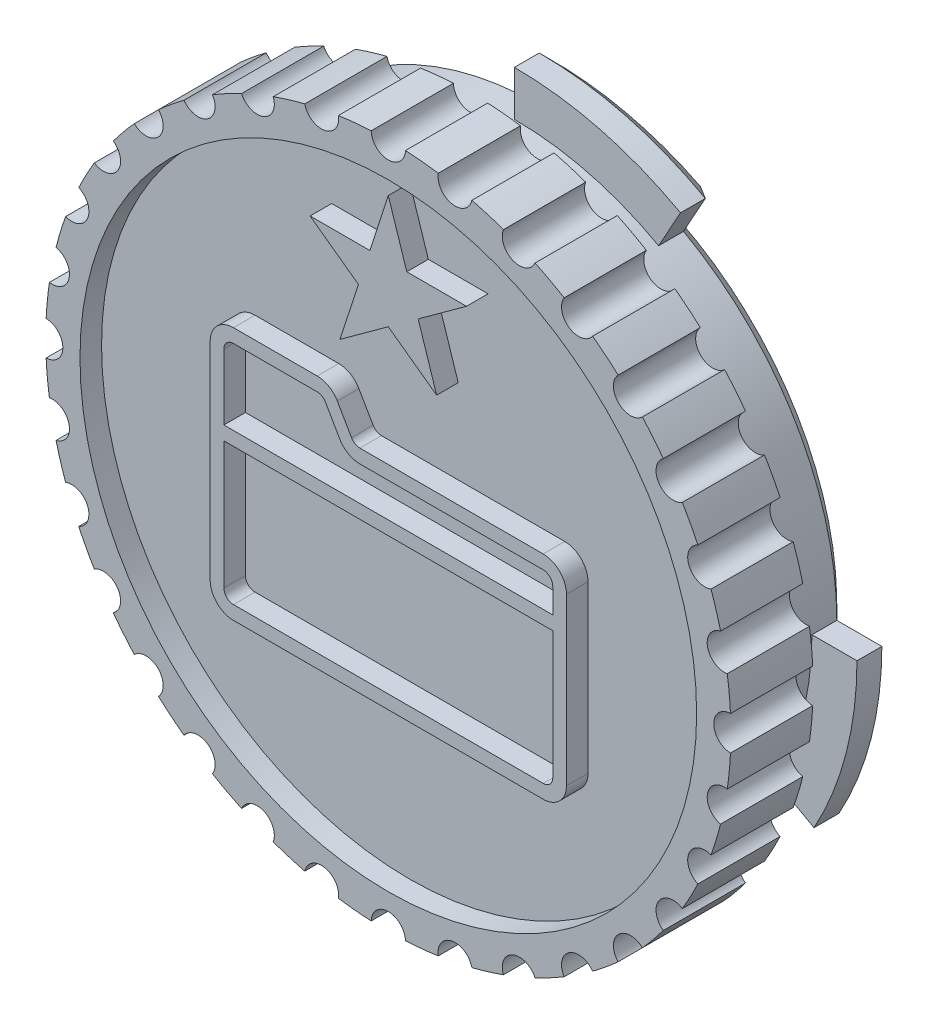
ISO-10303-21;
HEADER;
FILE_DESCRIPTION(('STEP AP214'),'2;1');
FILE_NAME('part.step','',(''),(''),'','','');
FILE_SCHEMA(('AUTOMOTIVE_DESIGN { 1 0 10303 214 1 1 1 1 }'));
ENDSEC;
DATA;
#1=APPLICATION_CONTEXT('core data for automotive mechanical design processes');
#2=APPLICATION_PROTOCOL_DEFINITION('international standard','automotive_design',2000,#1);
#3=PRODUCT_CONTEXT('',#1,'mechanical');
#4=PRODUCT('Part','Part','',(#3));
#5=PRODUCT_RELATED_PRODUCT_CATEGORY('part','',(#4));
#6=PRODUCT_DEFINITION_FORMATION('','',#4);
#7=PRODUCT_DEFINITION_CONTEXT('part definition',#1,'design');
#8=PRODUCT_DEFINITION('design','',#6,#7);
#9=PRODUCT_DEFINITION_SHAPE('','',#8);
#10=(LENGTH_UNIT() NAMED_UNIT(*) SI_UNIT(.MILLI.,.METRE.));
#11=(NAMED_UNIT(*) PLANE_ANGLE_UNIT() SI_UNIT($,.RADIAN.));
#12=(NAMED_UNIT(*) SI_UNIT($,.STERADIAN.) SOLID_ANGLE_UNIT());
#13=UNCERTAINTY_MEASURE_WITH_UNIT(LENGTH_MEASURE(1.E-05),#10,'distance_accuracy_value','');
#14=(GEOMETRIC_REPRESENTATION_CONTEXT(3) GLOBAL_UNCERTAINTY_ASSIGNED_CONTEXT((#13)) GLOBAL_UNIT_ASSIGNED_CONTEXT((#10,
#11,#12)) REPRESENTATION_CONTEXT('',''));
#15=CARTESIAN_POINT('',(0.,0.,0.));
#16=DIRECTION('',(0.,0.,1.));
#17=DIRECTION('',(1.,0.,0.));
#18=AXIS2_PLACEMENT_3D('',#15,#16,#17);
#19=CARTESIAN_POINT('',(0.,0.,6.62));
#20=DIRECTION('',(0.,0.,1.));
#21=DIRECTION('',(1.,0.,0.));
#22=AXIS2_PLACEMENT_3D('',#19,#20,#21);
#23=PLANE('',#22);
#24=CARTESIAN_POINT('',(-7.1755,-5.9055,6.62));
#25=DIRECTION('',(0.,0.,1.));
#26=DIRECTION('',(1.,0.,0.));
#27=AXIS2_PLACEMENT_3D('',#24,#25,#26);
#28=CIRCLE('',#27,1.0795);
#29=CARTESIAN_POINT('',(-8.255,-5.9055,6.62));
#30=VERTEX_POINT('',#29);
#31=CARTESIAN_POINT('',(-7.1755,-6.985,6.62));
#32=VERTEX_POINT('',#31);
#33=EDGE_CURVE('E1057',#30,#32,#28,.T.);
#34=ORIENTED_EDGE('',*,*,#33,.F.);
#35=DIRECTION('',(0.,-1.,0.));
#36=VECTOR('',#35,1.);
#37=CARTESIAN_POINT('',(-8.255,1.27,6.62));
#38=LINE('',#37,#36);
#39=CARTESIAN_POINT('',(-8.255,3.683,6.62));
#40=VERTEX_POINT('',#39);
#41=EDGE_CURVE('E1016',#40,#30,#38,.T.);
#42=ORIENTED_EDGE('',*,*,#41,.F.);
#43=CARTESIAN_POINT('',(-7.1755,3.683,6.62));
#44=DIRECTION('',(0.,0.,1.));
#45=DIRECTION('',(-1.,0.,0.));
#46=AXIS2_PLACEMENT_3D('',#43,#44,#45);
#47=CIRCLE('',#46,1.0795);
#48=CARTESIAN_POINT('',(-7.1755,4.7625,6.62));
#49=VERTEX_POINT('',#48);
#50=EDGE_CURVE('E1021',#49,#40,#47,.T.);
#51=ORIENTED_EDGE('',*,*,#50,.F.);
#52=DIRECTION('',(-1.,0.,0.));
#53=VECTOR('',#52,1.);
#54=CARTESIAN_POINT('',(-7.1755,4.7625,6.62));
#55=LINE('',#54,#53);
#56=CARTESIAN_POINT('',(-3.2974409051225,4.7625,6.62));
#57=VERTEX_POINT('',#56);
#58=EDGE_CURVE('E1084',#57,#49,#55,.T.);
#59=ORIENTED_EDGE('',*,*,#58,.F.);
#60=CARTESIAN_POINT('',(-3.2974409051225,3.683,6.62));
#61=DIRECTION('',(0.,0.,1.));
#62=DIRECTION('',(-1.,0.,0.));
#63=AXIS2_PLACEMENT_3D('',#60,#61,#62);
#64=CIRCLE('',#63,1.0795);
#65=CARTESIAN_POINT('',(-2.3625664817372,4.22275,6.62));
#66=VERTEX_POINT('',#65);
#67=EDGE_CURVE('E1081',#66,#57,#64,.T.);
#68=ORIENTED_EDGE('',*,*,#67,.F.);
#69=DIRECTION('',(-0.499999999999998,0.86602540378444,0.));
#70=VECTOR('',#69,1.);
#71=CARTESIAN_POINT('',(-2.3625664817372,4.22275,6.62));
#72=LINE('',#71,#70);
#73=CARTESIAN_POINT('',(-1.70265512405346,3.07975,6.62));
#74=VERTEX_POINT('',#73);
#75=EDGE_CURVE('E1078',#74,#66,#72,.T.);
#76=ORIENTED_EDGE('',*,*,#75,.F.);
#77=CARTESIAN_POINT('',(-1.31770683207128,3.302,6.62));
#78=DIRECTION('',(0.,0.,-1.));
#79=DIRECTION('',(1.,0.,0.));
#80=AXIS2_PLACEMENT_3D('',#77,#78,#79);
#81=CIRCLE('',#80,0.4445);
#82=CARTESIAN_POINT('',(-1.31770683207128,2.8575,6.62));
#83=VERTEX_POINT('',#82);
#84=EDGE_CURVE('E1075',#83,#74,#81,.T.);
#85=ORIENTED_EDGE('',*,*,#84,.F.);
#86=DIRECTION('',(-1.,0.,0.));
#87=VECTOR('',#86,1.);
#88=CARTESIAN_POINT('',(-1.31770683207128,2.8575,6.62));
#89=LINE('',#88,#87);
#90=CARTESIAN_POINT('',(7.1755,2.8575,6.62));
#91=VERTEX_POINT('',#90);
#92=EDGE_CURVE('E1072',#91,#83,#89,.T.);
#93=ORIENTED_EDGE('',*,*,#92,.F.);
#94=CARTESIAN_POINT('',(7.1755,1.778,6.62));
#95=DIRECTION('',(0.,0.,1.));
#96=DIRECTION('',(-1.,0.,0.));
#97=AXIS2_PLACEMENT_3D('',#94,#95,#96);
#98=CIRCLE('',#97,1.0795);
#99=CARTESIAN_POINT('',(8.255,1.778,6.62));
#100=VERTEX_POINT('',#99);
#101=EDGE_CURVE('E1069',#100,#91,#98,.T.);
#102=ORIENTED_EDGE('',*,*,#101,.F.);
#103=DIRECTION('',(0.,1.,0.));
#104=VECTOR('',#103,1.);
#105=CARTESIAN_POINT('',(8.255,1.778,6.62));
#106=LINE('',#105,#104);
#107=CARTESIAN_POINT('',(8.255,-5.9055,6.62));
#108=VERTEX_POINT('',#107);
#109=EDGE_CURVE('E1066',#108,#100,#106,.T.);
#110=ORIENTED_EDGE('',*,*,#109,.F.);
#111=CARTESIAN_POINT('',(7.1755,-5.9055,6.62));
#112=DIRECTION('',(0.,0.,1.));
#113=DIRECTION('',(1.,0.,0.));
#114=AXIS2_PLACEMENT_3D('',#111,#112,#113);
#115=CIRCLE('',#114,1.0795);
#116=CARTESIAN_POINT('',(7.1755,-6.985,6.62));
#117=VERTEX_POINT('',#116);
#118=EDGE_CURVE('E1063',#117,#108,#115,.T.);
#119=ORIENTED_EDGE('',*,*,#118,.F.);
#120=DIRECTION('',(1.,0.,0.));
#121=VECTOR('',#120,1.);
#122=CARTESIAN_POINT('',(-7.1755,-6.985,6.62));
#123=LINE('',#122,#121);
#124=EDGE_CURVE('E1060',#32,#117,#123,.T.);
#125=ORIENTED_EDGE('',*,*,#124,.F.);
#126=EDGE_LOOP('',(#34,#42,#51,#59,#68,#76,#85,#93,#102,#110,#119,#125));
#127=FACE_BOUND('',#126,.T.);
#128=CARTESIAN_POINT('',(0.,0.,6.62));
#129=DIRECTION('',(0.,0.,1.));
#130=DIRECTION('',(1.,0.,0.));
#131=AXIS2_PLACEMENT_3D('',#128,#129,#130);
#132=CIRCLE('',#131,14.2875);
#133=CARTESIAN_POINT('',(14.2875,0.,6.62));
#134=VERTEX_POINT('',#133);
#135=EDGE_CURVE('E1239',#134,#134,#132,.T.);
#136=ORIENTED_EDGE('',*,*,#135,.T.);
#137=EDGE_LOOP('',(#136));
#138=FACE_BOUND('',#137,.T.);
#139=DIRECTION('',(-0.309016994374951,0.951056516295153,0.));
#140=VECTOR('',#139,1.);
#141=CARTESIAN_POINT('',(0.,13.6525,6.62));
#142=LINE('',#141,#140);
#143=CARTESIAN_POINT('',(0.855398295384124,11.0198547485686,6.62));
#144=VERTEX_POINT('',#143);
#145=CARTESIAN_POINT('',(0.,13.6525,6.62));
#146=VERTEX_POINT('',#145);
#147=EDGE_CURVE('E2778',#144,#146,#142,.T.);
#148=ORIENTED_EDGE('',*,*,#147,.F.);
#149=DIRECTION('',(-1.,0.,0.));
#150=VECTOR('',#149,1.);
#151=CARTESIAN_POINT('',(0.855398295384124,11.0198547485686,6.62));
#152=LINE('',#151,#150);
#153=CARTESIAN_POINT('',(3.62352532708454,11.0198547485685,6.62));
#154=VERTEX_POINT('',#153);
#155=EDGE_CURVE('E2780',#154,#144,#152,.T.);
#156=ORIENTED_EDGE('',*,*,#155,.F.);
#157=DIRECTION('',(0.809016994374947,0.587785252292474,0.));
#158=VECTOR('',#157,1.);
#159=CARTESIAN_POINT('',(3.62352532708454,11.0198547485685,6.62));
#160=LINE('',#159,#158);
#161=CARTESIAN_POINT('',(1.38406351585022,9.39279050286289,6.62));
#162=VERTEX_POINT('',#161);
#163=EDGE_CURVE('E2797',#162,#154,#160,.T.);
#164=ORIENTED_EDGE('',*,*,#163,.F.);
#165=DIRECTION('',(-0.309016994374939,0.951056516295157,0.));
#166=VECTOR('',#165,1.);
#167=CARTESIAN_POINT('',(1.38406351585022,9.39279050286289,6.62));
#168=LINE('',#167,#166);
#169=CARTESIAN_POINT('',(2.23946181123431,6.76014525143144,6.62));
#170=VERTEX_POINT('',#169);
#171=EDGE_CURVE('E2812',#170,#162,#168,.T.);
#172=ORIENTED_EDGE('',*,*,#171,.F.);
#173=DIRECTION('',(0.809016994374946,-0.587785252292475,0.));
#174=VECTOR('',#173,1.);
#175=CARTESIAN_POINT('',(2.23946181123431,6.76014525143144,6.62));
#176=LINE('',#175,#174);
#177=CARTESIAN_POINT('',(0.,8.38720949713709,6.62));
#178=VERTEX_POINT('',#177);
#179=EDGE_CURVE('E2817',#178,#170,#176,.T.);
#180=ORIENTED_EDGE('',*,*,#179,.F.);
#181=DIRECTION('',(0.809016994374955,0.587785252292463,0.));
#182=VECTOR('',#181,1.);
#183=CARTESIAN_POINT('',(0.,8.38720949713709,6.62));
#184=LINE('',#183,#182);
#185=CARTESIAN_POINT('',(-2.23946181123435,6.76014525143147,6.62));
#186=VERTEX_POINT('',#185);
#187=EDGE_CURVE('E2833',#186,#178,#184,.T.);
#188=ORIENTED_EDGE('',*,*,#187,.F.);
#189=DIRECTION('',(-0.309016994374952,-0.951056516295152,0.));
#190=VECTOR('',#189,1.);
#191=CARTESIAN_POINT('',(-2.23946181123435,6.76014525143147,6.62));
#192=LINE('',#191,#190);
#193=CARTESIAN_POINT('',(-1.38406351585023,9.39279050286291,6.62));
#194=VERTEX_POINT('',#193);
#195=EDGE_CURVE('E2838',#194,#186,#192,.T.);
#196=ORIENTED_EDGE('',*,*,#195,.F.);
#197=DIRECTION('',(0.809016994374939,-0.587785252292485,0.));
#198=VECTOR('',#197,1.);
#199=CARTESIAN_POINT('',(-1.38406351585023,9.39279050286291,6.62));
#200=LINE('',#199,#198);
#201=CARTESIAN_POINT('',(-3.62352532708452,11.0198547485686,6.62));
#202=VERTEX_POINT('',#201);
#203=EDGE_CURVE('E834',#202,#194,#200,.T.);
#204=ORIENTED_EDGE('',*,*,#203,.F.);
#205=DIRECTION('',(-1.,0.,0.));
#206=VECTOR('',#205,1.);
#207=CARTESIAN_POINT('',(-3.62352532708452,11.0198547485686,6.62));
#208=LINE('',#207,#206);
#209=CARTESIAN_POINT('',(-0.855398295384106,11.0198547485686,6.62));
#210=VERTEX_POINT('',#209);
#211=EDGE_CURVE('E2851',#210,#202,#208,.T.);
#212=ORIENTED_EDGE('',*,*,#211,.F.);
#213=DIRECTION('',(-0.309016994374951,-0.951056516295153,0.));
#214=VECTOR('',#213,1.);
#215=CARTESIAN_POINT('',(-0.855398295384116,11.0198547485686,6.62));
#216=LINE('',#215,#214);
#217=EDGE_CURVE('E849',#146,#210,#216,.T.);
#218=ORIENTED_EDGE('',*,*,#217,.F.);
#219=EDGE_LOOP('',(#148,#156,#164,#172,#180,#188,#196,#204,#212,#218));
#220=FACE_BOUND('',#219,.T.);
#221=ADVANCED_FACE('F41',(#127,#138,#220),#23,.T.);
#222=CARTESIAN_POINT('',(-7.62,1.27,7.62));
#223=DIRECTION('',(1.,0.,0.));
#224=DIRECTION('',(0.,0.,-1.));
#225=AXIS2_PLACEMENT_3D('',#222,#223,#224);
#226=PLANE('',#225);
#227=DIRECTION('',(0.,-1.,0.));
#228=VECTOR('',#227,1.);
#229=CARTESIAN_POINT('',(-7.62,1.27,7.62));
#230=LINE('',#229,#228);
#231=CARTESIAN_POINT('',(-7.62,3.683,7.62));
#232=VERTEX_POINT('',#231);
#233=CARTESIAN_POINT('',(-7.61999999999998,0.634999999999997,7.62));
#234=VERTEX_POINT('',#233);
#235=EDGE_CURVE('E888',#232,#234,#230,.T.);
#236=ORIENTED_EDGE('',*,*,#235,.T.);
#237=DIRECTION('',(0.,0.,-1.));
#238=VECTOR('',#237,1.);
#239=CARTESIAN_POINT('',(-7.61999999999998,0.634999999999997,22.8732234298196));
#240=LINE('',#239,#238);
#241=CARTESIAN_POINT('',(-7.61999999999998,0.634999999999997,6.62));
#242=VERTEX_POINT('',#241);
#243=EDGE_CURVE('E873',#234,#242,#240,.T.);
#244=ORIENTED_EDGE('',*,*,#243,.T.);
#245=DIRECTION('',(0.,-1.,0.));
#246=VECTOR('',#245,1.);
#247=CARTESIAN_POINT('',(-7.62,1.27,6.62));
#248=LINE('',#247,#246);
#249=CARTESIAN_POINT('',(-7.62,3.683,6.62));
#250=VERTEX_POINT('',#249);
#251=EDGE_CURVE('E930',#250,#242,#248,.T.);
#252=ORIENTED_EDGE('',*,*,#251,.F.);
#253=DIRECTION('',(0.,0.,-1.));
#254=VECTOR('',#253,1.);
#255=CARTESIAN_POINT('',(-7.62,3.683,7.62));
#256=LINE('',#255,#254);
#257=EDGE_CURVE('E929',#232,#250,#256,.T.);
#258=ORIENTED_EDGE('',*,*,#257,.F.);
#259=EDGE_LOOP('',(#236,#244,#252,#258));
#260=FACE_BOUND('',#259,.T.);
#261=ADVANCED_FACE('F2239',(#260),#226,.T.);
#262=CARTESIAN_POINT('',(-7.62,0.,6.62));
#263=VERTEX_POINT('',#262);
#264=CARTESIAN_POINT('',(-7.62,-5.9055,6.62));
#265=VERTEX_POINT('',#264);
#266=EDGE_CURVE('E866',#263,#265,#248,.T.);
#267=ORIENTED_EDGE('',*,*,#266,.F.);
#268=DIRECTION('',(0.,0.,-1.));
#269=VECTOR('',#268,1.);
#270=CARTESIAN_POINT('',(-7.61999999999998,0.,22.8732234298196));
#271=LINE('',#270,#269);
#272=CARTESIAN_POINT('',(-7.61999999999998,0.,7.62));
#273=VERTEX_POINT('',#272);
#274=EDGE_CURVE('E64',#273,#263,#271,.T.);
#275=ORIENTED_EDGE('',*,*,#274,.F.);
#276=CARTESIAN_POINT('',(-7.62,-5.9055,7.62));
#277=VERTEX_POINT('',#276);
#278=EDGE_CURVE('E893',#273,#277,#230,.T.);
#279=ORIENTED_EDGE('',*,*,#278,.T.);
#280=DIRECTION('',(0.,0.,-1.));
#281=VECTOR('',#280,1.);
#282=CARTESIAN_POINT('',(-7.62,-5.9055,7.62));
#283=LINE('',#282,#281);
#284=EDGE_CURVE('E1012',#277,#265,#283,.T.);
#285=ORIENTED_EDGE('',*,*,#284,.T.);
#286=EDGE_LOOP('',(#267,#275,#279,#285));
#287=FACE_BOUND('',#286,.T.);
#288=ADVANCED_FACE('F2200',(#287),#226,.T.);
#289=CARTESIAN_POINT('',(7.62,1.778,7.62));
#290=DIRECTION('',(-1.,0.,0.));
#291=DIRECTION('',(0.,-1.,0.));
#292=AXIS2_PLACEMENT_3D('',#289,#290,#291);
#293=PLANE('',#292);
#294=DIRECTION('',(0.,1.,0.));
#295=VECTOR('',#294,1.);
#296=CARTESIAN_POINT('',(7.62,1.778,6.62));
#297=LINE('',#296,#295);
#298=CARTESIAN_POINT('',(7.61999999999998,0.635,6.62));
#299=VERTEX_POINT('',#298);
#300=CARTESIAN_POINT('',(7.62,1.778,6.62));
#301=VERTEX_POINT('',#300);
#302=EDGE_CURVE('E943',#299,#301,#297,.T.);
#303=ORIENTED_EDGE('',*,*,#302,.F.);
#304=DIRECTION('',(0.,0.,-1.));
#305=VECTOR('',#304,1.);
#306=CARTESIAN_POINT('',(7.61999999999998,0.635,22.8732234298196));
#307=LINE('',#306,#305);
#308=CARTESIAN_POINT('',(7.61999999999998,0.635,7.62));
#309=VERTEX_POINT('',#308);
#310=EDGE_CURVE('E877',#309,#299,#307,.T.);
#311=ORIENTED_EDGE('',*,*,#310,.F.);
#312=DIRECTION('',(0.,1.,0.));
#313=VECTOR('',#312,1.);
#314=CARTESIAN_POINT('',(7.62,-5.9055,7.62));
#315=LINE('',#314,#313);
#316=CARTESIAN_POINT('',(7.62,1.778,7.62));
#317=VERTEX_POINT('',#316);
#318=EDGE_CURVE('E902',#309,#317,#315,.T.);
#319=ORIENTED_EDGE('',*,*,#318,.T.);
#320=DIRECTION('',(0.,0.,-1.));
#321=VECTOR('',#320,1.);
#322=CARTESIAN_POINT('',(7.62,1.778,7.62));
#323=LINE('',#322,#321);
#324=EDGE_CURVE('E996',#317,#301,#323,.T.);
#325=ORIENTED_EDGE('',*,*,#324,.T.);
#326=EDGE_LOOP('',(#303,#311,#319,#325));
#327=FACE_BOUND('',#326,.T.);
#328=ADVANCED_FACE('F2994',(#327),#293,.T.);
#329=CARTESIAN_POINT('',(7.62,-5.9055,7.62));
#330=VERTEX_POINT('',#329);
#331=CARTESIAN_POINT('',(7.61999999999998,0.,7.62));
#332=VERTEX_POINT('',#331);
#333=EDGE_CURVE('E903',#330,#332,#315,.T.);
#334=ORIENTED_EDGE('',*,*,#333,.T.);
#335=DIRECTION('',(0.,0.,-1.));
#336=VECTOR('',#335,1.);
#337=CARTESIAN_POINT('',(7.61999999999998,0.,22.8732234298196));
#338=LINE('',#337,#336);
#339=CARTESIAN_POINT('',(7.61999999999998,0.,6.62));
#340=VERTEX_POINT('',#339);
#341=EDGE_CURVE('E880',#332,#340,#338,.T.);
#342=ORIENTED_EDGE('',*,*,#341,.T.);
#343=CARTESIAN_POINT('',(7.61999999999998,-5.9055,6.62));
#344=VERTEX_POINT('',#343);
#345=EDGE_CURVE('E944',#344,#340,#297,.T.);
#346=ORIENTED_EDGE('',*,*,#345,.F.);
#347=DIRECTION('',(0.,0.,-1.));
#348=VECTOR('',#347,1.);
#349=CARTESIAN_POINT('',(7.62,-5.9055,7.62));
#350=LINE('',#349,#348);
#351=EDGE_CURVE('E1000',#330,#344,#350,.T.);
#352=ORIENTED_EDGE('',*,*,#351,.F.);
#353=EDGE_LOOP('',(#334,#342,#346,#352));
#354=FACE_BOUND('',#353,.T.);
#355=ADVANCED_FACE('F2216',(#354),#293,.T.);
#356=ORIENTED_EDGE('',*,*,#251,.T.);
#357=DIRECTION('',(-1.,0.,0.));
#358=VECTOR('',#357,1.);
#359=CARTESIAN_POINT('',(-7.61999999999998,0.634999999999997,6.62));
#360=LINE('',#359,#358);
#361=EDGE_CURVE('E870',#299,#242,#360,.T.);
#362=ORIENTED_EDGE('',*,*,#361,.F.);
#363=ORIENTED_EDGE('',*,*,#302,.T.);
#364=CARTESIAN_POINT('',(7.1755,1.778,6.62));
#365=DIRECTION('',(0.,0.,1.));
#366=DIRECTION('',(-1.,0.,0.));
#367=AXIS2_PLACEMENT_3D('',#364,#365,#366);
#368=CIRCLE('',#367,0.4445);
#369=CARTESIAN_POINT('',(7.1755,2.2225,6.62));
#370=VERTEX_POINT('',#369);
#371=EDGE_CURVE('E948',#301,#370,#368,.T.);
#372=ORIENTED_EDGE('',*,*,#371,.T.);
#373=DIRECTION('',(-1.,0.,0.));
#374=VECTOR('',#373,1.);
#375=CARTESIAN_POINT('',(-1.31770683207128,2.2225,6.62));
#376=LINE('',#375,#374);
#377=CARTESIAN_POINT('',(-1.31770683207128,2.2225,6.62));
#378=VERTEX_POINT('',#377);
#379=EDGE_CURVE('E951',#370,#378,#376,.T.);
#380=ORIENTED_EDGE('',*,*,#379,.T.);
#381=CARTESIAN_POINT('',(-1.31770683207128,3.302,6.62));
#382=DIRECTION('',(0.,0.,-1.));
#383=DIRECTION('',(1.,0.,0.));
#384=AXIS2_PLACEMENT_3D('',#381,#382,#383);
#385=CIRCLE('',#384,1.0795);
#386=CARTESIAN_POINT('',(-2.25258125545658,2.76225000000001,6.62));
#387=VERTEX_POINT('',#386);
#388=EDGE_CURVE('E954',#378,#387,#385,.T.);
#389=ORIENTED_EDGE('',*,*,#388,.T.);
#390=DIRECTION('',(-0.499999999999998,0.86602540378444,0.));
#391=VECTOR('',#390,1.);
#392=CARTESIAN_POINT('',(-2.91249261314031,3.90525,6.62));
#393=LINE('',#392,#391);
#394=CARTESIAN_POINT('',(-2.91249261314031,3.90525,6.62));
#395=VERTEX_POINT('',#394);
#396=EDGE_CURVE('E957',#387,#395,#393,.T.);
#397=ORIENTED_EDGE('',*,*,#396,.T.);
#398=CARTESIAN_POINT('',(-3.2974409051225,3.683,6.62));
#399=DIRECTION('',(0.,0.,1.));
#400=DIRECTION('',(-1.,0.,0.));
#401=AXIS2_PLACEMENT_3D('',#398,#399,#400);
#402=CIRCLE('',#401,0.4445);
#403=CARTESIAN_POINT('',(-3.2974409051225,4.1275,6.62));
#404=VERTEX_POINT('',#403);
#405=EDGE_CURVE('E960',#395,#404,#402,.T.);
#406=ORIENTED_EDGE('',*,*,#405,.T.);
#407=DIRECTION('',(-1.,0.,0.));
#408=VECTOR('',#407,1.);
#409=CARTESIAN_POINT('',(-7.1755,4.1275,6.62));
#410=LINE('',#409,#408);
#411=CARTESIAN_POINT('',(-7.1755,4.1275,6.62));
#412=VERTEX_POINT('',#411);
#413=EDGE_CURVE('E963',#404,#412,#410,.T.);
#414=ORIENTED_EDGE('',*,*,#413,.T.);
#415=CARTESIAN_POINT('',(-7.1755,3.683,6.62));
#416=DIRECTION('',(0.,0.,1.));
#417=DIRECTION('',(-1.,0.,0.));
#418=AXIS2_PLACEMENT_3D('',#415,#416,#417);
#419=CIRCLE('',#418,0.4445);
#420=EDGE_CURVE('E966',#412,#250,#419,.T.);
#421=ORIENTED_EDGE('',*,*,#420,.T.);
#422=EDGE_LOOP('',(#356,#362,#363,#372,#380,#389,#397,#406,#414,#421));
#423=FACE_BOUND('',#422,.T.);
#424=ADVANCED_FACE('F2242',(#423),#23,.T.);
#425=ORIENTED_EDGE('',*,*,#345,.T.);
#426=DIRECTION('',(1.,0.,0.));
#427=VECTOR('',#426,1.);
#428=CARTESIAN_POINT('',(-7.61999999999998,0.,6.62));
#429=LINE('',#428,#427);
#430=EDGE_CURVE('E862',#263,#340,#429,.T.);
#431=ORIENTED_EDGE('',*,*,#430,.F.);
#432=ORIENTED_EDGE('',*,*,#266,.T.);
#433=CARTESIAN_POINT('',(-7.1755,-5.9055,6.62));
#434=DIRECTION('',(0.,0.,1.));
#435=DIRECTION('',(1.,0.,0.));
#436=AXIS2_PLACEMENT_3D('',#433,#434,#435);
#437=CIRCLE('',#436,0.4445);
#438=CARTESIAN_POINT('',(-7.1755,-6.35,6.62));
#439=VERTEX_POINT('',#438);
#440=EDGE_CURVE('E934',#265,#439,#437,.T.);
#441=ORIENTED_EDGE('',*,*,#440,.T.);
#442=DIRECTION('',(1.,0.,0.));
#443=VECTOR('',#442,1.);
#444=CARTESIAN_POINT('',(-7.1755,-6.35,6.62));
#445=LINE('',#444,#443);
#446=CARTESIAN_POINT('',(7.1755,-6.35,6.62));
#447=VERTEX_POINT('',#446);
#448=EDGE_CURVE('E937',#439,#447,#445,.T.);
#449=ORIENTED_EDGE('',*,*,#448,.T.);
#450=CARTESIAN_POINT('',(7.1755,-5.9055,6.62));
#451=DIRECTION('',(0.,0.,1.));
#452=DIRECTION('',(1.,0.,0.));
#453=AXIS2_PLACEMENT_3D('',#450,#451,#452);
#454=CIRCLE('',#453,0.4445);
#455=EDGE_CURVE('E940',#447,#344,#454,.T.);
#456=ORIENTED_EDGE('',*,*,#455,.T.);
#457=EDGE_LOOP('',(#425,#431,#432,#441,#449,#456));
#458=FACE_BOUND('',#457,.T.);
#459=ADVANCED_FACE('F2196',(#458),#23,.T.);
#460=CARTESIAN_POINT('',(0.,0.,7.62));
#461=DIRECTION('',(0.,0.,-1.));
#462=DIRECTION('',(-1.,0.,0.));
#463=AXIS2_PLACEMENT_3D('',#460,#461,#462);
#464=CYLINDRICAL_SURFACE('',#463,15.875);
#465=CARTESIAN_POINT('',(0.,0.,3.81));
#466=DIRECTION('',(0.,0.,1.));
#467=DIRECTION('',(1.,0.,0.));
#468=AXIS2_PLACEMENT_3D('',#465,#466,#467);
#469=CIRCLE('',#468,15.875);
#470=CARTESIAN_POINT('',(-0.793501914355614,15.85515625,3.81));
#471=VERTEX_POINT('',#470);
#472=CARTESIAN_POINT('',(-2.31493254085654,15.7053084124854,3.81));
#473=VERTEX_POINT('',#472);
#474=EDGE_CURVE('E1623',#471,#473,#469,.T.);
#475=ORIENTED_EDGE('',*,*,#474,.T.);
#476=DIRECTION('',(0.,0.,1.));
#477=VECTOR('',#476,1.);
#478=CARTESIAN_POINT('',(-2.31493254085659,15.7053084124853,3.810006));
#479=LINE('',#478,#477);
#480=CARTESIAN_POINT('',(-2.3149325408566,15.7053084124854,7.62));
#481=VERTEX_POINT('',#480);
#482=EDGE_CURVE('E1245',#473,#481,#479,.T.);
#483=ORIENTED_EDGE('',*,*,#482,.T.);
#484=CARTESIAN_POINT('',(0.,0.,7.62));
#485=DIRECTION('',(0.,0.,1.));
#486=DIRECTION('',(1.,0.,0.));
#487=AXIS2_PLACEMENT_3D('',#484,#485,#486);
#488=CIRCLE('',#487,15.875);
#489=CARTESIAN_POINT('',(-0.79350191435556,15.85515625,7.62));
#490=VERTEX_POINT('',#489);
#491=EDGE_CURVE('E1656',#490,#481,#488,.T.);
#492=ORIENTED_EDGE('',*,*,#491,.F.);
#493=DIRECTION('',(0.,0.,1.));
#494=VECTOR('',#493,1.);
#495=CARTESIAN_POINT('',(-0.793501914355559,15.85515625,3.810006));
#496=LINE('',#495,#494);
#497=EDGE_CURVE('E1240',#490,#471,#496,.F.);
#498=ORIENTED_EDGE('',*,*,#497,.T.);
#499=EDGE_LOOP('',(#475,#483,#492,#498));
#500=FACE_BOUND('',#499,.T.);
#501=ADVANCED_FACE('F2256',(#500),#464,.T.);
#502=CARTESIAN_POINT('',(-3.87144253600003,15.3956993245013,7.62));
#503=VERTEX_POINT('',#502);
#504=CARTESIAN_POINT('',(-5.33440543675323,14.9519143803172,7.62));
#505=VERTEX_POINT('',#504);
#506=EDGE_CURVE('E1250',#503,#505,#488,.T.);
#507=ORIENTED_EDGE('',*,*,#506,.F.);
#508=DIRECTION('',(0.,0.,1.));
#509=VECTOR('',#508,1.);
#510=CARTESIAN_POINT('',(-3.87144253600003,15.3956993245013,3.810006));
#511=LINE('',#510,#509);
#512=CARTESIAN_POINT('',(-3.87144253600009,15.3956993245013,3.81));
#513=VERTEX_POINT('',#512);
#514=EDGE_CURVE('E1244',#503,#513,#511,.F.);
#515=ORIENTED_EDGE('',*,*,#514,.T.);
#516=CARTESIAN_POINT('',(-5.33440543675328,14.9519143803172,3.81));
#517=VERTEX_POINT('',#516);
#518=EDGE_CURVE('E1613',#513,#517,#469,.T.);
#519=ORIENTED_EDGE('',*,*,#518,.T.);
#520=DIRECTION('',(0.,0.,1.));
#521=VECTOR('',#520,1.);
#522=CARTESIAN_POINT('',(-5.33440543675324,14.9519143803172,3.810006));
#523=LINE('',#522,#521);
#524=EDGE_CURVE('E1609',#517,#505,#523,.T.);
#525=ORIENTED_EDGE('',*,*,#524,.T.);
#526=EDGE_LOOP('',(#507,#515,#519,#525));
#527=FACE_BOUND('',#526,.T.);
#528=ADVANCED_FACE('F2261',(#527),#464,.T.);
#529=CARTESIAN_POINT('',(-6.80060579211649,14.3445943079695,7.62));
#530=VERTEX_POINT('',#529);
#531=CARTESIAN_POINT('',(-8.14888012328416,13.6239266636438,7.62));
#532=VERTEX_POINT('',#531);
#533=EDGE_CURVE('E2619',#530,#532,#488,.T.);
#534=ORIENTED_EDGE('',*,*,#533,.F.);
#535=DIRECTION('',(0.,0.,1.));
#536=VECTOR('',#535,1.);
#537=CARTESIAN_POINT('',(-6.80060579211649,14.3445943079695,3.810006));
#538=LINE('',#537,#536);
#539=CARTESIAN_POINT('',(-6.80060579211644,14.3445943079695,3.81));
#540=VERTEX_POINT('',#539);
#541=EDGE_CURVE('E1605',#530,#540,#538,.F.);
#542=ORIENTED_EDGE('',*,*,#541,.T.);
#543=CARTESIAN_POINT('',(-8.14888012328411,13.6239266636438,3.81));
#544=VERTEX_POINT('',#543);
#545=EDGE_CURVE('E1601',#540,#544,#469,.T.);
#546=ORIENTED_EDGE('',*,*,#545,.T.);
#547=DIRECTION('',(0.,0.,1.));
#548=VECTOR('',#547,1.);
#549=CARTESIAN_POINT('',(-8.14888012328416,13.6239266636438,3.810006));
#550=LINE('',#549,#548);
#551=EDGE_CURVE('E1597',#544,#532,#550,.T.);
#552=ORIENTED_EDGE('',*,*,#551,.T.);
#553=EDGE_LOOP('',(#534,#542,#546,#552));
#554=FACE_BOUND('',#553,.T.);
#555=ADVANCED_FACE('F2268',(#554),#464,.T.);
#556=CARTESIAN_POINT('',(-9.46842558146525,12.7422345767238,7.62));
#557=VERTEX_POINT('',#556);
#558=CARTESIAN_POINT('',(-10.6501979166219,11.7723790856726,7.62));
#559=VERTEX_POINT('',#558);
#560=EDGE_CURVE('E2613',#557,#559,#488,.T.);
#561=ORIENTED_EDGE('',*,*,#560,.F.);
#562=DIRECTION('',(0.,0.,1.));
#563=VECTOR('',#562,1.);
#564=CARTESIAN_POINT('',(-9.46842558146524,12.7422345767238,3.810006));
#565=LINE('',#564,#563);
#566=CARTESIAN_POINT('',(-9.46842558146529,12.7422345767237,3.81));
#567=VERTEX_POINT('',#566);
#568=EDGE_CURVE('E1593',#557,#567,#565,.F.);
#569=ORIENTED_EDGE('',*,*,#568,.T.);
#570=CARTESIAN_POINT('',(-10.6501979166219,11.7723790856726,3.81));
#571=VERTEX_POINT('',#570);
#572=EDGE_CURVE('E1589',#567,#571,#469,.T.);
#573=ORIENTED_EDGE('',*,*,#572,.T.);
#574=DIRECTION('',(0.,0.,1.));
#575=VECTOR('',#574,1.);
#576=CARTESIAN_POINT('',(-10.6501979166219,11.7723790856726,3.810006));
#577=LINE('',#576,#575);
#578=EDGE_CURVE('E1585',#571,#559,#577,.T.);
#579=ORIENTED_EDGE('',*,*,#578,.T.);
#580=EDGE_LOOP('',(#561,#569,#573,#579));
#581=FACE_BOUND('',#580,.T.);
#582=ADVANCED_FACE('F3818',(#581),#464,.T.);
#583=CARTESIAN_POINT('',(-11.7723790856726,10.6501979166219,7.62));
#584=VERTEX_POINT('',#583);
#585=CARTESIAN_POINT('',(-12.7422345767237,9.46842558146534,7.62));
#586=VERTEX_POINT('',#585);
#587=EDGE_CURVE('E2607',#584,#586,#488,.T.);
#588=ORIENTED_EDGE('',*,*,#587,.F.);
#589=DIRECTION('',(0.,0.,1.));
#590=VECTOR('',#589,1.);
#591=CARTESIAN_POINT('',(-11.7723790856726,10.6501979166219,3.810006));
#592=LINE('',#591,#590);
#593=CARTESIAN_POINT('',(-11.7723790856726,10.6501979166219,3.81));
#594=VERTEX_POINT('',#593);
#595=EDGE_CURVE('E1581',#584,#594,#592,.F.);
#596=ORIENTED_EDGE('',*,*,#595,.T.);
#597=CARTESIAN_POINT('',(-12.7422345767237,9.46842558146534,3.81));
#598=VERTEX_POINT('',#597);
#599=EDGE_CURVE('E1577',#594,#598,#469,.T.);
#600=ORIENTED_EDGE('',*,*,#599,.T.);
#601=DIRECTION('',(0.,0.,1.));
#602=VECTOR('',#601,1.);
#603=CARTESIAN_POINT('',(-12.7422345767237,9.46842558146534,3.810006));
#604=LINE('',#603,#602);
#605=EDGE_CURVE('E1573',#598,#586,#604,.T.);
#606=ORIENTED_EDGE('',*,*,#605,.T.);
#607=EDGE_LOOP('',(#588,#596,#600,#606));
#608=FACE_BOUND('',#607,.T.);
#609=ADVANCED_FACE('F2645',(#608),#464,.T.);
#610=CARTESIAN_POINT('',(-13.6239266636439,8.14888012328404,7.62));
#611=VERTEX_POINT('',#610);
#612=CARTESIAN_POINT('',(-14.3445943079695,6.80060579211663,7.62));
#613=VERTEX_POINT('',#612);
#614=EDGE_CURVE('E2601',#611,#613,#488,.T.);
#615=ORIENTED_EDGE('',*,*,#614,.F.);
#616=DIRECTION('',(0.,0.,1.));
#617=VECTOR('',#616,1.);
#618=CARTESIAN_POINT('',(-13.6239266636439,8.14888012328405,3.810006));
#619=LINE('',#618,#617);
#620=CARTESIAN_POINT('',(-13.6239266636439,8.14888012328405,3.81));
#621=VERTEX_POINT('',#620);
#622=EDGE_CURVE('E1569',#611,#621,#619,.F.);
#623=ORIENTED_EDGE('',*,*,#622,.T.);
#624=CARTESIAN_POINT('',(-14.3445943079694,6.80060579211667,3.81));
#625=VERTEX_POINT('',#624);
#626=EDGE_CURVE('E1565',#621,#625,#469,.T.);
#627=ORIENTED_EDGE('',*,*,#626,.T.);
#628=DIRECTION('',(0.,0.,1.));
#629=VECTOR('',#628,1.);
#630=CARTESIAN_POINT('',(-14.3445943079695,6.80060579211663,3.810006));
#631=LINE('',#630,#629);
#632=EDGE_CURVE('E1561',#625,#613,#631,.T.);
#633=ORIENTED_EDGE('',*,*,#632,.T.);
#634=EDGE_LOOP('',(#615,#623,#627,#633));
#635=FACE_BOUND('',#634,.T.);
#636=ADVANCED_FACE('F3803',(#635),#464,.T.);
#637=CARTESIAN_POINT('',(-14.9519143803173,5.33440543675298,7.62));
#638=VERTEX_POINT('',#637);
#639=CARTESIAN_POINT('',(-15.3956993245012,3.87144253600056,7.62));
#640=VERTEX_POINT('',#639);
#641=EDGE_CURVE('E2595',#638,#640,#488,.T.);
#642=ORIENTED_EDGE('',*,*,#641,.F.);
#643=DIRECTION('',(0.,0.,1.));
#644=VECTOR('',#643,1.);
#645=CARTESIAN_POINT('',(-14.9519143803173,5.33440543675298,3.810006));
#646=LINE('',#645,#644);
#647=CARTESIAN_POINT('',(-14.9519143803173,5.33440543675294,3.81));
#648=VERTEX_POINT('',#647);
#649=EDGE_CURVE('E1557',#638,#648,#646,.F.);
#650=ORIENTED_EDGE('',*,*,#649,.T.);
#651=CARTESIAN_POINT('',(-15.3956993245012,3.87144253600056,3.81));
#652=VERTEX_POINT('',#651);
#653=EDGE_CURVE('E1553',#648,#652,#469,.T.);
#654=ORIENTED_EDGE('',*,*,#653,.T.);
#655=DIRECTION('',(0.,0.,1.));
#656=VECTOR('',#655,1.);
#657=CARTESIAN_POINT('',(-15.3956993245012,3.87144253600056,3.810006));
#658=LINE('',#657,#656);
#659=EDGE_CURVE('E1549',#652,#640,#658,.T.);
#660=ORIENTED_EDGE('',*,*,#659,.T.);
#661=EDGE_LOOP('',(#642,#650,#654,#660));
#662=FACE_BOUND('',#661,.T.);
#663=ADVANCED_FACE('F2650',(#662),#464,.T.);
#664=CARTESIAN_POINT('',(-15.7053084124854,2.31493254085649,7.62));
#665=VERTEX_POINT('',#664);
#666=CARTESIAN_POINT('',(-15.85515625,0.793501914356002,7.62));
#667=VERTEX_POINT('',#666);
#668=EDGE_CURVE('E2589',#665,#667,#488,.T.);
#669=ORIENTED_EDGE('',*,*,#668,.F.);
#670=DIRECTION('',(0.,0.,1.));
#671=VECTOR('',#670,1.);
#672=CARTESIAN_POINT('',(-15.7053084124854,2.31493254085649,3.810006));
#673=LINE('',#672,#671);
#674=CARTESIAN_POINT('',(-15.7053084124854,2.31493254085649,3.81));
#675=VERTEX_POINT('',#674);
#676=EDGE_CURVE('E1545',#665,#675,#673,.F.);
#677=ORIENTED_EDGE('',*,*,#676,.T.);
#678=CARTESIAN_POINT('',(-15.85515625,0.793501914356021,3.81));
#679=VERTEX_POINT('',#678);
#680=EDGE_CURVE('E1541',#675,#679,#469,.T.);
#681=ORIENTED_EDGE('',*,*,#680,.T.);
#682=DIRECTION('',(0.,0.,1.));
#683=VECTOR('',#682,1.);
#684=CARTESIAN_POINT('',(-15.85515625,0.793501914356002,3.810006));
#685=LINE('',#684,#683);
#686=EDGE_CURVE('E1537',#679,#667,#685,.T.);
#687=ORIENTED_EDGE('',*,*,#686,.T.);
#688=EDGE_LOOP('',(#669,#677,#681,#687));
#689=FACE_BOUND('',#688,.T.);
#690=ADVANCED_FACE('F3788',(#689),#464,.T.);
#691=CARTESIAN_POINT('',(-15.85515625,-0.79350191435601,7.62));
#692=VERTEX_POINT('',#691);
#693=CARTESIAN_POINT('',(-15.7053084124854,-2.31493254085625,7.62));
#694=VERTEX_POINT('',#693);
#695=EDGE_CURVE('E2583',#692,#694,#488,.T.);
#696=ORIENTED_EDGE('',*,*,#695,.F.);
#697=DIRECTION('',(0.,0.,1.));
#698=VECTOR('',#697,1.);
#699=CARTESIAN_POINT('',(-15.85515625,-0.793501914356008,3.810006));
#700=LINE('',#699,#698);
#701=CARTESIAN_POINT('',(-15.85515625,-0.793501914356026,3.81));
#702=VERTEX_POINT('',#701);
#703=EDGE_CURVE('E1533',#692,#702,#700,.F.);
#704=ORIENTED_EDGE('',*,*,#703,.T.);
#705=CARTESIAN_POINT('',(-15.7053084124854,-2.31493254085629,3.81));
#706=VERTEX_POINT('',#705);
#707=EDGE_CURVE('E1529',#702,#706,#469,.T.);
#708=ORIENTED_EDGE('',*,*,#707,.T.);
#709=DIRECTION('',(0.,0.,1.));
#710=VECTOR('',#709,1.);
#711=CARTESIAN_POINT('',(-15.7053084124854,-2.31493254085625,3.810006));
#712=LINE('',#711,#710);
#713=EDGE_CURVE('E1525',#706,#694,#712,.T.);
#714=ORIENTED_EDGE('',*,*,#713,.T.);
#715=EDGE_LOOP('',(#696,#704,#708,#714));
#716=FACE_BOUND('',#715,.T.);
#717=ADVANCED_FACE('F2655',(#716),#464,.T.);
#718=CARTESIAN_POINT('',(-15.3956993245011,-3.87144253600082,7.62));
#719=VERTEX_POINT('',#718);
#720=CARTESIAN_POINT('',(-14.9519143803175,-5.33440543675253,7.62));
#721=VERTEX_POINT('',#720);
#722=EDGE_CURVE('E2577',#719,#721,#488,.T.);
#723=ORIENTED_EDGE('',*,*,#722,.F.);
#724=DIRECTION('',(0.,0.,1.));
#725=VECTOR('',#724,1.);
#726=CARTESIAN_POINT('',(-15.3956993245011,-3.87144253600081,3.810006));
#727=LINE('',#726,#725);
#728=CARTESIAN_POINT('',(-15.3956993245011,-3.87144253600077,3.81));
#729=VERTEX_POINT('',#728);
#730=EDGE_CURVE('E1521',#719,#729,#727,.F.);
#731=ORIENTED_EDGE('',*,*,#730,.T.);
#732=CARTESIAN_POINT('',(-14.9519143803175,-5.33440543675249,3.81));
#733=VERTEX_POINT('',#732);
#734=EDGE_CURVE('E1517',#729,#733,#469,.T.);
#735=ORIENTED_EDGE('',*,*,#734,.T.);
#736=DIRECTION('',(0.,0.,1.));
#737=VECTOR('',#736,1.);
#738=CARTESIAN_POINT('',(-14.9519143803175,-5.33440543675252,3.810006));
#739=LINE('',#738,#737);
#740=EDGE_CURVE('E1513',#733,#721,#739,.T.);
#741=ORIENTED_EDGE('',*,*,#740,.T.);
#742=EDGE_LOOP('',(#723,#731,#735,#741));
#743=FACE_BOUND('',#742,.T.);
#744=ADVANCED_FACE('F3773',(#743),#464,.T.);
#745=CARTESIAN_POINT('',(-14.3445943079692,-6.80060579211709,7.62));
#746=VERTEX_POINT('',#745);
#747=CARTESIAN_POINT('',(-13.6239266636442,-8.14888012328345,7.62));
#748=VERTEX_POINT('',#747);
#749=EDGE_CURVE('E2571',#746,#748,#488,.T.);
#750=ORIENTED_EDGE('',*,*,#749,.F.);
#751=DIRECTION('',(0.,0.,1.));
#752=VECTOR('',#751,1.);
#753=CARTESIAN_POINT('',(-14.3445943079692,-6.80060579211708,3.810006));
#754=LINE('',#753,#752);
#755=CARTESIAN_POINT('',(-14.3445943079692,-6.80060579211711,3.81));
#756=VERTEX_POINT('',#755);
#757=EDGE_CURVE('E1509',#746,#756,#754,.F.);
#758=ORIENTED_EDGE('',*,*,#757,.T.);
#759=CARTESIAN_POINT('',(-13.6239266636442,-8.14888012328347,3.81));
#760=VERTEX_POINT('',#759);
#761=EDGE_CURVE('E1505',#756,#760,#469,.T.);
#762=ORIENTED_EDGE('',*,*,#761,.T.);
#763=DIRECTION('',(0.,0.,1.));
#764=VECTOR('',#763,1.);
#765=CARTESIAN_POINT('',(-13.6239266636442,-8.14888012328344,3.810006));
#766=LINE('',#765,#764);
#767=EDGE_CURVE('E1501',#760,#748,#766,.T.);
#768=ORIENTED_EDGE('',*,*,#767,.T.);
#769=EDGE_LOOP('',(#750,#758,#762,#768));
#770=FACE_BOUND('',#769,.T.);
#771=ADVANCED_FACE('F2660',(#770),#464,.T.);
#772=CARTESIAN_POINT('',(-12.7422345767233,-9.46842558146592,7.62));
#773=VERTEX_POINT('',#772);
#774=CARTESIAN_POINT('',(-11.7723790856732,-10.6501979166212,7.62));
#775=VERTEX_POINT('',#774);
#776=EDGE_CURVE('E2565',#773,#775,#488,.T.);
#777=ORIENTED_EDGE('',*,*,#776,.F.);
#778=DIRECTION('',(0.,0.,1.));
#779=VECTOR('',#778,1.);
#780=CARTESIAN_POINT('',(-12.7422345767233,-9.46842558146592,3.810006));
#781=LINE('',#780,#779);
#782=CARTESIAN_POINT('',(-12.7422345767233,-9.46842558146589,3.81));
#783=VERTEX_POINT('',#782);
#784=EDGE_CURVE('E1497',#773,#783,#781,.F.);
#785=ORIENTED_EDGE('',*,*,#784,.T.);
#786=CARTESIAN_POINT('',(-11.7723790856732,-10.6501979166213,3.81));
#787=VERTEX_POINT('',#786);
#788=EDGE_CURVE('E1493',#783,#787,#469,.T.);
#789=ORIENTED_EDGE('',*,*,#788,.T.);
#790=DIRECTION('',(0.,0.,1.));
#791=VECTOR('',#790,1.);
#792=CARTESIAN_POINT('',(-11.7723790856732,-10.6501979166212,3.810006));
#793=LINE('',#792,#791);
#794=EDGE_CURVE('E1489',#787,#775,#793,.T.);
#795=ORIENTED_EDGE('',*,*,#794,.T.);
#796=EDGE_LOOP('',(#777,#785,#789,#795));
#797=FACE_BOUND('',#796,.T.);
#798=ADVANCED_FACE('F3758',(#797),#464,.T.);
#799=CARTESIAN_POINT('',(-10.6501979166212,-11.7723790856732,7.62));
#800=VERTEX_POINT('',#799);
#801=CARTESIAN_POINT('',(-9.4684255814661,-12.7422345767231,7.62));
#802=VERTEX_POINT('',#801);
#803=EDGE_CURVE('E2559',#800,#802,#488,.T.);
#804=ORIENTED_EDGE('',*,*,#803,.F.);
#805=DIRECTION('',(0.,0.,1.));
#806=VECTOR('',#805,1.);
#807=CARTESIAN_POINT('',(-10.6501979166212,-11.7723790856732,3.810006));
#808=LINE('',#807,#806);
#809=CARTESIAN_POINT('',(-10.6501979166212,-11.7723790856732,3.81));
#810=VERTEX_POINT('',#809);
#811=EDGE_CURVE('E1485',#800,#810,#808,.F.);
#812=ORIENTED_EDGE('',*,*,#811,.T.);
#813=CARTESIAN_POINT('',(-9.46842558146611,-12.7422345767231,3.81));
#814=VERTEX_POINT('',#813);
#815=EDGE_CURVE('E1481',#810,#814,#469,.T.);
#816=ORIENTED_EDGE('',*,*,#815,.T.);
#817=DIRECTION('',(0.,0.,1.));
#818=VECTOR('',#817,1.);
#819=CARTESIAN_POINT('',(-9.4684255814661,-12.7422345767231,3.810006));
#820=LINE('',#819,#818);
#821=EDGE_CURVE('E1477',#814,#802,#820,.T.);
#822=ORIENTED_EDGE('',*,*,#821,.T.);
#823=EDGE_LOOP('',(#804,#812,#816,#822));
#824=FACE_BOUND('',#823,.T.);
#825=ADVANCED_FACE('F2665',(#824),#464,.T.);
#826=CARTESIAN_POINT('',(-8.14888012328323,-13.6239266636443,7.62));
#827=VERTEX_POINT('',#826);
#828=CARTESIAN_POINT('',(-6.80060579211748,-14.3445943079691,7.62));
#829=VERTEX_POINT('',#828);
#830=EDGE_CURVE('E2553',#827,#829,#488,.T.);
#831=ORIENTED_EDGE('',*,*,#830,.F.);
#832=DIRECTION('',(0.,0.,1.));
#833=VECTOR('',#832,1.);
#834=CARTESIAN_POINT('',(-8.14888012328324,-13.6239266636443,3.810006));
#835=LINE('',#834,#833);
#836=CARTESIAN_POINT('',(-8.14888012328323,-13.6239266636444,3.81));
#837=VERTEX_POINT('',#836);
#838=EDGE_CURVE('E1473',#827,#837,#835,.F.);
#839=ORIENTED_EDGE('',*,*,#838,.T.);
#840=CARTESIAN_POINT('',(-6.80060579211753,-14.344594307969,3.81));
#841=VERTEX_POINT('',#840);
#842=EDGE_CURVE('E1469',#837,#841,#469,.T.);
#843=ORIENTED_EDGE('',*,*,#842,.T.);
#844=DIRECTION('',(0.,0.,1.));
#845=VECTOR('',#844,1.);
#846=CARTESIAN_POINT('',(-6.80060579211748,-14.3445943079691,3.810006));
#847=LINE('',#846,#845);
#848=EDGE_CURVE('E1465',#841,#829,#847,.T.);
#849=ORIENTED_EDGE('',*,*,#848,.T.);
#850=EDGE_LOOP('',(#831,#839,#843,#849));
#851=FACE_BOUND('',#850,.T.);
#852=ADVANCED_FACE('F3743',(#851),#464,.T.);
#853=CARTESIAN_POINT('',(-5.33440543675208,-14.9519143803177,7.62));
#854=VERTEX_POINT('',#853);
#855=CARTESIAN_POINT('',(-3.87144253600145,-15.3956993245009,7.62));
#856=VERTEX_POINT('',#855);
#857=EDGE_CURVE('E2547',#854,#856,#488,.T.);
#858=ORIENTED_EDGE('',*,*,#857,.F.);
#859=DIRECTION('',(0.,0.,1.));
#860=VECTOR('',#859,1.);
#861=CARTESIAN_POINT('',(-5.33440543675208,-14.9519143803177,3.810006));
#862=LINE('',#861,#860);
#863=CARTESIAN_POINT('',(-5.33440543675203,-14.9519143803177,3.81));
#864=VERTEX_POINT('',#863);
#865=EDGE_CURVE('E1461',#854,#864,#862,.F.);
#866=ORIENTED_EDGE('',*,*,#865,.T.);
#867=CARTESIAN_POINT('',(-3.87144253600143,-15.3956993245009,3.81));
#868=VERTEX_POINT('',#867);
#869=EDGE_CURVE('E1457',#864,#868,#469,.T.);
#870=ORIENTED_EDGE('',*,*,#869,.T.);
#871=DIRECTION('',(0.,0.,1.));
#872=VECTOR('',#871,1.);
#873=CARTESIAN_POINT('',(-3.87144253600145,-15.3956993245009,3.810006));
#874=LINE('',#873,#872);
#875=EDGE_CURVE('E1453',#868,#856,#874,.T.);
#876=ORIENTED_EDGE('',*,*,#875,.T.);
#877=EDGE_LOOP('',(#858,#866,#870,#876));
#878=FACE_BOUND('',#877,.T.);
#879=ADVANCED_FACE('F2670',(#878),#464,.T.);
#880=CARTESIAN_POINT('',(-2.31493254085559,-15.7053084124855,7.62));
#881=VERTEX_POINT('',#880);
#882=CARTESIAN_POINT('',(-0.793501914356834,-15.8551562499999,7.62));
#883=VERTEX_POINT('',#882);
#884=EDGE_CURVE('E2541',#881,#883,#488,.T.);
#885=ORIENTED_EDGE('',*,*,#884,.F.);
#886=DIRECTION('',(0.,0.,1.));
#887=VECTOR('',#886,1.);
#888=CARTESIAN_POINT('',(-2.31493254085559,-15.7053084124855,3.810006));
#889=LINE('',#888,#887);
#890=CARTESIAN_POINT('',(-2.31493254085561,-15.7053084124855,3.81));
#891=VERTEX_POINT('',#890);
#892=EDGE_CURVE('E1449',#881,#891,#889,.F.);
#893=ORIENTED_EDGE('',*,*,#892,.T.);
#894=CARTESIAN_POINT('',(-0.79350191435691,-15.8551562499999,3.81));
#895=VERTEX_POINT('',#894);
#896=EDGE_CURVE('E1445',#891,#895,#469,.T.);
#897=ORIENTED_EDGE('',*,*,#896,.T.);
#898=DIRECTION('',(0.,0.,1.));
#899=VECTOR('',#898,1.);
#900=CARTESIAN_POINT('',(-0.793501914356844,-15.8551562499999,3.810006));
#901=LINE('',#900,#899);
#902=EDGE_CURVE('E1441',#895,#883,#901,.T.);
#903=ORIENTED_EDGE('',*,*,#902,.T.);
#904=EDGE_LOOP('',(#885,#893,#897,#903));
#905=FACE_BOUND('',#904,.T.);
#906=ADVANCED_FACE('F3728',(#905),#464,.T.);
#907=CARTESIAN_POINT('',(0.793501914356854,-15.8551562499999,7.62));
#908=VERTEX_POINT('',#907);
#909=CARTESIAN_POINT('',(2.31493254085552,-15.7053084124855,7.62));
#910=VERTEX_POINT('',#909);
#911=EDGE_CURVE('E2535',#908,#910,#488,.T.);
#912=ORIENTED_EDGE('',*,*,#911,.F.);
#913=DIRECTION('',(0.,0.,1.));
#914=VECTOR('',#913,1.);
#915=CARTESIAN_POINT('',(0.793501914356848,-15.8551562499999,3.810006));
#916=LINE('',#915,#914);
#917=CARTESIAN_POINT('',(0.793501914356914,-15.8551562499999,3.81));
#918=VERTEX_POINT('',#917);
#919=EDGE_CURVE('E1437',#908,#918,#916,.F.);
#920=ORIENTED_EDGE('',*,*,#919,.T.);
#921=CARTESIAN_POINT('',(2.31493254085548,-15.7053084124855,3.81));
#922=VERTEX_POINT('',#921);
#923=EDGE_CURVE('E1433',#918,#922,#469,.T.);
#924=ORIENTED_EDGE('',*,*,#923,.T.);
#925=DIRECTION('',(0.,0.,1.));
#926=VECTOR('',#925,1.);
#927=CARTESIAN_POINT('',(2.31493254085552,-15.7053084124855,3.810006));
#928=LINE('',#927,#926);
#929=EDGE_CURVE('E1429',#922,#910,#928,.T.);
#930=ORIENTED_EDGE('',*,*,#929,.T.);
#931=EDGE_LOOP('',(#912,#920,#924,#930));
#932=FACE_BOUND('',#931,.T.);
#933=ADVANCED_FACE('F2675',(#932),#464,.T.);
#934=CARTESIAN_POINT('',(3.87144253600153,-15.3956993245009,7.62));
#935=VERTEX_POINT('',#934);
#936=CARTESIAN_POINT('',(5.33440543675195,-14.9519143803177,7.62));
#937=VERTEX_POINT('',#936);
#938=EDGE_CURVE('E2529',#935,#937,#488,.T.);
#939=ORIENTED_EDGE('',*,*,#938,.F.);
#940=DIRECTION('',(0.,0.,1.));
#941=VECTOR('',#940,1.);
#942=CARTESIAN_POINT('',(3.87144253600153,-15.3956993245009,3.810006));
#943=LINE('',#942,#941);
#944=CARTESIAN_POINT('',(3.87144253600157,-15.3956993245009,3.81));
#945=VERTEX_POINT('',#944);
#946=EDGE_CURVE('E1425',#935,#945,#943,.F.);
#947=ORIENTED_EDGE('',*,*,#946,.T.);
#948=CARTESIAN_POINT('',(5.33440543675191,-14.9519143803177,3.81));
#949=VERTEX_POINT('',#948);
#950=EDGE_CURVE('E1421',#945,#949,#469,.T.);
#951=ORIENTED_EDGE('',*,*,#950,.T.);
#952=DIRECTION('',(0.,0.,1.));
#953=VECTOR('',#952,1.);
#954=CARTESIAN_POINT('',(5.33440543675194,-14.9519143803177,3.810006));
#955=LINE('',#954,#953);
#956=EDGE_CURVE('E1417',#949,#937,#955,.T.);
#957=ORIENTED_EDGE('',*,*,#956,.T.);
#958=EDGE_LOOP('',(#939,#947,#951,#957));
#959=FACE_BOUND('',#958,.T.);
#960=ADVANCED_FACE('F3713',(#959),#464,.T.);
#961=CARTESIAN_POINT('',(6.80060579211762,-14.344594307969,7.62));
#962=VERTEX_POINT('',#961);
#963=CARTESIAN_POINT('',(8.14888012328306,-13.6239266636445,7.62));
#964=VERTEX_POINT('',#963);
#965=EDGE_CURVE('E2523',#962,#964,#488,.T.);
#966=ORIENTED_EDGE('',*,*,#965,.F.);
#967=DIRECTION('',(0.,0.,1.));
#968=VECTOR('',#967,1.);
#969=CARTESIAN_POINT('',(6.80060579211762,-14.344594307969,3.810006));
#970=LINE('',#969,#968);
#971=CARTESIAN_POINT('',(6.80060579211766,-14.344594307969,3.81));
#972=VERTEX_POINT('',#971);
#973=EDGE_CURVE('E1413',#962,#972,#970,.F.);
#974=ORIENTED_EDGE('',*,*,#973,.T.);
#975=CARTESIAN_POINT('',(8.14888012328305,-13.6239266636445,3.81));
#976=VERTEX_POINT('',#975);
#977=EDGE_CURVE('E1409',#972,#976,#469,.T.);
#978=ORIENTED_EDGE('',*,*,#977,.T.);
#979=DIRECTION('',(0.,0.,1.));
#980=VECTOR('',#979,1.);
#981=CARTESIAN_POINT('',(8.14888012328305,-13.6239266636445,3.810006));
#982=LINE('',#981,#980);
#983=EDGE_CURVE('E1405',#976,#964,#982,.T.);
#984=ORIENTED_EDGE('',*,*,#983,.T.);
#985=EDGE_LOOP('',(#966,#974,#978,#984));
#986=FACE_BOUND('',#985,.T.);
#987=ADVANCED_FACE('F2680',(#986),#464,.T.);
#988=CARTESIAN_POINT('',(9.46842558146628,-12.742234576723,7.62));
#989=VERTEX_POINT('',#988);
#990=CARTESIAN_POINT('',(10.650197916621,-11.7723790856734,7.62));
#991=VERTEX_POINT('',#990);
#992=EDGE_CURVE('E2517',#989,#991,#488,.T.);
#993=ORIENTED_EDGE('',*,*,#992,.F.);
#994=DIRECTION('',(0.,0.,1.));
#995=VECTOR('',#994,1.);
#996=CARTESIAN_POINT('',(9.46842558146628,-12.742234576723,3.810006));
#997=LINE('',#996,#995);
#998=CARTESIAN_POINT('',(9.46842558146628,-12.742234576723,3.81));
#999=VERTEX_POINT('',#998);
#1000=EDGE_CURVE('E1401',#989,#999,#997,.F.);
#1001=ORIENTED_EDGE('',*,*,#1000,.T.);
#1002=CARTESIAN_POINT('',(10.650197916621,-11.7723790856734,3.81));
#1003=VERTEX_POINT('',#1002);
#1004=EDGE_CURVE('E1397',#999,#1003,#469,.T.);
#1005=ORIENTED_EDGE('',*,*,#1004,.T.);
#1006=DIRECTION('',(0.,0.,1.));
#1007=VECTOR('',#1006,1.);
#1008=CARTESIAN_POINT('',(10.650197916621,-11.7723790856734,3.810006));
#1009=LINE('',#1008,#1007);
#1010=EDGE_CURVE('E1393',#1003,#991,#1009,.T.);
#1011=ORIENTED_EDGE('',*,*,#1010,.T.);
#1012=EDGE_LOOP('',(#993,#1001,#1005,#1011));
#1013=FACE_BOUND('',#1012,.T.);
#1014=ADVANCED_FACE('F3698',(#1013),#464,.T.);
#1015=CARTESIAN_POINT('',(11.7723790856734,-10.650197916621,7.62));
#1016=VERTEX_POINT('',#1015);
#1017=CARTESIAN_POINT('',(12.7422345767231,-9.46842558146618,7.62));
#1018=VERTEX_POINT('',#1017);
#1019=EDGE_CURVE('E2511',#1016,#1018,#488,.T.);
#1020=ORIENTED_EDGE('',*,*,#1019,.F.);
#1021=DIRECTION('',(0.,0.,1.));
#1022=VECTOR('',#1021,1.);
#1023=CARTESIAN_POINT('',(11.7723790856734,-10.650197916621,3.810006));
#1024=LINE('',#1023,#1022);
#1025=CARTESIAN_POINT('',(11.7723790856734,-10.650197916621,3.81));
#1026=VERTEX_POINT('',#1025);
#1027=EDGE_CURVE('E1389',#1016,#1026,#1024,.F.);
#1028=ORIENTED_EDGE('',*,*,#1027,.T.);
#1029=CARTESIAN_POINT('',(12.7422345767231,-9.46842558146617,3.81));
#1030=VERTEX_POINT('',#1029);
#1031=EDGE_CURVE('E1385',#1026,#1030,#469,.T.);
#1032=ORIENTED_EDGE('',*,*,#1031,.T.);
#1033=DIRECTION('',(0.,0.,1.));
#1034=VECTOR('',#1033,1.);
#1035=CARTESIAN_POINT('',(12.7422345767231,-9.46842558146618,3.810006));
#1036=LINE('',#1035,#1034);
#1037=EDGE_CURVE('E1381',#1030,#1018,#1036,.T.);
#1038=ORIENTED_EDGE('',*,*,#1037,.T.);
#1039=EDGE_LOOP('',(#1020,#1028,#1032,#1038));
#1040=FACE_BOUND('',#1039,.T.);
#1041=ADVANCED_FACE('F2685',(#1040),#464,.T.);
#1042=CARTESIAN_POINT('',(13.6239266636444,-8.14888012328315,7.62));
#1043=VERTEX_POINT('',#1042);
#1044=CARTESIAN_POINT('',(14.3445943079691,-6.8006057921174,7.62));
#1045=VERTEX_POINT('',#1044);
#1046=EDGE_CURVE('E2505',#1043,#1045,#488,.T.);
#1047=ORIENTED_EDGE('',*,*,#1046,.F.);
#1048=DIRECTION('',(0.,0.,1.));
#1049=VECTOR('',#1048,1.);
#1050=CARTESIAN_POINT('',(13.6239266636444,-8.14888012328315,3.810006));
#1051=LINE('',#1050,#1049);
#1052=CARTESIAN_POINT('',(13.6239266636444,-8.14888012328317,3.81));
#1053=VERTEX_POINT('',#1052);
#1054=EDGE_CURVE('E1377',#1043,#1053,#1051,.F.);
#1055=ORIENTED_EDGE('',*,*,#1054,.T.);
#1056=CARTESIAN_POINT('',(14.3445943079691,-6.80060579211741,3.81));
#1057=VERTEX_POINT('',#1056);
#1058=EDGE_CURVE('E1373',#1053,#1057,#469,.T.);
#1059=ORIENTED_EDGE('',*,*,#1058,.T.);
#1060=DIRECTION('',(0.,0.,1.));
#1061=VECTOR('',#1060,1.);
#1062=CARTESIAN_POINT('',(14.3445943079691,-6.8006057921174,3.810006));
#1063=LINE('',#1062,#1061);
#1064=EDGE_CURVE('E1369',#1057,#1045,#1063,.T.);
#1065=ORIENTED_EDGE('',*,*,#1064,.T.);
#1066=EDGE_LOOP('',(#1047,#1055,#1059,#1065));
#1067=FACE_BOUND('',#1066,.T.);
#1068=ADVANCED_FACE('F3683',(#1067),#464,.T.);
#1069=CARTESIAN_POINT('',(14.9519143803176,-5.33440543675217,7.62));
#1070=VERTEX_POINT('',#1069);
#1071=CARTESIAN_POINT('',(15.395699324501,-3.87144253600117,7.62));
#1072=VERTEX_POINT('',#1071);
#1073=EDGE_CURVE('E2502',#1070,#1072,#488,.T.);
#1074=ORIENTED_EDGE('',*,*,#1073,.F.);
#1075=DIRECTION('',(0.,0.,1.));
#1076=VECTOR('',#1075,1.);
#1077=CARTESIAN_POINT('',(14.9519143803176,-5.33440543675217,3.810006));
#1078=LINE('',#1077,#1076);
#1079=CARTESIAN_POINT('',(14.9519143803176,-5.33440543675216,3.81));
#1080=VERTEX_POINT('',#1079);
#1081=EDGE_CURVE('E1365',#1070,#1080,#1078,.F.);
#1082=ORIENTED_EDGE('',*,*,#1081,.T.);
#1083=CARTESIAN_POINT('',(15.395699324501,-3.87144253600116,3.81));
#1084=VERTEX_POINT('',#1083);
#1085=EDGE_CURVE('E1361',#1080,#1084,#469,.T.);
#1086=ORIENTED_EDGE('',*,*,#1085,.T.);
#1087=DIRECTION('',(0.,0.,1.));
#1088=VECTOR('',#1087,1.);
#1089=CARTESIAN_POINT('',(15.395699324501,-3.87144253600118,3.810006));
#1090=LINE('',#1089,#1088);
#1091=EDGE_CURVE('E1357',#1084,#1072,#1090,.T.);
#1092=ORIENTED_EDGE('',*,*,#1091,.T.);
#1093=EDGE_LOOP('',(#1074,#1082,#1086,#1092));
#1094=FACE_BOUND('',#1093,.T.);
#1095=ADVANCED_FACE('F2690',(#1094),#464,.T.);
#1096=CARTESIAN_POINT('',(15.7053084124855,-2.31493254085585,7.62));
#1097=VERTEX_POINT('',#1096);
#1098=CARTESIAN_POINT('',(15.85515625,-0.793501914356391,7.62));
#1099=VERTEX_POINT('',#1098);
#1100=EDGE_CURVE('E1647',#1097,#1099,#488,.T.);
#1101=ORIENTED_EDGE('',*,*,#1100,.F.);
#1102=DIRECTION('',(0.,0.,1.));
#1103=VECTOR('',#1102,1.);
#1104=CARTESIAN_POINT('',(15.7053084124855,-2.31493254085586,3.810006));
#1105=LINE('',#1104,#1103);
#1106=CARTESIAN_POINT('',(15.7053084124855,-2.31493254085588,3.81));
#1107=VERTEX_POINT('',#1106);
#1108=EDGE_CURVE('E1353',#1097,#1107,#1105,.F.);
#1109=ORIENTED_EDGE('',*,*,#1108,.T.);
#1110=CARTESIAN_POINT('',(15.85515625,-0.793501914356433,3.81));
#1111=VERTEX_POINT('',#1110);
#1112=EDGE_CURVE('E1349',#1107,#1111,#469,.T.);
#1113=ORIENTED_EDGE('',*,*,#1112,.T.);
#1114=DIRECTION('',(0.,0.,1.));
#1115=VECTOR('',#1114,1.);
#1116=CARTESIAN_POINT('',(15.85515625,-0.793501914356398,3.810006));
#1117=LINE('',#1116,#1115);
#1118=EDGE_CURVE('E1345',#1111,#1099,#1117,.T.);
#1119=ORIENTED_EDGE('',*,*,#1118,.T.);
#1120=EDGE_LOOP('',(#1101,#1109,#1113,#1119));
#1121=FACE_BOUND('',#1120,.T.);
#1122=ADVANCED_FACE('F2490',(#1121),#464,.T.);
#1123=CARTESIAN_POINT('',(15.85515625,0.793501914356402,7.62));
#1124=VERTEX_POINT('',#1123);
#1125=CARTESIAN_POINT('',(15.7053084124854,2.31493254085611,7.62));
#1126=VERTEX_POINT('',#1125);
#1127=EDGE_CURVE('E1642',#1124,#1126,#488,.T.);
#1128=ORIENTED_EDGE('',*,*,#1127,.F.);
#1129=DIRECTION('',(0.,0.,1.));
#1130=VECTOR('',#1129,1.);
#1131=CARTESIAN_POINT('',(15.85515625,0.7935019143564,3.810006));
#1132=LINE('',#1131,#1130);
#1133=CARTESIAN_POINT('',(15.85515625,0.793501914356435,3.81));
#1134=VERTEX_POINT('',#1133);
#1135=EDGE_CURVE('E1341',#1124,#1134,#1132,.F.);
#1136=ORIENTED_EDGE('',*,*,#1135,.T.);
#1137=CARTESIAN_POINT('',(15.7053084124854,2.31493254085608,3.81));
#1138=VERTEX_POINT('',#1137);
#1139=EDGE_CURVE('E1337',#1134,#1138,#469,.T.);
#1140=ORIENTED_EDGE('',*,*,#1139,.T.);
#1141=DIRECTION('',(0.,0.,1.));
#1142=VECTOR('',#1141,1.);
#1143=CARTESIAN_POINT('',(15.7053084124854,2.31493254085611,3.810006));
#1144=LINE('',#1143,#1142);
#1145=EDGE_CURVE('E1333',#1138,#1126,#1144,.T.);
#1146=ORIENTED_EDGE('',*,*,#1145,.T.);
#1147=EDGE_LOOP('',(#1128,#1136,#1140,#1146));
#1148=FACE_BOUND('',#1147,.T.);
#1149=ADVANCED_FACE('F2498',(#1148),#464,.T.);
#1150=CARTESIAN_POINT('',(15.3956993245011,3.87144253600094,7.62));
#1151=VERTEX_POINT('',#1150);
#1152=CARTESIAN_POINT('',(14.9519143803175,5.33440543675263,7.62));
#1153=VERTEX_POINT('',#1152);
#1154=EDGE_CURVE('E1646',#1151,#1153,#488,.T.);
#1155=ORIENTED_EDGE('',*,*,#1154,.F.);
#1156=DIRECTION('',(0.,0.,1.));
#1157=VECTOR('',#1156,1.);
#1158=CARTESIAN_POINT('',(15.3956993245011,3.87144253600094,3.810006));
#1159=LINE('',#1158,#1157);
#1160=CARTESIAN_POINT('',(15.3956993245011,3.87144253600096,3.81));
#1161=VERTEX_POINT('',#1160);
#1162=EDGE_CURVE('E1329',#1151,#1161,#1159,.F.);
#1163=ORIENTED_EDGE('',*,*,#1162,.T.);
#1164=CARTESIAN_POINT('',(14.9519143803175,5.33440543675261,3.81));
#1165=VERTEX_POINT('',#1164);
#1166=EDGE_CURVE('E1325',#1161,#1165,#469,.T.);
#1167=ORIENTED_EDGE('',*,*,#1166,.T.);
#1168=DIRECTION('',(0.,0.,1.));
#1169=VECTOR('',#1168,1.);
#1170=CARTESIAN_POINT('',(14.9519143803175,5.33440543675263,3.810006));
#1171=LINE('',#1170,#1169);
#1172=EDGE_CURVE('E1321',#1165,#1153,#1171,.T.);
#1173=ORIENTED_EDGE('',*,*,#1172,.T.);
#1174=EDGE_LOOP('',(#1155,#1163,#1167,#1173));
#1175=FACE_BOUND('',#1174,.T.);
#1176=ADVANCED_FACE('F2341',(#1175),#464,.T.);
#1177=CARTESIAN_POINT('',(14.3445943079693,6.80060579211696,7.62));
#1178=VERTEX_POINT('',#1177);
#1179=CARTESIAN_POINT('',(13.623926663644,8.14888012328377,7.62));
#1180=VERTEX_POINT('',#1179);
#1181=EDGE_CURVE('E2324',#1178,#1180,#488,.T.);
#1182=ORIENTED_EDGE('',*,*,#1181,.F.);
#1183=DIRECTION('',(0.,0.,1.));
#1184=VECTOR('',#1183,1.);
#1185=CARTESIAN_POINT('',(14.3445943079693,6.80060579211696,3.810006));
#1186=LINE('',#1185,#1184);
#1187=CARTESIAN_POINT('',(14.3445943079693,6.80060579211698,3.81));
#1188=VERTEX_POINT('',#1187);
#1189=EDGE_CURVE('E1317',#1178,#1188,#1186,.F.);
#1190=ORIENTED_EDGE('',*,*,#1189,.T.);
#1191=CARTESIAN_POINT('',(13.623926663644,8.14888012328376,3.81));
#1192=VERTEX_POINT('',#1191);
#1193=EDGE_CURVE('E1313',#1188,#1192,#469,.T.);
#1194=ORIENTED_EDGE('',*,*,#1193,.T.);
#1195=DIRECTION('',(0.,0.,1.));
#1196=VECTOR('',#1195,1.);
#1197=CARTESIAN_POINT('',(13.623926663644,8.14888012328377,3.810006));
#1198=LINE('',#1197,#1196);
#1199=EDGE_CURVE('E1309',#1192,#1180,#1198,.T.);
#1200=ORIENTED_EDGE('',*,*,#1199,.T.);
#1201=EDGE_LOOP('',(#1182,#1190,#1194,#1200));
#1202=FACE_BOUND('',#1201,.T.);
#1203=ADVANCED_FACE('F3647',(#1202),#464,.T.);
#1204=CARTESIAN_POINT('',(12.7422345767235,9.46842558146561,7.62));
#1205=VERTEX_POINT('',#1204);
#1206=CARTESIAN_POINT('',(11.7723790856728,10.6501979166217,7.62));
#1207=VERTEX_POINT('',#1206);
#1208=EDGE_CURVE('E2318',#1205,#1207,#488,.T.);
#1209=ORIENTED_EDGE('',*,*,#1208,.F.);
#1210=DIRECTION('',(0.,0.,1.));
#1211=VECTOR('',#1210,1.);
#1212=CARTESIAN_POINT('',(12.7422345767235,9.46842558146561,3.810006));
#1213=LINE('',#1212,#1211);
#1214=CARTESIAN_POINT('',(12.7422345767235,9.46842558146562,3.81));
#1215=VERTEX_POINT('',#1214);
#1216=EDGE_CURVE('E1305',#1205,#1215,#1213,.F.);
#1217=ORIENTED_EDGE('',*,*,#1216,.T.);
#1218=CARTESIAN_POINT('',(11.7723790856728,10.6501979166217,3.81));
#1219=VERTEX_POINT('',#1218);
#1220=EDGE_CURVE('E1301',#1215,#1219,#469,.T.);
#1221=ORIENTED_EDGE('',*,*,#1220,.T.);
#1222=DIRECTION('',(0.,0.,1.));
#1223=VECTOR('',#1222,1.);
#1224=CARTESIAN_POINT('',(11.7723790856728,10.6501979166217,3.810006));
#1225=LINE('',#1224,#1223);
#1226=EDGE_CURVE('E1297',#1219,#1207,#1225,.T.);
#1227=ORIENTED_EDGE('',*,*,#1226,.T.);
#1228=EDGE_LOOP('',(#1209,#1217,#1221,#1227));
#1229=FACE_BOUND('',#1228,.T.);
#1230=ADVANCED_FACE('F3639',(#1229),#464,.T.);
#1231=CARTESIAN_POINT('',(10.6501979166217,11.7723790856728,7.62));
#1232=VERTEX_POINT('',#1231);
#1233=CARTESIAN_POINT('',(9.46842558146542,12.7422345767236,7.62));
#1234=VERTEX_POINT('',#1233);
#1235=EDGE_CURVE('E2312',#1232,#1234,#488,.T.);
#1236=ORIENTED_EDGE('',*,*,#1235,.F.);
#1237=DIRECTION('',(0.,0.,1.));
#1238=VECTOR('',#1237,1.);
#1239=CARTESIAN_POINT('',(10.6501979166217,11.7723790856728,3.810006));
#1240=LINE('',#1239,#1238);
#1241=CARTESIAN_POINT('',(10.6501979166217,11.7723790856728,3.81));
#1242=VERTEX_POINT('',#1241);
#1243=EDGE_CURVE('E1293',#1232,#1242,#1240,.F.);
#1244=ORIENTED_EDGE('',*,*,#1243,.T.);
#1245=CARTESIAN_POINT('',(9.4684255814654,12.7422345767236,3.81));
#1246=VERTEX_POINT('',#1245);
#1247=EDGE_CURVE('E1289',#1242,#1246,#469,.T.);
#1248=ORIENTED_EDGE('',*,*,#1247,.T.);
#1249=DIRECTION('',(0.,0.,1.));
#1250=VECTOR('',#1249,1.);
#1251=CARTESIAN_POINT('',(9.46842558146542,12.7422345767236,3.810006));
#1252=LINE('',#1251,#1250);
#1253=EDGE_CURVE('E1285',#1246,#1234,#1252,.T.);
#1254=ORIENTED_EDGE('',*,*,#1253,.T.);
#1255=EDGE_LOOP('',(#1236,#1244,#1248,#1254));
#1256=FACE_BOUND('',#1255,.T.);
#1257=ADVANCED_FACE('F2295',(#1256),#464,.T.);
#1258=CARTESIAN_POINT('',(8.14888012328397,13.6239266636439,7.62));
#1259=VERTEX_POINT('',#1258);
#1260=CARTESIAN_POINT('',(6.80060579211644,14.3445943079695,7.62));
#1261=VERTEX_POINT('',#1260);
#1262=EDGE_CURVE('E2306',#1259,#1261,#488,.T.);
#1263=ORIENTED_EDGE('',*,*,#1262,.F.);
#1264=DIRECTION('',(0.,0.,1.));
#1265=VECTOR('',#1264,1.);
#1266=CARTESIAN_POINT('',(8.14888012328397,13.6239266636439,3.810006));
#1267=LINE('',#1266,#1265);
#1268=CARTESIAN_POINT('',(8.14888012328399,13.6239266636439,3.81));
#1269=VERTEX_POINT('',#1268);
#1270=EDGE_CURVE('E1281',#1259,#1269,#1267,.F.);
#1271=ORIENTED_EDGE('',*,*,#1270,.T.);
#1272=CARTESIAN_POINT('',(6.8006057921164,14.3445943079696,3.81));
#1273=VERTEX_POINT('',#1272);
#1274=EDGE_CURVE('E1277',#1269,#1273,#469,.T.);
#1275=ORIENTED_EDGE('',*,*,#1274,.T.);
#1276=DIRECTION('',(0.,0.,1.));
#1277=VECTOR('',#1276,1.);
#1278=CARTESIAN_POINT('',(6.80060579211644,14.3445943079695,3.810006));
#1279=LINE('',#1278,#1277);
#1280=EDGE_CURVE('E1273',#1273,#1261,#1279,.T.);
#1281=ORIENTED_EDGE('',*,*,#1280,.T.);
#1282=EDGE_LOOP('',(#1263,#1271,#1275,#1281));
#1283=FACE_BOUND('',#1282,.T.);
#1284=ADVANCED_FACE('F2288',(#1283),#464,.T.);
#1285=CARTESIAN_POINT('',(5.33440543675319,14.9519143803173,7.62));
#1286=VERTEX_POINT('',#1285);
#1287=CARTESIAN_POINT('',(3.87144253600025,15.3956993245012,7.62));
#1288=VERTEX_POINT('',#1287);
#1289=EDGE_CURVE('E2299',#1286,#1288,#488,.T.);
#1290=ORIENTED_EDGE('',*,*,#1289,.F.);
#1291=DIRECTION('',(0.,0.,1.));
#1292=VECTOR('',#1291,1.);
#1293=CARTESIAN_POINT('',(5.33440543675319,14.9519143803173,3.810006));
#1294=LINE('',#1293,#1292);
#1295=CARTESIAN_POINT('',(5.33440543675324,14.9519143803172,3.81));
#1296=VERTEX_POINT('',#1295);
#1297=EDGE_CURVE('E1269',#1286,#1296,#1294,.F.);
#1298=ORIENTED_EDGE('',*,*,#1297,.T.);
#1299=CARTESIAN_POINT('',(3.87144253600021,15.3956993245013,3.81));
#1300=VERTEX_POINT('',#1299);
#1301=EDGE_CURVE('E1265',#1296,#1300,#469,.T.);
#1302=ORIENTED_EDGE('',*,*,#1301,.T.);
#1303=DIRECTION('',(0.,0.,1.));
#1304=VECTOR('',#1303,1.);
#1305=CARTESIAN_POINT('',(3.87144253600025,15.3956993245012,3.810006));
#1306=LINE('',#1305,#1304);
#1307=EDGE_CURVE('E1261',#1300,#1288,#1306,.T.);
#1308=ORIENTED_EDGE('',*,*,#1307,.T.);
#1309=EDGE_LOOP('',(#1290,#1298,#1302,#1308));
#1310=FACE_BOUND('',#1309,.T.);
#1311=ADVANCED_FACE('F2277',(#1310),#464,.T.);
#1312=CARTESIAN_POINT('',(0.,0.,3.81));
#1313=DIRECTION('',(0.,0.,-1.));
#1314=DIRECTION('',(-1.,0.,0.));
#1315=AXIS2_PLACEMENT_3D('',#1312,#1313,#1314);
#1316=CYLINDRICAL_SURFACE('',#1315,13.7875);
#1317=DIRECTION('',(0.,0.,-1.));
#1318=VECTOR('',#1317,1.);
#1319=CARTESIAN_POINT('',(0.,13.7875,3.81));
#1320=LINE('',#1319,#1318);
#1321=CARTESIAN_POINT('',(0.,13.7875,1.778));
#1322=VERTEX_POINT('',#1321);
#1323=CARTESIAN_POINT('',(0.,13.7875,0.625000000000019));
#1324=VERTEX_POINT('',#1323);
#1325=EDGE_CURVE('E1229',#1322,#1324,#1320,.T.);
#1326=ORIENTED_EDGE('',*,*,#1325,.T.);
#1327=CARTESIAN_POINT('',(0.,0.,0.625000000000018));
#1328=DIRECTION('',(0.,0.,1.));
#1329=DIRECTION('',(1.,0.,0.));
#1330=AXIS2_PLACEMENT_3D('',#1327,#1328,#1329);
#1331=CIRCLE('',#1330,13.7875);
#1332=CARTESIAN_POINT('',(-12.0588192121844,6.68431263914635,0.625000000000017));
#1333=VERTEX_POINT('',#1332);
#1334=EDGE_CURVE('E1870',#1324,#1333,#1331,.T.);
#1335=ORIENTED_EDGE('',*,*,#1334,.T.);
#1336=DIRECTION('',(0.,0.,-1.));
#1337=VECTOR('',#1336,1.);
#1338=CARTESIAN_POINT('',(-12.0588192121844,6.68431263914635,3.81));
#1339=LINE('',#1338,#1337);
#1340=CARTESIAN_POINT('',(-12.0588192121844,6.68431263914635,1.778));
#1341=VERTEX_POINT('',#1340);
#1342=EDGE_CURVE('E1210',#1333,#1341,#1339,.F.);
#1343=ORIENTED_EDGE('',*,*,#1342,.T.);
#1344=CARTESIAN_POINT('',(0.,0.,1.778));
#1345=DIRECTION('',(0.,0.,1.));
#1346=DIRECTION('',(0.,-1.,0.));
#1347=AXIS2_PLACEMENT_3D('',#1344,#1345,#1346);
#1348=CIRCLE('',#1347,13.7875);
#1349=CARTESIAN_POINT('',(-13.7875,0.,1.77800000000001));
#1350=VERTEX_POINT('',#1349);
#1351=EDGE_CURVE('E1785',#1341,#1350,#1348,.T.);
#1352=ORIENTED_EDGE('',*,*,#1351,.T.);
#1353=DIRECTION('',(0.,0.,-1.));
#1354=VECTOR('',#1353,1.);
#1355=CARTESIAN_POINT('',(-13.7875,0.,3.81));
#1356=LINE('',#1355,#1354);
#1357=CARTESIAN_POINT('',(-13.7875,0.,0.625000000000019));
#1358=VERTEX_POINT('',#1357);
#1359=EDGE_CURVE('E1203',#1350,#1358,#1356,.T.);
#1360=ORIENTED_EDGE('',*,*,#1359,.T.);
#1361=CARTESIAN_POINT('',(0.,0.,0.625000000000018));
#1362=DIRECTION('',(0.,0.,1.));
#1363=DIRECTION('',(1.,0.,0.));
#1364=AXIS2_PLACEMENT_3D('',#1361,#1362,#1363);
#1365=CIRCLE('',#1364,13.7875);
#1366=CARTESIAN_POINT('',(-6.68431263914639,-12.0588192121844,0.62500000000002));
#1367=VERTEX_POINT('',#1366);
#1368=EDGE_CURVE('E1867',#1358,#1367,#1365,.T.);
#1369=ORIENTED_EDGE('',*,*,#1368,.T.);
#1370=DIRECTION('',(0.,0.,-1.));
#1371=VECTOR('',#1370,1.);
#1372=CARTESIAN_POINT('',(-6.68431263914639,-12.0588192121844,3.81));
#1373=LINE('',#1372,#1371);
#1374=CARTESIAN_POINT('',(-6.68431263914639,-12.0588192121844,1.77800000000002));
#1375=VERTEX_POINT('',#1374);
#1376=EDGE_CURVE('E1184',#1367,#1375,#1373,.F.);
#1377=ORIENTED_EDGE('',*,*,#1376,.T.);
#1378=CARTESIAN_POINT('',(0.,0.,1.778));
#1379=DIRECTION('',(0.,0.,1.));
#1380=DIRECTION('',(0.,-1.,0.));
#1381=AXIS2_PLACEMENT_3D('',#1378,#1379,#1380);
#1382=CIRCLE('',#1381,13.7875);
#1383=CARTESIAN_POINT('',(0.,-13.7875,1.77800000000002));
#1384=VERTEX_POINT('',#1383);
#1385=EDGE_CURVE('E1788',#1375,#1384,#1382,.T.);
#1386=ORIENTED_EDGE('',*,*,#1385,.T.);
#1387=DIRECTION('',(0.,0.,-1.));
#1388=VECTOR('',#1387,1.);
#1389=CARTESIAN_POINT('',(0.,-13.7875,3.81));
#1390=LINE('',#1389,#1388);
#1391=CARTESIAN_POINT('',(0.,-13.7875,0.625000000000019));
#1392=VERTEX_POINT('',#1391);
#1393=EDGE_CURVE('E1177',#1384,#1392,#1390,.T.);
#1394=ORIENTED_EDGE('',*,*,#1393,.T.);
#1395=CARTESIAN_POINT('',(0.,0.,0.625000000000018));
#1396=DIRECTION('',(0.,0.,1.));
#1397=DIRECTION('',(1.,0.,0.));
#1398=AXIS2_PLACEMENT_3D('',#1395,#1396,#1397);
#1399=CIRCLE('',#1398,13.7875);
#1400=CARTESIAN_POINT('',(12.0588192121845,-6.68431263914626,0.625000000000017));
#1401=VERTEX_POINT('',#1400);
#1402=EDGE_CURVE('E1864',#1392,#1401,#1399,.T.);
#1403=ORIENTED_EDGE('',*,*,#1402,.T.);
#1404=DIRECTION('',(0.,0.,-1.));
#1405=VECTOR('',#1404,1.);
#1406=CARTESIAN_POINT('',(12.0588192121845,-6.68431263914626,3.81));
#1407=LINE('',#1406,#1405);
#1408=CARTESIAN_POINT('',(12.0588192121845,-6.68431263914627,1.77800000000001));
#1409=VERTEX_POINT('',#1408);
#1410=EDGE_CURVE('E1158',#1401,#1409,#1407,.F.);
#1411=ORIENTED_EDGE('',*,*,#1410,.T.);
#1412=CARTESIAN_POINT('',(0.,0.,1.778));
#1413=DIRECTION('',(0.,0.,1.));
#1414=DIRECTION('',(1.,0.,0.));
#1415=AXIS2_PLACEMENT_3D('',#1412,#1413,#1414);
#1416=CIRCLE('',#1415,13.7875);
#1417=CARTESIAN_POINT('',(13.7875,1.45363276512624E-13,1.77800000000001));
#1418=VERTEX_POINT('',#1417);
#1419=EDGE_CURVE('E1791',#1409,#1418,#1416,.T.);
#1420=ORIENTED_EDGE('',*,*,#1419,.T.);
#1421=DIRECTION('',(0.,0.,-1.));
#1422=VECTOR('',#1421,1.);
#1423=CARTESIAN_POINT('',(13.7875,1.46623173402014E-13,3.81));
#1424=LINE('',#1423,#1422);
#1425=CARTESIAN_POINT('',(13.7875,1.46623173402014E-13,0.625000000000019));
#1426=VERTEX_POINT('',#1425);
#1427=EDGE_CURVE('E1151',#1418,#1426,#1424,.T.);
#1428=ORIENTED_EDGE('',*,*,#1427,.T.);
#1429=CARTESIAN_POINT('',(0.,0.,0.625000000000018));
#1430=DIRECTION('',(0.,0.,1.));
#1431=DIRECTION('',(1.,0.,0.));
#1432=AXIS2_PLACEMENT_3D('',#1429,#1430,#1431);
#1433=CIRCLE('',#1432,13.7875);
#1434=CARTESIAN_POINT('',(6.68431263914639,12.0588192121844,0.625000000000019));
#1435=VERTEX_POINT('',#1434);
#1436=EDGE_CURVE('E1861',#1426,#1435,#1433,.T.);
#1437=ORIENTED_EDGE('',*,*,#1436,.T.);
#1438=DIRECTION('',(0.,0.,-1.));
#1439=VECTOR('',#1438,1.);
#1440=CARTESIAN_POINT('',(6.68431263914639,12.0588192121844,3.81));
#1441=LINE('',#1440,#1439);
#1442=CARTESIAN_POINT('',(6.68431263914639,12.0588192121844,1.778));
#1443=VERTEX_POINT('',#1442);
#1444=EDGE_CURVE('E1236',#1435,#1443,#1441,.F.);
#1445=ORIENTED_EDGE('',*,*,#1444,.T.);
#1446=CARTESIAN_POINT('',(0.,0.,1.778));
#1447=DIRECTION('',(0.,0.,1.));
#1448=DIRECTION('',(1.,0.,0.));
#1449=AXIS2_PLACEMENT_3D('',#1446,#1447,#1448);
#1450=CIRCLE('',#1449,13.7875);
#1451=EDGE_CURVE('E1626',#1443,#1322,#1450,.T.);
#1452=ORIENTED_EDGE('',*,*,#1451,.T.);
#1453=EDGE_LOOP('',(#1326,#1335,#1343,#1352,#1360,#1369,#1377,#1386,#1394,#1403,#1411,#1420,
#1428,#1437,#1445,#1452));
#1454=FACE_BOUND('',#1453,.T.);
#1455=CARTESIAN_POINT('',(0.,0.,3.81));
#1456=DIRECTION('',(0.,0.,1.));
#1457=DIRECTION('',(1.,0.,0.));
#1458=AXIS2_PLACEMENT_3D('',#1455,#1456,#1457);
#1459=CIRCLE('',#1458,13.7875);
#1460=CARTESIAN_POINT('',(13.7875,0.,3.81));
#1461=VERTEX_POINT('',#1460);
#1462=EDGE_CURVE('E1651',#1461,#1461,#1459,.T.);
#1463=ORIENTED_EDGE('',*,*,#1462,.F.);
#1464=EDGE_LOOP('',(#1463));
#1465=FACE_BOUND('',#1464,.T.);
#1466=ADVANCED_FACE('F2085',(#1454,#1465),#1316,.T.);
#1467=CARTESIAN_POINT('',(0.,0.,0.));
#1468=DIRECTION('',(0.,0.,1.));
#1469=DIRECTION('',(1.,0.,0.));
#1470=AXIS2_PLACEMENT_3D('',#1467,#1468,#1469);
#1471=PLANE('',#1470);
#1472=CARTESIAN_POINT('',(0.,0.,0.));
#1473=DIRECTION('',(0.,0.,1.));
#1474=DIRECTION('',(1.,0.,0.));
#1475=AXIS2_PLACEMENT_3D('',#1472,#1473,#1474);
#1476=CIRCLE('',#1475,11.2375);
#1477=CARTESIAN_POINT('',(-11.2375,0.,0.));
#1478=VERTEX_POINT('',#1477);
#1479=EDGE_CURVE('E1847',#1478,#1478,#1476,.T.);
#1480=ORIENTED_EDGE('',*,*,#1479,.T.);
#1481=EDGE_LOOP('',(#1480));
#1482=FACE_BOUND('',#1481,.T.);
#1483=CARTESIAN_POINT('',(0.,0.,0.));
#1484=DIRECTION('',(0.,0.,1.));
#1485=DIRECTION('',(1.,0.,0.));
#1486=AXIS2_PLACEMENT_3D('',#1483,#1484,#1485);
#1487=CIRCLE('',#1486,15.25);
#1488=CARTESIAN_POINT('',(0.625000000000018,15.2371872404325,0.));
#1489=VERTEX_POINT('',#1488);
#1490=CARTESIAN_POINT('',(6.8404976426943,13.6297502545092,0.));
#1491=VERTEX_POINT('',#1490);
#1492=EDGE_CURVE('E1840',#1489,#1491,#1487,.F.);
#1493=ORIENTED_EDGE('',*,*,#1492,.T.);
#1494=DIRECTION('',(-0.484809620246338,-0.874619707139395,0.));
#1495=VECTOR('',#1494,1.);
#1496=CARTESIAN_POINT('',(6.13767532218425,12.3618252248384,0.));
#1497=LINE('',#1496,#1495);
#1498=CARTESIAN_POINT('',(5.82747137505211,11.8022024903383,0.));
#1499=VERTEX_POINT('',#1498);
#1500=EDGE_CURVE('E1843',#1491,#1499,#1497,.T.);
#1501=ORIENTED_EDGE('',*,*,#1500,.T.);
#1502=CARTESIAN_POINT('',(0.,0.,0.));
#1503=DIRECTION('',(0.,0.,1.));
#1504=DIRECTION('',(1.,0.,0.));
#1505=AXIS2_PLACEMENT_3D('',#1502,#1503,#1504);
#1506=CIRCLE('',#1505,13.1625);
#1507=CARTESIAN_POINT('',(13.147653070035,-0.62499999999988,0.));
#1508=VERTEX_POINT('',#1507);
#1509=EDGE_CURVE('E1798',#1499,#1508,#1506,.F.);
#1510=ORIENTED_EDGE('',*,*,#1509,.T.);
#1511=DIRECTION('',(1.,0.,0.));
#1512=VECTOR('',#1511,1.);
#1513=CARTESIAN_POINT('',(15.875,-0.624999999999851,0.));
#1514=LINE('',#1513,#1512);
#1515=CARTESIAN_POINT('',(15.2371872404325,-0.624999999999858,0.));
#1516=VERTEX_POINT('',#1515);
#1517=EDGE_CURVE('E1801',#1508,#1516,#1514,.T.);
#1518=ORIENTED_EDGE('',*,*,#1517,.T.);
#1519=CARTESIAN_POINT('',(0.,0.,0.));
#1520=DIRECTION('',(0.,0.,1.));
#1521=DIRECTION('',(1.,0.,0.));
#1522=AXIS2_PLACEMENT_3D('',#1519,#1520,#1521);
#1523=CIRCLE('',#1522,15.25);
#1524=CARTESIAN_POINT('',(13.6297502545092,-6.84049764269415,0.));
#1525=VERTEX_POINT('',#1524);
#1526=EDGE_CURVE('E1804',#1516,#1525,#1523,.F.);
#1527=ORIENTED_EDGE('',*,*,#1526,.T.);
#1528=DIRECTION('',(-0.8746197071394,0.484809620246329,0.));
#1529=VECTOR('',#1528,1.);
#1530=CARTESIAN_POINT('',(12.3618252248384,-6.13767532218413,0.));
#1531=LINE('',#1530,#1529);
#1532=CARTESIAN_POINT('',(11.8022024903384,-5.82747137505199,0.));
#1533=VERTEX_POINT('',#1532);
#1534=EDGE_CURVE('E1807',#1525,#1533,#1531,.T.);
#1535=ORIENTED_EDGE('',*,*,#1534,.T.);
#1536=CARTESIAN_POINT('',(0.,0.,0.));
#1537=DIRECTION('',(0.,0.,1.));
#1538=DIRECTION('',(1.,0.,0.));
#1539=AXIS2_PLACEMENT_3D('',#1536,#1537,#1538);
#1540=CIRCLE('',#1539,13.1625);
#1541=CARTESIAN_POINT('',(-0.625000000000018,-13.147653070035,0.));
#1542=VERTEX_POINT('',#1541);
#1543=EDGE_CURVE('E1810',#1533,#1542,#1540,.F.);
#1544=ORIENTED_EDGE('',*,*,#1543,.T.);
#1545=DIRECTION('',(0.,-1.,0.));
#1546=VECTOR('',#1545,1.);
#1547=CARTESIAN_POINT('',(-0.625000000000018,-15.875,0.));
#1548=LINE('',#1547,#1546);
#1549=CARTESIAN_POINT('',(-0.625000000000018,-15.2371872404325,0.));
#1550=VERTEX_POINT('',#1549);
#1551=EDGE_CURVE('E1813',#1542,#1550,#1548,.T.);
#1552=ORIENTED_EDGE('',*,*,#1551,.T.);
#1553=CARTESIAN_POINT('',(0.,0.,0.));
#1554=DIRECTION('',(0.,0.,1.));
#1555=DIRECTION('',(1.,0.,0.));
#1556=AXIS2_PLACEMENT_3D('',#1553,#1554,#1555);
#1557=CIRCLE('',#1556,15.25);
#1558=CARTESIAN_POINT('',(-6.84049764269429,-13.6297502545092,0.));
#1559=VERTEX_POINT('',#1558);
#1560=EDGE_CURVE('E1816',#1550,#1559,#1557,.F.);
#1561=ORIENTED_EDGE('',*,*,#1560,.T.);
#1562=DIRECTION('',(0.484809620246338,0.874619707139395,0.));
#1563=VECTOR('',#1562,1.);
#1564=CARTESIAN_POINT('',(-6.13767532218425,-12.3618252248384,0.));
#1565=LINE('',#1564,#1563);
#1566=CARTESIAN_POINT('',(-5.82747137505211,-11.8022024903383,0.));
#1567=VERTEX_POINT('',#1566);
#1568=EDGE_CURVE('E1819',#1559,#1567,#1565,.T.);
#1569=ORIENTED_EDGE('',*,*,#1568,.T.);
#1570=CARTESIAN_POINT('',(0.,0.,0.));
#1571=DIRECTION('',(0.,0.,1.));
#1572=DIRECTION('',(1.,0.,0.));
#1573=AXIS2_PLACEMENT_3D('',#1570,#1571,#1572);
#1574=CIRCLE('',#1573,13.1625);
#1575=CARTESIAN_POINT('',(-13.147653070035,0.624999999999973,0.));
#1576=VERTEX_POINT('',#1575);
#1577=EDGE_CURVE('E1822',#1567,#1576,#1574,.F.);
#1578=ORIENTED_EDGE('',*,*,#1577,.T.);
#1579=DIRECTION('',(-1.,0.,0.));
#1580=VECTOR('',#1579,1.);
#1581=CARTESIAN_POINT('',(-15.875,0.624999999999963,0.));
#1582=LINE('',#1581,#1580);
#1583=CARTESIAN_POINT('',(-15.2371872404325,0.624999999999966,0.));
#1584=VERTEX_POINT('',#1583);
#1585=EDGE_CURVE('E1825',#1576,#1584,#1582,.T.);
#1586=ORIENTED_EDGE('',*,*,#1585,.T.);
#1587=CARTESIAN_POINT('',(0.,0.,0.));
#1588=DIRECTION('',(0.,0.,1.));
#1589=DIRECTION('',(1.,0.,0.));
#1590=AXIS2_PLACEMENT_3D('',#1587,#1588,#1589);
#1591=CIRCLE('',#1590,15.25);
#1592=CARTESIAN_POINT('',(-13.6297502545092,6.84049764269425,0.));
#1593=VERTEX_POINT('',#1592);
#1594=EDGE_CURVE('E1828',#1584,#1593,#1591,.F.);
#1595=ORIENTED_EDGE('',*,*,#1594,.T.);
#1596=DIRECTION('',(0.874619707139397,-0.484809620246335,0.));
#1597=VECTOR('',#1596,1.);
#1598=CARTESIAN_POINT('',(-12.3618252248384,6.13767532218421,0.));
#1599=LINE('',#1598,#1597);
#1600=CARTESIAN_POINT('',(-11.8022024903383,5.82747137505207,0.));
#1601=VERTEX_POINT('',#1600);
#1602=EDGE_CURVE('E1831',#1593,#1601,#1599,.T.);
#1603=ORIENTED_EDGE('',*,*,#1602,.T.);
#1604=CARTESIAN_POINT('',(0.,0.,0.));
#1605=DIRECTION('',(0.,0.,1.));
#1606=DIRECTION('',(1.,0.,0.));
#1607=AXIS2_PLACEMENT_3D('',#1604,#1605,#1606);
#1608=CIRCLE('',#1607,13.1625);
#1609=CARTESIAN_POINT('',(0.625000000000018,13.147653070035,0.));
#1610=VERTEX_POINT('',#1609);
#1611=EDGE_CURVE('E1834',#1601,#1610,#1608,.F.);
#1612=ORIENTED_EDGE('',*,*,#1611,.T.);
#1613=DIRECTION('',(0.,1.,0.));
#1614=VECTOR('',#1613,1.);
#1615=CARTESIAN_POINT('',(0.625000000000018,15.875,0.));
#1616=LINE('',#1615,#1614);
#1617=EDGE_CURVE('E1837',#1610,#1489,#1616,.T.);
#1618=ORIENTED_EDGE('',*,*,#1617,.T.);
#1619=EDGE_LOOP('',(#1493,#1501,#1510,#1518,#1527,#1535,#1544,#1552,#1561,#1569,#1578,#1586,
#1595,#1603,#1612,#1618));
#1620=FACE_BOUND('',#1619,.T.);
#1621=ADVANCED_FACE('F2275',(#1482,#1620),#1471,.F.);
#1622=CARTESIAN_POINT('',(2.31493254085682,15.7053084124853,7.62));
#1623=VERTEX_POINT('',#1622);
#1624=CARTESIAN_POINT('',(0.793501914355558,15.85515625,7.62));
#1625=VERTEX_POINT('',#1624);
#1626=EDGE_CURVE('E2305',#1623,#1625,#488,.T.);
#1627=ORIENTED_EDGE('',*,*,#1626,.F.);
#1628=DIRECTION('',(0.,0.,1.));
#1629=VECTOR('',#1628,1.);
#1630=CARTESIAN_POINT('',(2.31493254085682,15.7053084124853,3.810006));
#1631=LINE('',#1630,#1629);
#1632=CARTESIAN_POINT('',(2.31493254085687,15.7053084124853,3.81));
#1633=VERTEX_POINT('',#1632);
#1634=EDGE_CURVE('E1257',#1623,#1633,#1631,.F.);
#1635=ORIENTED_EDGE('',*,*,#1634,.T.);
#1636=CARTESIAN_POINT('',(0.793501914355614,15.85515625,3.81));
#1637=VERTEX_POINT('',#1636);
#1638=EDGE_CURVE('E1251',#1633,#1637,#469,.T.);
#1639=ORIENTED_EDGE('',*,*,#1638,.T.);
#1640=DIRECTION('',(0.,0.,1.));
#1641=VECTOR('',#1640,1.);
#1642=CARTESIAN_POINT('',(0.793501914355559,15.85515625,3.810006));
#1643=LINE('',#1642,#1641);
#1644=EDGE_CURVE('E1246',#1637,#1625,#1643,.T.);
#1645=ORIENTED_EDGE('',*,*,#1644,.T.);
#1646=EDGE_LOOP('',(#1627,#1635,#1639,#1645));
#1647=FACE_BOUND('',#1646,.T.);
#1648=ADVANCED_FACE('F2264',(#1647),#464,.T.);
#1649=CARTESIAN_POINT('',(0.,0.,7.62));
#1650=DIRECTION('',(0.,0.,1.));
#1651=DIRECTION('',(1.,0.,0.));
#1652=AXIS2_PLACEMENT_3D('',#1649,#1650,#1651);
#1653=PLANE('',#1652);
#1654=CARTESIAN_POINT('',(-3.09705886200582,15.5699663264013,7.62));
#1655=DIRECTION('',(0.,0.,1.));
#1656=DIRECTION('',(1.,0.,0.));
#1657=AXIS2_PLACEMENT_3D('',#1654,#1655,#1656);
#1658=CIRCLE('',#1657,0.79375);
#1659=EDGE_CURVE('E1616',#503,#481,#1658,.T.);
#1660=ORIENTED_EDGE('',*,*,#1659,.F.);
#1661=ORIENTED_EDGE('',*,*,#506,.T.);
#1662=CARTESIAN_POINT('',(-6.07509948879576,14.6665875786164,7.62));
#1663=DIRECTION('',(0.,0.,1.));
#1664=DIRECTION('',(1.,0.,0.));
#1665=AXIS2_PLACEMENT_3D('',#1662,#1663,#1664);
#1666=CIRCLE('',#1665,0.793749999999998);
#1667=EDGE_CURVE('E1604',#530,#505,#1666,.T.);
#1668=ORIENTED_EDGE('',*,*,#1667,.F.);
#1669=ORIENTED_EDGE('',*,*,#533,.T.);
#1670=CARTESIAN_POINT('',(-8.81967744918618,13.1995800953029,7.62));
#1671=DIRECTION('',(0.,0.,1.));
#1672=DIRECTION('',(1.,0.,0.));
#1673=AXIS2_PLACEMENT_3D('',#1670,#1671,#1672);
#1674=CIRCLE('',#1673,0.793749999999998);
#1675=EDGE_CURVE('E1592',#557,#532,#1674,.T.);
#1676=ORIENTED_EDGE('',*,*,#1675,.F.);
#1677=ORIENTED_EDGE('',*,*,#560,.T.);
#1678=CARTESIAN_POINT('',(-11.2253201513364,11.2253201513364,7.62));
#1679=DIRECTION('',(0.,0.,1.));
#1680=DIRECTION('',(1.,0.,0.));
#1681=AXIS2_PLACEMENT_3D('',#1678,#1679,#1680);
#1682=CIRCLE('',#1681,0.793750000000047);
#1683=EDGE_CURVE('E1580',#584,#559,#1682,.T.);
#1684=ORIENTED_EDGE('',*,*,#1683,.F.);
#1685=ORIENTED_EDGE('',*,*,#587,.T.);
#1686=CARTESIAN_POINT('',(-13.1995800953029,8.81967744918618,7.62));
#1687=DIRECTION('',(0.,0.,1.));
#1688=DIRECTION('',(1.,0.,0.));
#1689=AXIS2_PLACEMENT_3D('',#1686,#1687,#1688);
#1690=CIRCLE('',#1689,0.793750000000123);
#1691=EDGE_CURVE('E1568',#611,#586,#1690,.T.);
#1692=ORIENTED_EDGE('',*,*,#1691,.F.);
#1693=ORIENTED_EDGE('',*,*,#614,.T.);
#1694=CARTESIAN_POINT('',(-14.6665875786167,6.0750994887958,7.62));
#1695=DIRECTION('',(0.,0.,1.));
#1696=DIRECTION('',(1.,0.,0.));
#1697=AXIS2_PLACEMENT_3D('',#1694,#1695,#1696);
#1698=CIRCLE('',#1697,0.793750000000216);
#1699=EDGE_CURVE('E1556',#638,#613,#1698,.T.);
#1700=ORIENTED_EDGE('',*,*,#1699,.F.);
#1701=ORIENTED_EDGE('',*,*,#641,.T.);
#1702=CARTESIAN_POINT('',(-15.5699663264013,3.09705886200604,7.62));
#1703=DIRECTION('',(0.,0.,1.));
#1704=DIRECTION('',(1.,0.,0.));
#1705=AXIS2_PLACEMENT_3D('',#1702,#1703,#1704);
#1706=CIRCLE('',#1705,0.793750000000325);
#1707=EDGE_CURVE('E1544',#665,#640,#1706,.T.);
#1708=ORIENTED_EDGE('',*,*,#1707,.F.);
#1709=ORIENTED_EDGE('',*,*,#668,.T.);
#1710=CARTESIAN_POINT('',(-15.875,0.,7.62));
#1711=DIRECTION('',(0.,0.,1.));
#1712=DIRECTION('',(1.,0.,0.));
#1713=AXIS2_PLACEMENT_3D('',#1710,#1711,#1712);
#1714=CIRCLE('',#1713,0.793750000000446);
#1715=EDGE_CURVE('E1532',#692,#667,#1714,.T.);
#1716=ORIENTED_EDGE('',*,*,#1715,.F.);
#1717=ORIENTED_EDGE('',*,*,#695,.T.);
#1718=CARTESIAN_POINT('',(-15.5699663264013,-3.09705886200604,7.62));
#1719=DIRECTION('',(0.,0.,1.));
#1720=DIRECTION('',(1.,0.,0.));
#1721=AXIS2_PLACEMENT_3D('',#1718,#1719,#1720);
#1722=CIRCLE('',#1721,0.793750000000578);
#1723=EDGE_CURVE('E1520',#719,#694,#1722,.T.);
#1724=ORIENTED_EDGE('',*,*,#1723,.F.);
#1725=ORIENTED_EDGE('',*,*,#722,.T.);
#1726=CARTESIAN_POINT('',(-14.6665875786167,-6.07509948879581,7.62));
#1727=DIRECTION('',(0.,0.,1.));
#1728=DIRECTION('',(1.,0.,0.));
#1729=AXIS2_PLACEMENT_3D('',#1726,#1727,#1728);
#1730=CIRCLE('',#1729,0.793750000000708);
#1731=EDGE_CURVE('E1508',#746,#721,#1730,.T.);
#1732=ORIENTED_EDGE('',*,*,#1731,.F.);
#1733=ORIENTED_EDGE('',*,*,#749,.T.);
#1734=CARTESIAN_POINT('',(-13.1995800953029,-8.81967744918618,7.62));
#1735=DIRECTION('',(0.,0.,1.));
#1736=DIRECTION('',(1.,0.,0.));
#1737=AXIS2_PLACEMENT_3D('',#1734,#1735,#1736);
#1738=CIRCLE('',#1737,0.793750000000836);
#1739=EDGE_CURVE('E1496',#773,#748,#1738,.T.);
#1740=ORIENTED_EDGE('',*,*,#1739,.F.);
#1741=ORIENTED_EDGE('',*,*,#776,.T.);
#1742=CARTESIAN_POINT('',(-11.2253201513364,-11.2253201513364,7.62));
#1743=DIRECTION('',(0.,0.,1.));
#1744=DIRECTION('',(1.,0.,0.));
#1745=AXIS2_PLACEMENT_3D('',#1742,#1743,#1744);
#1746=CIRCLE('',#1745,0.793750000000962);
#1747=EDGE_CURVE('E1484',#800,#775,#1746,.T.);
#1748=ORIENTED_EDGE('',*,*,#1747,.F.);
#1749=ORIENTED_EDGE('',*,*,#803,.T.);
#1750=CARTESIAN_POINT('',(-8.81967744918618,-13.1995800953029,7.62));
#1751=DIRECTION('',(0.,0.,1.));
#1752=DIRECTION('',(1.,0.,0.));
#1753=AXIS2_PLACEMENT_3D('',#1750,#1751,#1752);
#1754=CIRCLE('',#1753,0.793750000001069);
#1755=EDGE_CURVE('E1472',#827,#802,#1754,.T.);
#1756=ORIENTED_EDGE('',*,*,#1755,.F.);
#1757=ORIENTED_EDGE('',*,*,#830,.T.);
#1758=CARTESIAN_POINT('',(-6.0750994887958,-14.6665875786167,7.62));
#1759=DIRECTION('',(0.,0.,1.));
#1760=DIRECTION('',(1.,0.,0.));
#1761=AXIS2_PLACEMENT_3D('',#1758,#1759,#1760);
#1762=CIRCLE('',#1761,0.793750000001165);
#1763=EDGE_CURVE('E1460',#854,#829,#1762,.T.);
#1764=ORIENTED_EDGE('',*,*,#1763,.F.);
#1765=ORIENTED_EDGE('',*,*,#857,.T.);
#1766=CARTESIAN_POINT('',(-3.09705886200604,-15.5699663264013,7.62));
#1767=DIRECTION('',(0.,0.,1.));
#1768=DIRECTION('',(1.,0.,0.));
#1769=AXIS2_PLACEMENT_3D('',#1766,#1767,#1768);
#1770=CIRCLE('',#1769,0.793750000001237);
#1771=EDGE_CURVE('E1448',#881,#856,#1770,.T.);
#1772=ORIENTED_EDGE('',*,*,#1771,.F.);
#1773=ORIENTED_EDGE('',*,*,#884,.T.);
#1774=CARTESIAN_POINT('',(0.,-15.875,7.62));
#1775=DIRECTION('',(0.,0.,1.));
#1776=DIRECTION('',(1.,0.,0.));
#1777=AXIS2_PLACEMENT_3D('',#1774,#1775,#1776);
#1778=CIRCLE('',#1777,0.793750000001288);
#1779=EDGE_CURVE('E1436',#908,#883,#1778,.T.);
#1780=ORIENTED_EDGE('',*,*,#1779,.F.);
#1781=ORIENTED_EDGE('',*,*,#911,.T.);
#1782=CARTESIAN_POINT('',(3.09705886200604,-15.5699663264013,7.62));
#1783=DIRECTION('',(0.,0.,1.));
#1784=DIRECTION('',(1.,0.,0.));
#1785=AXIS2_PLACEMENT_3D('',#1782,#1783,#1784);
#1786=CIRCLE('',#1785,0.793750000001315);
#1787=EDGE_CURVE('E1424',#935,#910,#1786,.T.);
#1788=ORIENTED_EDGE('',*,*,#1787,.F.);
#1789=ORIENTED_EDGE('',*,*,#938,.T.);
#1790=CARTESIAN_POINT('',(6.0750994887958,-14.6665875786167,7.62));
#1791=DIRECTION('',(0.,0.,1.));
#1792=DIRECTION('',(1.,0.,0.));
#1793=AXIS2_PLACEMENT_3D('',#1790,#1791,#1792);
#1794=CIRCLE('',#1793,0.793750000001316);
#1795=EDGE_CURVE('E1412',#962,#937,#1794,.T.);
#1796=ORIENTED_EDGE('',*,*,#1795,.F.);
#1797=ORIENTED_EDGE('',*,*,#965,.T.);
#1798=CARTESIAN_POINT('',(8.81967744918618,-13.1995800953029,7.62));
#1799=DIRECTION('',(0.,0.,1.));
#1800=DIRECTION('',(1.,0.,0.));
#1801=AXIS2_PLACEMENT_3D('',#1798,#1799,#1800);
#1802=CIRCLE('',#1801,0.79375000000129);
#1803=EDGE_CURVE('E1400',#989,#964,#1802,.T.);
#1804=ORIENTED_EDGE('',*,*,#1803,.F.);
#1805=ORIENTED_EDGE('',*,*,#992,.T.);
#1806=CARTESIAN_POINT('',(11.2253201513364,-11.2253201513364,7.62));
#1807=DIRECTION('',(0.,0.,1.));
#1808=DIRECTION('',(1.,0.,0.));
#1809=AXIS2_PLACEMENT_3D('',#1806,#1807,#1808);
#1810=CIRCLE('',#1809,0.793750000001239);
#1811=EDGE_CURVE('E1388',#1016,#991,#1810,.T.);
#1812=ORIENTED_EDGE('',*,*,#1811,.F.);
#1813=ORIENTED_EDGE('',*,*,#1019,.T.);
#1814=CARTESIAN_POINT('',(13.1995800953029,-8.81967744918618,7.62));
#1815=DIRECTION('',(0.,0.,1.));
#1816=DIRECTION('',(1.,0.,0.));
#1817=AXIS2_PLACEMENT_3D('',#1814,#1815,#1816);
#1818=CIRCLE('',#1817,0.793750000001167);
#1819=EDGE_CURVE('E1376',#1043,#1018,#1818,.T.);
#1820=ORIENTED_EDGE('',*,*,#1819,.F.);
#1821=ORIENTED_EDGE('',*,*,#1046,.T.);
#1822=CARTESIAN_POINT('',(14.6665875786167,-6.0750994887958,7.62));
#1823=DIRECTION('',(0.,0.,1.));
#1824=DIRECTION('',(1.,0.,0.));
#1825=AXIS2_PLACEMENT_3D('',#1822,#1823,#1824);
#1826=CIRCLE('',#1825,0.793750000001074);
#1827=EDGE_CURVE('E1364',#1070,#1045,#1826,.T.);
#1828=ORIENTED_EDGE('',*,*,#1827,.F.);
#1829=ORIENTED_EDGE('',*,*,#1073,.T.);
#1830=CARTESIAN_POINT('',(15.5699663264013,-3.09705886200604,7.62));
#1831=DIRECTION('',(0.,0.,1.));
#1832=DIRECTION('',(1.,0.,0.));
#1833=AXIS2_PLACEMENT_3D('',#1830,#1831,#1832);
#1834=CIRCLE('',#1833,0.793750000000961);
#1835=EDGE_CURVE('E1352',#1097,#1072,#1834,.T.);
#1836=ORIENTED_EDGE('',*,*,#1835,.F.);
#1837=ORIENTED_EDGE('',*,*,#1100,.T.);
#1838=CARTESIAN_POINT('',(15.875,0.,7.62));
#1839=DIRECTION('',(0.,0.,1.));
#1840=DIRECTION('',(1.,0.,0.));
#1841=AXIS2_PLACEMENT_3D('',#1838,#1839,#1840);
#1842=CIRCLE('',#1841,0.79375000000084);
#1843=EDGE_CURVE('E1340',#1124,#1099,#1842,.T.);
#1844=ORIENTED_EDGE('',*,*,#1843,.F.);
#1845=ORIENTED_EDGE('',*,*,#1127,.T.);
#1846=CARTESIAN_POINT('',(15.5699663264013,3.09705886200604,7.62));
#1847=DIRECTION('',(0.,0.,1.));
#1848=DIRECTION('',(1.,0.,0.));
#1849=AXIS2_PLACEMENT_3D('',#1846,#1847,#1848);
#1850=CIRCLE('',#1849,0.793750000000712);
#1851=EDGE_CURVE('E1328',#1151,#1126,#1850,.T.);
#1852=ORIENTED_EDGE('',*,*,#1851,.F.);
#1853=ORIENTED_EDGE('',*,*,#1154,.T.);
#1854=CARTESIAN_POINT('',(14.6665875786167,6.0750994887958,7.62));
#1855=DIRECTION('',(0.,0.,1.));
#1856=DIRECTION('',(1.,0.,0.));
#1857=AXIS2_PLACEMENT_3D('',#1854,#1855,#1856);
#1858=CIRCLE('',#1857,0.79375000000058);
#1859=EDGE_CURVE('E1316',#1178,#1153,#1858,.T.);
#1860=ORIENTED_EDGE('',*,*,#1859,.F.);
#1861=ORIENTED_EDGE('',*,*,#1181,.T.);
#1862=CARTESIAN_POINT('',(13.1995800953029,8.81967744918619,7.62));
#1863=DIRECTION('',(0.,0.,1.));
#1864=DIRECTION('',(1.,0.,0.));
#1865=AXIS2_PLACEMENT_3D('',#1862,#1863,#1864);
#1866=CIRCLE('',#1865,0.79375000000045);
#1867=EDGE_CURVE('E1304',#1205,#1180,#1866,.T.);
#1868=ORIENTED_EDGE('',*,*,#1867,.F.);
#1869=ORIENTED_EDGE('',*,*,#1208,.T.);
#1870=CARTESIAN_POINT('',(11.2253201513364,11.2253201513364,7.62));
#1871=DIRECTION('',(0.,0.,1.));
#1872=DIRECTION('',(1.,0.,0.));
#1873=AXIS2_PLACEMENT_3D('',#1870,#1871,#1872);
#1874=CIRCLE('',#1873,0.793750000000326);
#1875=EDGE_CURVE('E1292',#1232,#1207,#1874,.T.);
#1876=ORIENTED_EDGE('',*,*,#1875,.F.);
#1877=ORIENTED_EDGE('',*,*,#1235,.T.);
#1878=CARTESIAN_POINT('',(8.81967744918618,13.1995800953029,7.62));
#1879=DIRECTION('',(0.,0.,1.));
#1880=DIRECTION('',(1.,0.,0.));
#1881=AXIS2_PLACEMENT_3D('',#1878,#1879,#1880);
#1882=CIRCLE('',#1881,0.793750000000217);
#1883=EDGE_CURVE('E1280',#1259,#1234,#1882,.T.);
#1884=ORIENTED_EDGE('',*,*,#1883,.F.);
#1885=ORIENTED_EDGE('',*,*,#1262,.T.);
#1886=CARTESIAN_POINT('',(6.07509948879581,14.6665875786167,7.62));
#1887=DIRECTION('',(0.,0.,1.));
#1888=DIRECTION('',(1.,0.,0.));
#1889=AXIS2_PLACEMENT_3D('',#1886,#1887,#1888);
#1890=CIRCLE('',#1889,0.79375);
#1891=EDGE_CURVE('E1268',#1286,#1261,#1890,.T.);
#1892=ORIENTED_EDGE('',*,*,#1891,.F.);
#1893=ORIENTED_EDGE('',*,*,#1289,.T.);
#1894=CARTESIAN_POINT('',(3.09705886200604,15.5699663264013,7.62));
#1895=DIRECTION('',(0.,0.,1.));
#1896=DIRECTION('',(1.,0.,0.));
#1897=AXIS2_PLACEMENT_3D('',#1894,#1895,#1896);
#1898=CIRCLE('',#1897,0.79375);
#1899=EDGE_CURVE('E1255',#1623,#1288,#1898,.T.);
#1900=ORIENTED_EDGE('',*,*,#1899,.F.);
#1901=ORIENTED_EDGE('',*,*,#1626,.T.);
#1902=CARTESIAN_POINT('',(0.,15.875,7.62));
#1903=DIRECTION('',(0.,0.,1.));
#1904=DIRECTION('',(1.,0.,0.));
#1905=AXIS2_PLACEMENT_3D('',#1902,#1903,#1904);
#1906=CIRCLE('',#1905,0.79375);
#1907=EDGE_CURVE('E1252',#490,#1625,#1906,.T.);
#1908=ORIENTED_EDGE('',*,*,#1907,.F.);
#1909=ORIENTED_EDGE('',*,*,#491,.T.);
#1910=EDGE_LOOP('',(#1660,#1661,#1668,#1669,#1676,#1677,#1684,#1685,#1692,#1693,#1700,#1701,
#1708,#1709,#1716,#1717,#1724,#1725,#1732,#1733,#1740,#1741,#1748,#1749,#1756,#1757,#1764,#1765,
#1772,#1773,#1780,#1781,#1788,#1789,#1796,#1797,#1804,#1805,#1812,#1813,#1820,#1821,#1828,#1829,
#1836,#1837,#1844,#1845,#1852,#1853,#1860,#1861,#1868,#1869,#1876,#1877,#1884,#1885,#1892,#1893,
#1900,#1901,#1908,#1909));
#1911=FACE_BOUND('',#1910,.T.);
#1912=CARTESIAN_POINT('',(0.,0.,7.62));
#1913=DIRECTION('',(0.,0.,1.));
#1914=DIRECTION('',(1.,0.,0.));
#1915=AXIS2_PLACEMENT_3D('',#1912,#1913,#1914);
#1916=CIRCLE('',#1915,14.2875);
#1917=CARTESIAN_POINT('',(14.2875,0.,7.62));
#1918=VERTEX_POINT('',#1917);
#1919=EDGE_CURVE('E1634',#1918,#1918,#1916,.T.);
#1920=ORIENTED_EDGE('',*,*,#1919,.F.);
#1921=EDGE_LOOP('',(#1920));
#1922=FACE_BOUND('',#1921,.T.);
#1923=ADVANCED_FACE('F2274',(#1911,#1922),#1653,.T.);
#1924=CARTESIAN_POINT('',(0.,0.,3.81));
#1925=DIRECTION('',(0.,0.,1.));
#1926=DIRECTION('',(1.,0.,0.));
#1927=AXIS2_PLACEMENT_3D('',#1924,#1925,#1926);
#1928=PLANE('',#1927);
#1929=ORIENTED_EDGE('',*,*,#1462,.T.);
#1930=EDGE_LOOP('',(#1929));
#1931=FACE_BOUND('',#1930,.T.);
#1932=ORIENTED_EDGE('',*,*,#518,.F.);
#1933=CARTESIAN_POINT('',(-3.09705886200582,15.5699663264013,3.81));
#1934=DIRECTION('',(0.,0.,1.));
#1935=DIRECTION('',(1.,0.,0.));
#1936=AXIS2_PLACEMENT_3D('',#1933,#1934,#1935);
#1937=CIRCLE('',#1936,0.79375);
#1938=EDGE_CURVE('E1655',#513,#473,#1937,.T.);
#1939=ORIENTED_EDGE('',*,*,#1938,.T.);
#1940=ORIENTED_EDGE('',*,*,#474,.F.);
#1941=CARTESIAN_POINT('',(0.,15.875,3.81));
#1942=DIRECTION('',(0.,0.,1.));
#1943=DIRECTION('',(1.,0.,0.));
#1944=AXIS2_PLACEMENT_3D('',#1941,#1942,#1943);
#1945=CIRCLE('',#1944,0.79375);
#1946=EDGE_CURVE('E1657',#471,#1637,#1945,.T.);
#1947=ORIENTED_EDGE('',*,*,#1946,.T.);
#1948=ORIENTED_EDGE('',*,*,#1638,.F.);
#1949=CARTESIAN_POINT('',(3.09705886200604,15.5699663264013,3.81));
#1950=DIRECTION('',(0.,0.,1.));
#1951=DIRECTION('',(1.,0.,0.));
#1952=AXIS2_PLACEMENT_3D('',#1949,#1950,#1951);
#1953=CIRCLE('',#1952,0.79375);
#1954=EDGE_CURVE('E1661',#1633,#1300,#1953,.T.);
#1955=ORIENTED_EDGE('',*,*,#1954,.T.);
#1956=ORIENTED_EDGE('',*,*,#1301,.F.);
#1957=CARTESIAN_POINT('',(6.07509948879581,14.6665875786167,3.81));
#1958=DIRECTION('',(0.,0.,1.));
#1959=DIRECTION('',(1.,0.,0.));
#1960=AXIS2_PLACEMENT_3D('',#1957,#1958,#1959);
#1961=CIRCLE('',#1960,0.79375);
#1962=EDGE_CURVE('E1665',#1296,#1273,#1961,.T.);
#1963=ORIENTED_EDGE('',*,*,#1962,.T.);
#1964=ORIENTED_EDGE('',*,*,#1274,.F.);
#1965=CARTESIAN_POINT('',(8.81967744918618,13.1995800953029,3.81));
#1966=DIRECTION('',(0.,0.,1.));
#1967=DIRECTION('',(1.,0.,0.));
#1968=AXIS2_PLACEMENT_3D('',#1965,#1966,#1967);
#1969=CIRCLE('',#1968,0.793750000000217);
#1970=EDGE_CURVE('E1669',#1269,#1246,#1969,.T.);
#1971=ORIENTED_EDGE('',*,*,#1970,.T.);
#1972=ORIENTED_EDGE('',*,*,#1247,.F.);
#1973=CARTESIAN_POINT('',(11.2253201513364,11.2253201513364,3.81));
#1974=DIRECTION('',(0.,0.,1.));
#1975=DIRECTION('',(1.,0.,0.));
#1976=AXIS2_PLACEMENT_3D('',#1973,#1974,#1975);
#1977=CIRCLE('',#1976,0.793750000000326);
#1978=EDGE_CURVE('E1673',#1242,#1219,#1977,.T.);
#1979=ORIENTED_EDGE('',*,*,#1978,.T.);
#1980=ORIENTED_EDGE('',*,*,#1220,.F.);
#1981=CARTESIAN_POINT('',(13.1995800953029,8.81967744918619,3.81));
#1982=DIRECTION('',(0.,0.,1.));
#1983=DIRECTION('',(1.,0.,0.));
#1984=AXIS2_PLACEMENT_3D('',#1981,#1982,#1983);
#1985=CIRCLE('',#1984,0.79375000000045);
#1986=EDGE_CURVE('E1677',#1215,#1192,#1985,.T.);
#1987=ORIENTED_EDGE('',*,*,#1986,.T.);
#1988=ORIENTED_EDGE('',*,*,#1193,.F.);
#1989=CARTESIAN_POINT('',(14.6665875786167,6.0750994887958,3.81));
#1990=DIRECTION('',(0.,0.,1.));
#1991=DIRECTION('',(1.,0.,0.));
#1992=AXIS2_PLACEMENT_3D('',#1989,#1990,#1991);
#1993=CIRCLE('',#1992,0.79375000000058);
#1994=EDGE_CURVE('E1681',#1188,#1165,#1993,.T.);
#1995=ORIENTED_EDGE('',*,*,#1994,.T.);
#1996=ORIENTED_EDGE('',*,*,#1166,.F.);
#1997=CARTESIAN_POINT('',(15.5699663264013,3.09705886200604,3.81));
#1998=DIRECTION('',(0.,0.,1.));
#1999=DIRECTION('',(1.,0.,0.));
#2000=AXIS2_PLACEMENT_3D('',#1997,#1998,#1999);
#2001=CIRCLE('',#2000,0.793750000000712);
#2002=EDGE_CURVE('E1685',#1161,#1138,#2001,.T.);
#2003=ORIENTED_EDGE('',*,*,#2002,.T.);
#2004=ORIENTED_EDGE('',*,*,#1139,.F.);
#2005=CARTESIAN_POINT('',(15.875,0.,3.81));
#2006=DIRECTION('',(0.,0.,1.));
#2007=DIRECTION('',(1.,0.,0.));
#2008=AXIS2_PLACEMENT_3D('',#2005,#2006,#2007);
#2009=CIRCLE('',#2008,0.79375000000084);
#2010=EDGE_CURVE('E1689',#1134,#1111,#2009,.T.);
#2011=ORIENTED_EDGE('',*,*,#2010,.T.);
#2012=ORIENTED_EDGE('',*,*,#1112,.F.);
#2013=CARTESIAN_POINT('',(15.5699663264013,-3.09705886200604,3.81));
#2014=DIRECTION('',(0.,0.,1.));
#2015=DIRECTION('',(1.,0.,0.));
#2016=AXIS2_PLACEMENT_3D('',#2013,#2014,#2015);
#2017=CIRCLE('',#2016,0.793750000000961);
#2018=EDGE_CURVE('E1693',#1107,#1084,#2017,.T.);
#2019=ORIENTED_EDGE('',*,*,#2018,.T.);
#2020=ORIENTED_EDGE('',*,*,#1085,.F.);
#2021=CARTESIAN_POINT('',(14.6665875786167,-6.0750994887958,3.81));
#2022=DIRECTION('',(0.,0.,1.));
#2023=DIRECTION('',(1.,0.,0.));
#2024=AXIS2_PLACEMENT_3D('',#2021,#2022,#2023);
#2025=CIRCLE('',#2024,0.793750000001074);
#2026=EDGE_CURVE('E1697',#1080,#1057,#2025,.T.);
#2027=ORIENTED_EDGE('',*,*,#2026,.T.);
#2028=ORIENTED_EDGE('',*,*,#1058,.F.);
#2029=CARTESIAN_POINT('',(13.1995800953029,-8.81967744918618,3.81));
#2030=DIRECTION('',(0.,0.,1.));
#2031=DIRECTION('',(1.,0.,0.));
#2032=AXIS2_PLACEMENT_3D('',#2029,#2030,#2031);
#2033=CIRCLE('',#2032,0.793750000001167);
#2034=EDGE_CURVE('E1701',#1053,#1030,#2033,.T.);
#2035=ORIENTED_EDGE('',*,*,#2034,.T.);
#2036=ORIENTED_EDGE('',*,*,#1031,.F.);
#2037=CARTESIAN_POINT('',(11.2253201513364,-11.2253201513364,3.81));
#2038=DIRECTION('',(0.,0.,1.));
#2039=DIRECTION('',(1.,0.,0.));
#2040=AXIS2_PLACEMENT_3D('',#2037,#2038,#2039);
#2041=CIRCLE('',#2040,0.793750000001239);
#2042=EDGE_CURVE('E1705',#1026,#1003,#2041,.T.);
#2043=ORIENTED_EDGE('',*,*,#2042,.T.);
#2044=ORIENTED_EDGE('',*,*,#1004,.F.);
#2045=CARTESIAN_POINT('',(8.81967744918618,-13.1995800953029,3.81));
#2046=DIRECTION('',(0.,0.,1.));
#2047=DIRECTION('',(1.,0.,0.));
#2048=AXIS2_PLACEMENT_3D('',#2045,#2046,#2047);
#2049=CIRCLE('',#2048,0.79375000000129);
#2050=EDGE_CURVE('E1709',#999,#976,#2049,.T.);
#2051=ORIENTED_EDGE('',*,*,#2050,.T.);
#2052=ORIENTED_EDGE('',*,*,#977,.F.);
#2053=CARTESIAN_POINT('',(6.0750994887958,-14.6665875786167,3.81));
#2054=DIRECTION('',(0.,0.,1.));
#2055=DIRECTION('',(1.,0.,0.));
#2056=AXIS2_PLACEMENT_3D('',#2053,#2054,#2055);
#2057=CIRCLE('',#2056,0.793750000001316);
#2058=EDGE_CURVE('E1713',#972,#949,#2057,.T.);
#2059=ORIENTED_EDGE('',*,*,#2058,.T.);
#2060=ORIENTED_EDGE('',*,*,#950,.F.);
#2061=CARTESIAN_POINT('',(3.09705886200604,-15.5699663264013,3.81));
#2062=DIRECTION('',(0.,0.,1.));
#2063=DIRECTION('',(1.,0.,0.));
#2064=AXIS2_PLACEMENT_3D('',#2061,#2062,#2063);
#2065=CIRCLE('',#2064,0.793750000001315);
#2066=EDGE_CURVE('E1717',#945,#922,#2065,.T.);
#2067=ORIENTED_EDGE('',*,*,#2066,.T.);
#2068=ORIENTED_EDGE('',*,*,#923,.F.);
#2069=CARTESIAN_POINT('',(0.,-15.875,3.81));
#2070=DIRECTION('',(0.,0.,1.));
#2071=DIRECTION('',(1.,0.,0.));
#2072=AXIS2_PLACEMENT_3D('',#2069,#2070,#2071);
#2073=CIRCLE('',#2072,0.793750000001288);
#2074=EDGE_CURVE('E1721',#918,#895,#2073,.T.);
#2075=ORIENTED_EDGE('',*,*,#2074,.T.);
#2076=ORIENTED_EDGE('',*,*,#896,.F.);
#2077=CARTESIAN_POINT('',(-3.09705886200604,-15.5699663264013,3.81));
#2078=DIRECTION('',(0.,0.,1.));
#2079=DIRECTION('',(1.,0.,0.));
#2080=AXIS2_PLACEMENT_3D('',#2077,#2078,#2079);
#2081=CIRCLE('',#2080,0.793750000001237);
#2082=EDGE_CURVE('E1725',#891,#868,#2081,.T.);
#2083=ORIENTED_EDGE('',*,*,#2082,.T.);
#2084=ORIENTED_EDGE('',*,*,#869,.F.);
#2085=CARTESIAN_POINT('',(-6.0750994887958,-14.6665875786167,3.81));
#2086=DIRECTION('',(0.,0.,1.));
#2087=DIRECTION('',(1.,0.,0.));
#2088=AXIS2_PLACEMENT_3D('',#2085,#2086,#2087);
#2089=CIRCLE('',#2088,0.793750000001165);
#2090=EDGE_CURVE('E1729',#864,#841,#2089,.T.);
#2091=ORIENTED_EDGE('',*,*,#2090,.T.);
#2092=ORIENTED_EDGE('',*,*,#842,.F.);
#2093=CARTESIAN_POINT('',(-8.81967744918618,-13.1995800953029,3.81));
#2094=DIRECTION('',(0.,0.,1.));
#2095=DIRECTION('',(1.,0.,0.));
#2096=AXIS2_PLACEMENT_3D('',#2093,#2094,#2095);
#2097=CIRCLE('',#2096,0.793750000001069);
#2098=EDGE_CURVE('E1733',#837,#814,#2097,.T.);
#2099=ORIENTED_EDGE('',*,*,#2098,.T.);
#2100=ORIENTED_EDGE('',*,*,#815,.F.);
#2101=CARTESIAN_POINT('',(-11.2253201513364,-11.2253201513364,3.81));
#2102=DIRECTION('',(0.,0.,1.));
#2103=DIRECTION('',(1.,0.,0.));
#2104=AXIS2_PLACEMENT_3D('',#2101,#2102,#2103);
#2105=CIRCLE('',#2104,0.793750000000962);
#2106=EDGE_CURVE('E1737',#810,#787,#2105,.T.);
#2107=ORIENTED_EDGE('',*,*,#2106,.T.);
#2108=ORIENTED_EDGE('',*,*,#788,.F.);
#2109=CARTESIAN_POINT('',(-13.1995800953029,-8.81967744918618,3.81));
#2110=DIRECTION('',(0.,0.,1.));
#2111=DIRECTION('',(1.,0.,0.));
#2112=AXIS2_PLACEMENT_3D('',#2109,#2110,#2111);
#2113=CIRCLE('',#2112,0.793750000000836);
#2114=EDGE_CURVE('E1741',#783,#760,#2113,.T.);
#2115=ORIENTED_EDGE('',*,*,#2114,.T.);
#2116=ORIENTED_EDGE('',*,*,#761,.F.);
#2117=CARTESIAN_POINT('',(-14.6665875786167,-6.07509948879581,3.81));
#2118=DIRECTION('',(0.,0.,1.));
#2119=DIRECTION('',(1.,0.,0.));
#2120=AXIS2_PLACEMENT_3D('',#2117,#2118,#2119);
#2121=CIRCLE('',#2120,0.793750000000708);
#2122=EDGE_CURVE('E1745',#756,#733,#2121,.T.);
#2123=ORIENTED_EDGE('',*,*,#2122,.T.);
#2124=ORIENTED_EDGE('',*,*,#734,.F.);
#2125=CARTESIAN_POINT('',(-15.5699663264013,-3.09705886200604,3.81));
#2126=DIRECTION('',(0.,0.,1.));
#2127=DIRECTION('',(1.,0.,0.));
#2128=AXIS2_PLACEMENT_3D('',#2125,#2126,#2127);
#2129=CIRCLE('',#2128,0.793750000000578);
#2130=EDGE_CURVE('E1749',#729,#706,#2129,.T.);
#2131=ORIENTED_EDGE('',*,*,#2130,.T.);
#2132=ORIENTED_EDGE('',*,*,#707,.F.);
#2133=CARTESIAN_POINT('',(-15.875,0.,3.81));
#2134=DIRECTION('',(0.,0.,1.));
#2135=DIRECTION('',(1.,0.,0.));
#2136=AXIS2_PLACEMENT_3D('',#2133,#2134,#2135);
#2137=CIRCLE('',#2136,0.793750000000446);
#2138=EDGE_CURVE('E1753',#702,#679,#2137,.T.);
#2139=ORIENTED_EDGE('',*,*,#2138,.T.);
#2140=ORIENTED_EDGE('',*,*,#680,.F.);
#2141=CARTESIAN_POINT('',(-15.5699663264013,3.09705886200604,3.81));
#2142=DIRECTION('',(0.,0.,1.));
#2143=DIRECTION('',(1.,0.,0.));
#2144=AXIS2_PLACEMENT_3D('',#2141,#2142,#2143);
#2145=CIRCLE('',#2144,0.793750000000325);
#2146=EDGE_CURVE('E1757',#675,#652,#2145,.T.);
#2147=ORIENTED_EDGE('',*,*,#2146,.T.);
#2148=ORIENTED_EDGE('',*,*,#653,.F.);
#2149=CARTESIAN_POINT('',(-14.6665875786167,6.0750994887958,3.81));
#2150=DIRECTION('',(0.,0.,1.));
#2151=DIRECTION('',(1.,0.,0.));
#2152=AXIS2_PLACEMENT_3D('',#2149,#2150,#2151);
#2153=CIRCLE('',#2152,0.793750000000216);
#2154=EDGE_CURVE('E1761',#648,#625,#2153,.T.);
#2155=ORIENTED_EDGE('',*,*,#2154,.T.);
#2156=ORIENTED_EDGE('',*,*,#626,.F.);
#2157=CARTESIAN_POINT('',(-13.1995800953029,8.81967744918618,3.81));
#2158=DIRECTION('',(0.,0.,1.));
#2159=DIRECTION('',(1.,0.,0.));
#2160=AXIS2_PLACEMENT_3D('',#2157,#2158,#2159);
#2161=CIRCLE('',#2160,0.793750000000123);
#2162=EDGE_CURVE('E1765',#621,#598,#2161,.T.);
#2163=ORIENTED_EDGE('',*,*,#2162,.T.);
#2164=ORIENTED_EDGE('',*,*,#599,.F.);
#2165=CARTESIAN_POINT('',(-11.2253201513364,11.2253201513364,3.81));
#2166=DIRECTION('',(0.,0.,1.));
#2167=DIRECTION('',(1.,0.,0.));
#2168=AXIS2_PLACEMENT_3D('',#2165,#2166,#2167);
#2169=CIRCLE('',#2168,0.793750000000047);
#2170=EDGE_CURVE('E1769',#594,#571,#2169,.T.);
#2171=ORIENTED_EDGE('',*,*,#2170,.T.);
#2172=ORIENTED_EDGE('',*,*,#572,.F.);
#2173=CARTESIAN_POINT('',(-8.81967744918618,13.1995800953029,3.81));
#2174=DIRECTION('',(0.,0.,1.));
#2175=DIRECTION('',(1.,0.,0.));
#2176=AXIS2_PLACEMENT_3D('',#2173,#2174,#2175);
#2177=CIRCLE('',#2176,0.793749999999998);
#2178=EDGE_CURVE('E1773',#567,#544,#2177,.T.);
#2179=ORIENTED_EDGE('',*,*,#2178,.T.);
#2180=ORIENTED_EDGE('',*,*,#545,.F.);
#2181=CARTESIAN_POINT('',(-6.07509948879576,14.6665875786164,3.81));
#2182=DIRECTION('',(0.,0.,1.));
#2183=DIRECTION('',(1.,0.,0.));
#2184=AXIS2_PLACEMENT_3D('',#2181,#2182,#2183);
#2185=CIRCLE('',#2184,0.793749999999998);
#2186=EDGE_CURVE('E1641',#540,#517,#2185,.T.);
#2187=ORIENTED_EDGE('',*,*,#2186,.T.);
#2188=EDGE_LOOP('',(#1932,#1939,#1940,#1947,#1948,#1955,#1956,#1963,#1964,#1971,#1972,#1979,
#1980,#1987,#1988,#1995,#1996,#2003,#2004,#2011,#2012,#2019,#2020,#2027,#2028,#2035,#2036,#2043,
#2044,#2051,#2052,#2059,#2060,#2067,#2068,#2075,#2076,#2083,#2084,#2091,#2092,#2099,#2100,#2107,
#2108,#2115,#2116,#2123,#2124,#2131,#2132,#2139,#2140,#2147,#2148,#2155,#2156,#2163,#2164,#2171,
#2172,#2179,#2180,#2187));
#2189=FACE_BOUND('',#2188,.T.);
#2190=ADVANCED_FACE('F2282',(#1931,#2189),#1928,.F.);
#2191=CARTESIAN_POINT('',(0.,0.,6.62));
#2192=DIRECTION('',(0.,0.,1.));
#2193=DIRECTION('',(1.,0.,0.));
#2194=AXIS2_PLACEMENT_3D('',#2191,#2192,#2193);
#2195=CYLINDRICAL_SURFACE('',#2194,14.2875);
#2196=ORIENTED_EDGE('',*,*,#135,.F.);
#2197=EDGE_LOOP('',(#2196));
#2198=FACE_BOUND('',#2197,.T.);
#2199=ORIENTED_EDGE('',*,*,#1919,.T.);
#2200=EDGE_LOOP('',(#2199));
#2201=FACE_BOUND('',#2200,.T.);
#2202=ADVANCED_FACE('F2760',(#2198,#2201),#2195,.F.);
#2203=CARTESIAN_POINT('',(0.,0.,-0.479475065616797));
#2204=DIRECTION('',(0.,0.,-1.));
#2205=DIRECTION('',(-1.,0.,0.));
#2206=AXIS2_PLACEMENT_3D('',#2203,#2204,#2205);
#2207=SPHERICAL_SURFACE('',#2206,5.5594750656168);
#2208=CARTESIAN_POINT('',(0.,0.,4.68376976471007));
#2209=DIRECTION('',(0.,0.,-1.));
#2210=DIRECTION('',(-1.,0.,0.));
#2211=AXIS2_PLACEMENT_3D('',#2208,#2209,#2210);
#2212=CIRCLE('',#2211,2.06122920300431);
#2213=CARTESIAN_POINT('',(-2.0612292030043,0.,4.68376976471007));
#2214=VERTEX_POINT('',#2213);
#2215=EDGE_CURVE('E1630',#2214,#2214,#2212,.T.);
#2216=ORIENTED_EDGE('',*,*,#2215,.T.);
#2217=EDGE_LOOP('',(#2216));
#2218=FACE_BOUND('',#2217,.T.);
#2219=ADVANCED_FACE('F2757',(#2218),#2207,.F.);
#2220=CARTESIAN_POINT('',(0.,0.,4.68376976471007));
#2221=DIRECTION('',(0.,0.,-1.));
#2222=DIRECTION('',(-1.,0.,0.));
#2223=AXIS2_PLACEMENT_3D('',#2220,#2221,#2222);
#2224=CONICAL_SURFACE('',#2223,2.06122920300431,1.19096945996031);
#2225=CARTESIAN_POINT('',(0.,0.,1.27));
#2226=DIRECTION('',(0.,0.,-1.));
#2227=DIRECTION('',(-1.,0.,0.));
#2228=AXIS2_PLACEMENT_3D('',#2225,#2226,#2227);
#2229=CIRCLE('',#2228,10.6125);
#2230=CARTESIAN_POINT('',(-10.6125,0.,1.27));
#2231=VERTEX_POINT('',#2230);
#2232=EDGE_CURVE('E1256',#2231,#2231,#2229,.T.);
#2233=CARTESIAN_POINT('',(-10.6125,0.,1.27));
#2234=CARTESIAN_POINT('',(-10.5234242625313,0.,1.30556010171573));
#2235=CARTESIAN_POINT('',(-10.4343485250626,0.,1.34112020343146));
#2236=CARTESIAN_POINT('',(-10.2561970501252,0.,1.41224040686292));
#2237=CARTESIAN_POINT('',(-10.1671213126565,0.,1.44780050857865));
#2238=CARTESIAN_POINT('',(-9.98896983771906,0.,1.51892071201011));
#2239=CARTESIAN_POINT('',(-9.89989410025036,0.,1.55448081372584));
#2240=CARTESIAN_POINT('',(-9.72174262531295,0.,1.6256010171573));
#2241=CARTESIAN_POINT('',(-9.63266688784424,0.,1.66116111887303));
#2242=CARTESIAN_POINT('',(-9.45451541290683,0.,1.73228132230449));
#2243=CARTESIAN_POINT('',(-9.36543967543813,0.,1.76784142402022));
#2244=CARTESIAN_POINT('',(-9.18728820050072,0.,1.83896162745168));
#2245=CARTESIAN_POINT('',(-9.09821246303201,0.,1.87452172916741));
#2246=CARTESIAN_POINT('',(-8.9200609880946,0.,1.94564193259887));
#2247=CARTESIAN_POINT('',(-8.8309852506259,0.,1.9812020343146));
#2248=CARTESIAN_POINT('',(-8.65283377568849,0.,2.05232223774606));
#2249=CARTESIAN_POINT('',(-8.56375803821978,0.,2.08788233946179));
#2250=CARTESIAN_POINT('',(-8.38560656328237,0.,2.15900254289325));
#2251=CARTESIAN_POINT('',(-8.29653082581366,0.,2.19456264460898));
#2252=CARTESIAN_POINT('',(-8.11837935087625,0.,2.26568284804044));
#2253=CARTESIAN_POINT('',(-8.02930361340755,0.,2.30124294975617));
#2254=CARTESIAN_POINT('',(-7.85115213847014,0.,2.37236315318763));
#2255=CARTESIAN_POINT('',(-7.76207640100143,0.,2.40792325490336));
#2256=CARTESIAN_POINT('',(-7.58392492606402,0.,2.47904345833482));
#2257=CARTESIAN_POINT('',(-7.49484918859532,0.,2.51460356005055));
#2258=CARTESIAN_POINT('',(-7.31669771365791,0.,2.58572376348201));
#2259=CARTESIAN_POINT('',(-7.2276219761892,0.,2.62128386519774));
#2260=CARTESIAN_POINT('',(-7.04947050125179,0.,2.6924040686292));
#2261=CARTESIAN_POINT('',(-6.96039476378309,0.,2.72796417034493));
#2262=CARTESIAN_POINT('',(-6.78224328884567,0.,2.79908437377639));
#2263=CARTESIAN_POINT('',(-6.69316755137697,0.,2.83464447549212));
#2264=CARTESIAN_POINT('',(-6.51501607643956,0.,2.90576467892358));
#2265=CARTESIAN_POINT('',(-6.42594033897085,0.,2.94132478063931));
#2266=CARTESIAN_POINT('',(-6.24778886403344,0.,3.01244498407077));
#2267=CARTESIAN_POINT('',(-6.15871312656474,0.,3.0480050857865));
#2268=CARTESIAN_POINT('',(-5.98056165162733,0.,3.11912528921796));
#2269=CARTESIAN_POINT('',(-5.89148591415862,0.,3.15468539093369));
#2270=CARTESIAN_POINT('',(-5.71333443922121,0.,3.22580559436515));
#2271=CARTESIAN_POINT('',(-5.62425870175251,0.,3.26136569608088));
#2272=CARTESIAN_POINT('',(-5.4461072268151,0.,3.33248589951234));
#2273=CARTESIAN_POINT('',(-5.35703148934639,0.,3.36804600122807));
#2274=CARTESIAN_POINT('',(-5.17888001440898,0.,3.43916620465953));
#2275=CARTESIAN_POINT('',(-5.08980427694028,0.,3.47472630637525));
#2276=CARTESIAN_POINT('',(-4.91165280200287,0.,3.54584650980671));
#2277=CARTESIAN_POINT('',(-4.82257706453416,0.,3.58140661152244));
#2278=CARTESIAN_POINT('',(-4.64442558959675,0.,3.6525268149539));
#2279=CARTESIAN_POINT('',(-4.55534985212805,0.,3.68808691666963));
#2280=CARTESIAN_POINT('',(-4.37719837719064,0.,3.75920712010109));
#2281=CARTESIAN_POINT('',(-4.28812263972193,0.,3.79476722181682));
#2282=CARTESIAN_POINT('',(-4.10997116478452,0.,3.86588742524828));
#2283=CARTESIAN_POINT('',(-4.02089542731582,0.,3.90144752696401));
#2284=CARTESIAN_POINT('',(-3.84274395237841,0.,3.97256773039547));
#2285=CARTESIAN_POINT('',(-3.7536682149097,0.,4.0081278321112));
#2286=CARTESIAN_POINT('',(-3.57551673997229,0.,4.07924803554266));
#2287=CARTESIAN_POINT('',(-3.48644100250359,0.,4.11480813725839));
#2288=CARTESIAN_POINT('',(-3.30828952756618,0.,4.18592834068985));
#2289=CARTESIAN_POINT('',(-3.21921379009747,0.,4.22148844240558));
#2290=CARTESIAN_POINT('',(-3.04106231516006,0.,4.29260864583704));
#2291=CARTESIAN_POINT('',(-2.95198657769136,0.,4.32816874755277));
#2292=CARTESIAN_POINT('',(-2.77383510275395,0.,4.39928895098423));
#2293=CARTESIAN_POINT('',(-2.68475936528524,0.,4.43484905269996));
#2294=CARTESIAN_POINT('',(-2.50660789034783,0.,4.50596925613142));
#2295=CARTESIAN_POINT('',(-2.41753215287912,0.,4.54152935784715));
#2296=CARTESIAN_POINT('',(-2.23938067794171,0.,4.61264956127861));
#2297=CARTESIAN_POINT('',(-2.15030494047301,0.,4.64820966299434));
#2298=CARTESIAN_POINT('',(-2.0612292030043,0.,4.68376976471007));
#2299=B_SPLINE_CURVE_WITH_KNOTS('',3,(#2233,#2234,#2235,#2236,#2237,#2238,#2239,#2240,#2241,
#2242,#2243,#2244,#2245,#2246,#2247,#2248,#2249,#2250,#2251,#2252,#2253,#2254,#2255,#2256,#2257,
#2258,#2259,#2260,#2261,#2262,#2263,#2264,#2265,#2266,#2267,#2268,#2269,#2270,#2271,#2272,#2273,
#2274,#2275,#2276,#2277,#2278,#2279,#2280,#2281,#2282,#2283,#2284,#2285,#2286,#2287,#2288,#2289,
#2290,#2291,#2292,#2293,#2294,#2295,#2296,#2297,#2298),.UNSPECIFIED.,.F.,.F.,(4,2,2,2,2,2,2,2,2,
2,2,2,2,2,2,2,2,2,2,2,2,2,2,2,2,2,2,2,2,2,2,2,4),(0.,0.287734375,0.57546875,0.863203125,
1.1509375,1.438671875,1.72640625,2.014140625,2.301875,2.589609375,2.87734375,3.165078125,
3.4528125,3.740546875,4.02828125,4.316015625,4.60375,4.891484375,5.17921875,5.466953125,
5.7546875,6.042421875,6.33015625,6.617890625,6.905625,7.193359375,7.48109375,7.768828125,
8.0565625,8.344296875,8.63203125,8.919765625,9.2075),.UNSPECIFIED.);
#2300=EDGE_CURVE('BSEAM2754',#2231,#2214,#2299,.T.);
#2301=ORIENTED_EDGE('',*,*,#2232,.T.);
#2302=ORIENTED_EDGE('',*,*,#2215,.F.);
#2303=ORIENTED_EDGE('',*,*,#2300,.T.);
#2304=ORIENTED_EDGE('',*,*,#2300,.F.);
#2305=EDGE_LOOP('',(#2301,#2303,#2302,#2304));
#2306=FACE_BOUND('',#2305,.T.);
#2307=ADVANCED_FACE('F2754',(#2306),#2224,.F.);
#2308=CARTESIAN_POINT('',(0.,0.,0.));
#2309=DIRECTION('',(0.,0.,-1.));
#2310=DIRECTION('',(-1.,0.,0.));
#2311=AXIS2_PLACEMENT_3D('',#2308,#2309,#2310);
#2312=CYLINDRICAL_SURFACE('',#2311,10.6125);
#2313=CARTESIAN_POINT('',(0.,0.,0.624999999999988));
#2314=DIRECTION('',(0.,0.,1.));
#2315=DIRECTION('',(1.,0.,0.));
#2316=AXIS2_PLACEMENT_3D('',#2313,#2314,#2315);
#2317=CIRCLE('',#2316,10.6125);
#2318=CARTESIAN_POINT('',(-10.6125,0.,0.62499999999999));
#2319=VERTEX_POINT('',#2318);
#2320=EDGE_CURVE('E1794',#2319,#2319,#2317,.F.);
#2321=ORIENTED_EDGE('',*,*,#2320,.T.);
#2322=EDGE_LOOP('',(#2321));
#2323=FACE_BOUND('',#2322,.T.);
#2324=ORIENTED_EDGE('',*,*,#2232,.F.);
#2325=EDGE_LOOP('',(#2324));
#2326=FACE_BOUND('',#2325,.T.);
#2327=ADVANCED_FACE('F2750',(#2323,#2326),#2312,.F.);
#2328=CARTESIAN_POINT('',(0.,15.875,0.));
#2329=DIRECTION('',(0.,0.,1.));
#2330=DIRECTION('',(1.,0.,0.));
#2331=AXIS2_PLACEMENT_3D('',#2328,#2329,#2330);
#2332=CYLINDRICAL_SURFACE('',#2331,0.79375);
#2333=ORIENTED_EDGE('',*,*,#1907,.T.);
#2334=ORIENTED_EDGE('',*,*,#1644,.F.);
#2335=ORIENTED_EDGE('',*,*,#1946,.F.);
#2336=ORIENTED_EDGE('',*,*,#497,.F.);
#2337=EDGE_LOOP('',(#2333,#2334,#2335,#2336));
#2338=FACE_BOUND('',#2337,.T.);
#2339=ADVANCED_FACE('F2746',(#2338),#2332,.F.);
#2340=CARTESIAN_POINT('',(3.09705886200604,15.5699663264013,0.));
#2341=DIRECTION('',(0.,0.,1.));
#2342=DIRECTION('',(1.,0.,0.));
#2343=AXIS2_PLACEMENT_3D('',#2340,#2341,#2342);
#2344=CYLINDRICAL_SURFACE('',#2343,0.79375);
#2345=ORIENTED_EDGE('',*,*,#1899,.T.);
#2346=ORIENTED_EDGE('',*,*,#1307,.F.);
#2347=ORIENTED_EDGE('',*,*,#1954,.F.);
#2348=ORIENTED_EDGE('',*,*,#1634,.F.);
#2349=EDGE_LOOP('',(#2345,#2346,#2347,#2348));
#2350=FACE_BOUND('',#2349,.T.);
#2351=ADVANCED_FACE('F2749',(#2350),#2344,.F.);
#2352=CARTESIAN_POINT('',(6.07509948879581,14.6665875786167,0.));
#2353=DIRECTION('',(0.,0.,1.));
#2354=DIRECTION('',(1.,0.,0.));
#2355=AXIS2_PLACEMENT_3D('',#2352,#2353,#2354);
#2356=CYLINDRICAL_SURFACE('',#2355,0.79375);
#2357=ORIENTED_EDGE('',*,*,#1891,.T.);
#2358=ORIENTED_EDGE('',*,*,#1280,.F.);
#2359=ORIENTED_EDGE('',*,*,#1962,.F.);
#2360=ORIENTED_EDGE('',*,*,#1297,.F.);
#2361=EDGE_LOOP('',(#2357,#2358,#2359,#2360));
#2362=FACE_BOUND('',#2361,.T.);
#2363=ADVANCED_FACE('F3567',(#2362),#2356,.F.);
#2364=CARTESIAN_POINT('',(8.81967744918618,13.1995800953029,0.));
#2365=DIRECTION('',(0.,0.,1.));
#2366=DIRECTION('',(1.,0.,0.));
#2367=AXIS2_PLACEMENT_3D('',#2364,#2365,#2366);
#2368=CYLINDRICAL_SURFACE('',#2367,0.793750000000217);
#2369=ORIENTED_EDGE('',*,*,#1883,.T.);
#2370=ORIENTED_EDGE('',*,*,#1253,.F.);
#2371=ORIENTED_EDGE('',*,*,#1970,.F.);
#2372=ORIENTED_EDGE('',*,*,#1270,.F.);
#2373=EDGE_LOOP('',(#2369,#2370,#2371,#2372));
#2374=FACE_BOUND('',#2373,.T.);
#2375=ADVANCED_FACE('F3557',(#2374),#2368,.F.);
#2376=CARTESIAN_POINT('',(11.2253201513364,11.2253201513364,0.));
#2377=DIRECTION('',(0.,0.,1.));
#2378=DIRECTION('',(1.,0.,0.));
#2379=AXIS2_PLACEMENT_3D('',#2376,#2377,#2378);
#2380=CYLINDRICAL_SURFACE('',#2379,0.793750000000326);
#2381=ORIENTED_EDGE('',*,*,#1875,.T.);
#2382=ORIENTED_EDGE('',*,*,#1226,.F.);
#2383=ORIENTED_EDGE('',*,*,#1978,.F.);
#2384=ORIENTED_EDGE('',*,*,#1243,.F.);
#2385=EDGE_LOOP('',(#2381,#2382,#2383,#2384));
#2386=FACE_BOUND('',#2385,.T.);
#2387=ADVANCED_FACE('F3547',(#2386),#2380,.F.);
#2388=CARTESIAN_POINT('',(13.1995800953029,8.81967744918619,0.));
#2389=DIRECTION('',(0.,0.,1.));
#2390=DIRECTION('',(1.,0.,0.));
#2391=AXIS2_PLACEMENT_3D('',#2388,#2389,#2390);
#2392=CYLINDRICAL_SURFACE('',#2391,0.79375000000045);
#2393=ORIENTED_EDGE('',*,*,#1867,.T.);
#2394=ORIENTED_EDGE('',*,*,#1199,.F.);
#2395=ORIENTED_EDGE('',*,*,#1986,.F.);
#2396=ORIENTED_EDGE('',*,*,#1216,.F.);
#2397=EDGE_LOOP('',(#2393,#2394,#2395,#2396));
#2398=FACE_BOUND('',#2397,.T.);
#2399=ADVANCED_FACE('F3538',(#2398),#2392,.F.);
#2400=CARTESIAN_POINT('',(14.6665875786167,6.0750994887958,0.));
#2401=DIRECTION('',(0.,0.,1.));
#2402=DIRECTION('',(1.,0.,0.));
#2403=AXIS2_PLACEMENT_3D('',#2400,#2401,#2402);
#2404=CYLINDRICAL_SURFACE('',#2403,0.79375000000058);
#2405=ORIENTED_EDGE('',*,*,#1859,.T.);
#2406=ORIENTED_EDGE('',*,*,#1172,.F.);
#2407=ORIENTED_EDGE('',*,*,#1994,.F.);
#2408=ORIENTED_EDGE('',*,*,#1189,.F.);
#2409=EDGE_LOOP('',(#2405,#2406,#2407,#2408));
#2410=FACE_BOUND('',#2409,.T.);
#2411=ADVANCED_FACE('F2345',(#2410),#2404,.F.);
#2412=CARTESIAN_POINT('',(15.5699663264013,3.09705886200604,0.));
#2413=DIRECTION('',(0.,0.,1.));
#2414=DIRECTION('',(1.,0.,0.));
#2415=AXIS2_PLACEMENT_3D('',#2412,#2413,#2414);
#2416=CYLINDRICAL_SURFACE('',#2415,0.793750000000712);
#2417=ORIENTED_EDGE('',*,*,#1851,.T.);
#2418=ORIENTED_EDGE('',*,*,#1145,.F.);
#2419=ORIENTED_EDGE('',*,*,#2002,.F.);
#2420=ORIENTED_EDGE('',*,*,#1162,.F.);
#2421=EDGE_LOOP('',(#2417,#2418,#2419,#2420));
#2422=FACE_BOUND('',#2421,.T.);
#2423=ADVANCED_FACE('F2700',(#2422),#2416,.F.);
#2424=CARTESIAN_POINT('',(15.875,0.,0.));
#2425=DIRECTION('',(0.,0.,1.));
#2426=DIRECTION('',(1.,0.,0.));
#2427=AXIS2_PLACEMENT_3D('',#2424,#2425,#2426);
#2428=CYLINDRICAL_SURFACE('',#2427,0.79375000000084);
#2429=ORIENTED_EDGE('',*,*,#1843,.T.);
#2430=ORIENTED_EDGE('',*,*,#1118,.F.);
#2431=ORIENTED_EDGE('',*,*,#2010,.F.);
#2432=ORIENTED_EDGE('',*,*,#1135,.F.);
#2433=EDGE_LOOP('',(#2429,#2430,#2431,#2432));
#2434=FACE_BOUND('',#2433,.T.);
#2435=ADVANCED_FACE('F2494',(#2434),#2428,.F.);
#2436=CARTESIAN_POINT('',(15.5699663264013,-3.09705886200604,0.));
#2437=DIRECTION('',(0.,0.,1.));
#2438=DIRECTION('',(1.,0.,0.));
#2439=AXIS2_PLACEMENT_3D('',#2436,#2437,#2438);
#2440=CYLINDRICAL_SURFACE('',#2439,0.793750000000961);
#2441=ORIENTED_EDGE('',*,*,#1835,.T.);
#2442=ORIENTED_EDGE('',*,*,#1091,.F.);
#2443=ORIENTED_EDGE('',*,*,#2018,.F.);
#2444=ORIENTED_EDGE('',*,*,#1108,.F.);
#2445=EDGE_LOOP('',(#2441,#2442,#2443,#2444));
#2446=FACE_BOUND('',#2445,.T.);
#2447=ADVANCED_FACE('F2692',(#2446),#2440,.F.);
#2448=CARTESIAN_POINT('',(14.6665875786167,-6.0750994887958,0.));
#2449=DIRECTION('',(0.,0.,1.));
#2450=DIRECTION('',(1.,0.,0.));
#2451=AXIS2_PLACEMENT_3D('',#2448,#2449,#2450);
#2452=CYLINDRICAL_SURFACE('',#2451,0.793750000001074);
#2453=ORIENTED_EDGE('',*,*,#1827,.T.);
#2454=ORIENTED_EDGE('',*,*,#1064,.F.);
#2455=ORIENTED_EDGE('',*,*,#2026,.F.);
#2456=ORIENTED_EDGE('',*,*,#1081,.F.);
#2457=EDGE_LOOP('',(#2453,#2454,#2455,#2456));
#2458=FACE_BOUND('',#2457,.T.);
#2459=ADVANCED_FACE('F2689',(#2458),#2452,.F.);
#2460=CARTESIAN_POINT('',(13.1995800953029,-8.81967744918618,0.));
#2461=DIRECTION('',(0.,0.,1.));
#2462=DIRECTION('',(1.,0.,0.));
#2463=AXIS2_PLACEMENT_3D('',#2460,#2461,#2462);
#2464=CYLINDRICAL_SURFACE('',#2463,0.793750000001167);
#2465=ORIENTED_EDGE('',*,*,#1819,.T.);
#2466=ORIENTED_EDGE('',*,*,#1037,.F.);
#2467=ORIENTED_EDGE('',*,*,#2034,.F.);
#2468=ORIENTED_EDGE('',*,*,#1054,.F.);
#2469=EDGE_LOOP('',(#2465,#2466,#2467,#2468));
#2470=FACE_BOUND('',#2469,.T.);
#2471=ADVANCED_FACE('F2687',(#2470),#2464,.F.);
#2472=CARTESIAN_POINT('',(11.2253201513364,-11.2253201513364,0.));
#2473=DIRECTION('',(0.,0.,1.));
#2474=DIRECTION('',(1.,0.,0.));
#2475=AXIS2_PLACEMENT_3D('',#2472,#2473,#2474);
#2476=CYLINDRICAL_SURFACE('',#2475,0.793750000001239);
#2477=ORIENTED_EDGE('',*,*,#1811,.T.);
#2478=ORIENTED_EDGE('',*,*,#1010,.F.);
#2479=ORIENTED_EDGE('',*,*,#2042,.F.);
#2480=ORIENTED_EDGE('',*,*,#1027,.F.);
#2481=EDGE_LOOP('',(#2477,#2478,#2479,#2480));
#2482=FACE_BOUND('',#2481,.T.);
#2483=ADVANCED_FACE('F2684',(#2482),#2476,.F.);
#2484=CARTESIAN_POINT('',(8.81967744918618,-13.1995800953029,0.));
#2485=DIRECTION('',(0.,0.,1.));
#2486=DIRECTION('',(1.,0.,0.));
#2487=AXIS2_PLACEMENT_3D('',#2484,#2485,#2486);
#2488=CYLINDRICAL_SURFACE('',#2487,0.79375000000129);
#2489=ORIENTED_EDGE('',*,*,#1803,.T.);
#2490=ORIENTED_EDGE('',*,*,#983,.F.);
#2491=ORIENTED_EDGE('',*,*,#2050,.F.);
#2492=ORIENTED_EDGE('',*,*,#1000,.F.);
#2493=EDGE_LOOP('',(#2489,#2490,#2491,#2492));
#2494=FACE_BOUND('',#2493,.T.);
#2495=ADVANCED_FACE('F2682',(#2494),#2488,.F.);
#2496=CARTESIAN_POINT('',(6.0750994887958,-14.6665875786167,0.));
#2497=DIRECTION('',(0.,0.,1.));
#2498=DIRECTION('',(1.,0.,0.));
#2499=AXIS2_PLACEMENT_3D('',#2496,#2497,#2498);
#2500=CYLINDRICAL_SURFACE('',#2499,0.793750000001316);
#2501=ORIENTED_EDGE('',*,*,#1795,.T.);
#2502=ORIENTED_EDGE('',*,*,#956,.F.);
#2503=ORIENTED_EDGE('',*,*,#2058,.F.);
#2504=ORIENTED_EDGE('',*,*,#973,.F.);
#2505=EDGE_LOOP('',(#2501,#2502,#2503,#2504));
#2506=FACE_BOUND('',#2505,.T.);
#2507=ADVANCED_FACE('F2679',(#2506),#2500,.F.);
#2508=CARTESIAN_POINT('',(3.09705886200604,-15.5699663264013,0.));
#2509=DIRECTION('',(0.,0.,1.));
#2510=DIRECTION('',(1.,0.,0.));
#2511=AXIS2_PLACEMENT_3D('',#2508,#2509,#2510);
#2512=CYLINDRICAL_SURFACE('',#2511,0.793750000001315);
#2513=ORIENTED_EDGE('',*,*,#1787,.T.);
#2514=ORIENTED_EDGE('',*,*,#929,.F.);
#2515=ORIENTED_EDGE('',*,*,#2066,.F.);
#2516=ORIENTED_EDGE('',*,*,#946,.F.);
#2517=EDGE_LOOP('',(#2513,#2514,#2515,#2516));
#2518=FACE_BOUND('',#2517,.T.);
#2519=ADVANCED_FACE('F2677',(#2518),#2512,.F.);
#2520=CARTESIAN_POINT('',(0.,-15.875,0.));
#2521=DIRECTION('',(0.,0.,1.));
#2522=DIRECTION('',(1.,0.,0.));
#2523=AXIS2_PLACEMENT_3D('',#2520,#2521,#2522);
#2524=CYLINDRICAL_SURFACE('',#2523,0.793750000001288);
#2525=ORIENTED_EDGE('',*,*,#1779,.T.);
#2526=ORIENTED_EDGE('',*,*,#902,.F.);
#2527=ORIENTED_EDGE('',*,*,#2074,.F.);
#2528=ORIENTED_EDGE('',*,*,#919,.F.);
#2529=EDGE_LOOP('',(#2525,#2526,#2527,#2528));
#2530=FACE_BOUND('',#2529,.T.);
#2531=ADVANCED_FACE('F2674',(#2530),#2524,.F.);
#2532=CARTESIAN_POINT('',(-3.09705886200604,-15.5699663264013,0.));
#2533=DIRECTION('',(0.,0.,1.));
#2534=DIRECTION('',(1.,0.,0.));
#2535=AXIS2_PLACEMENT_3D('',#2532,#2533,#2534);
#2536=CYLINDRICAL_SURFACE('',#2535,0.793750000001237);
#2537=ORIENTED_EDGE('',*,*,#1771,.T.);
#2538=ORIENTED_EDGE('',*,*,#875,.F.);
#2539=ORIENTED_EDGE('',*,*,#2082,.F.);
#2540=ORIENTED_EDGE('',*,*,#892,.F.);
#2541=EDGE_LOOP('',(#2537,#2538,#2539,#2540));
#2542=FACE_BOUND('',#2541,.T.);
#2543=ADVANCED_FACE('F2672',(#2542),#2536,.F.);
#2544=CARTESIAN_POINT('',(-6.0750994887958,-14.6665875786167,0.));
#2545=DIRECTION('',(0.,0.,1.));
#2546=DIRECTION('',(1.,0.,0.));
#2547=AXIS2_PLACEMENT_3D('',#2544,#2545,#2546);
#2548=CYLINDRICAL_SURFACE('',#2547,0.793750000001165);
#2549=ORIENTED_EDGE('',*,*,#1763,.T.);
#2550=ORIENTED_EDGE('',*,*,#848,.F.);
#2551=ORIENTED_EDGE('',*,*,#2090,.F.);
#2552=ORIENTED_EDGE('',*,*,#865,.F.);
#2553=EDGE_LOOP('',(#2549,#2550,#2551,#2552));
#2554=FACE_BOUND('',#2553,.T.);
#2555=ADVANCED_FACE('F2669',(#2554),#2548,.F.);
#2556=CARTESIAN_POINT('',(-8.81967744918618,-13.1995800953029,0.));
#2557=DIRECTION('',(0.,0.,1.));
#2558=DIRECTION('',(1.,0.,0.));
#2559=AXIS2_PLACEMENT_3D('',#2556,#2557,#2558);
#2560=CYLINDRICAL_SURFACE('',#2559,0.793750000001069);
#2561=ORIENTED_EDGE('',*,*,#1755,.T.);
#2562=ORIENTED_EDGE('',*,*,#821,.F.);
#2563=ORIENTED_EDGE('',*,*,#2098,.F.);
#2564=ORIENTED_EDGE('',*,*,#838,.F.);
#2565=EDGE_LOOP('',(#2561,#2562,#2563,#2564));
#2566=FACE_BOUND('',#2565,.T.);
#2567=ADVANCED_FACE('F2667',(#2566),#2560,.F.);
#2568=CARTESIAN_POINT('',(-11.2253201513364,-11.2253201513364,0.));
#2569=DIRECTION('',(0.,0.,1.));
#2570=DIRECTION('',(1.,0.,0.));
#2571=AXIS2_PLACEMENT_3D('',#2568,#2569,#2570);
#2572=CYLINDRICAL_SURFACE('',#2571,0.793750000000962);
#2573=ORIENTED_EDGE('',*,*,#1747,.T.);
#2574=ORIENTED_EDGE('',*,*,#794,.F.);
#2575=ORIENTED_EDGE('',*,*,#2106,.F.);
#2576=ORIENTED_EDGE('',*,*,#811,.F.);
#2577=EDGE_LOOP('',(#2573,#2574,#2575,#2576));
#2578=FACE_BOUND('',#2577,.T.);
#2579=ADVANCED_FACE('F2664',(#2578),#2572,.F.);
#2580=CARTESIAN_POINT('',(-13.1995800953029,-8.81967744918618,0.));
#2581=DIRECTION('',(0.,0.,1.));
#2582=DIRECTION('',(1.,0.,0.));
#2583=AXIS2_PLACEMENT_3D('',#2580,#2581,#2582);
#2584=CYLINDRICAL_SURFACE('',#2583,0.793750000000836);
#2585=ORIENTED_EDGE('',*,*,#1739,.T.);
#2586=ORIENTED_EDGE('',*,*,#767,.F.);
#2587=ORIENTED_EDGE('',*,*,#2114,.F.);
#2588=ORIENTED_EDGE('',*,*,#784,.F.);
#2589=EDGE_LOOP('',(#2585,#2586,#2587,#2588));
#2590=FACE_BOUND('',#2589,.T.);
#2591=ADVANCED_FACE('F2662',(#2590),#2584,.F.);
#2592=CARTESIAN_POINT('',(-14.6665875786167,-6.07509948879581,0.));
#2593=DIRECTION('',(0.,0.,1.));
#2594=DIRECTION('',(1.,0.,0.));
#2595=AXIS2_PLACEMENT_3D('',#2592,#2593,#2594);
#2596=CYLINDRICAL_SURFACE('',#2595,0.793750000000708);
#2597=ORIENTED_EDGE('',*,*,#1731,.T.);
#2598=ORIENTED_EDGE('',*,*,#740,.F.);
#2599=ORIENTED_EDGE('',*,*,#2122,.F.);
#2600=ORIENTED_EDGE('',*,*,#757,.F.);
#2601=EDGE_LOOP('',(#2597,#2598,#2599,#2600));
#2602=FACE_BOUND('',#2601,.T.);
#2603=ADVANCED_FACE('F2659',(#2602),#2596,.F.);
#2604=CARTESIAN_POINT('',(-15.5699663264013,-3.09705886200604,0.));
#2605=DIRECTION('',(0.,0.,1.));
#2606=DIRECTION('',(1.,0.,0.));
#2607=AXIS2_PLACEMENT_3D('',#2604,#2605,#2606);
#2608=CYLINDRICAL_SURFACE('',#2607,0.793750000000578);
#2609=ORIENTED_EDGE('',*,*,#1723,.T.);
#2610=ORIENTED_EDGE('',*,*,#713,.F.);
#2611=ORIENTED_EDGE('',*,*,#2130,.F.);
#2612=ORIENTED_EDGE('',*,*,#730,.F.);
#2613=EDGE_LOOP('',(#2609,#2610,#2611,#2612));
#2614=FACE_BOUND('',#2613,.T.);
#2615=ADVANCED_FACE('F2657',(#2614),#2608,.F.);
#2616=CARTESIAN_POINT('',(-15.875,0.,0.));
#2617=DIRECTION('',(0.,0.,1.));
#2618=DIRECTION('',(1.,0.,0.));
#2619=AXIS2_PLACEMENT_3D('',#2616,#2617,#2618);
#2620=CYLINDRICAL_SURFACE('',#2619,0.793750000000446);
#2621=ORIENTED_EDGE('',*,*,#1715,.T.);
#2622=ORIENTED_EDGE('',*,*,#686,.F.);
#2623=ORIENTED_EDGE('',*,*,#2138,.F.);
#2624=ORIENTED_EDGE('',*,*,#703,.F.);
#2625=EDGE_LOOP('',(#2621,#2622,#2623,#2624));
#2626=FACE_BOUND('',#2625,.T.);
#2627=ADVANCED_FACE('F2654',(#2626),#2620,.F.);
#2628=CARTESIAN_POINT('',(-15.5699663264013,3.09705886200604,0.));
#2629=DIRECTION('',(0.,0.,1.));
#2630=DIRECTION('',(1.,0.,0.));
#2631=AXIS2_PLACEMENT_3D('',#2628,#2629,#2630);
#2632=CYLINDRICAL_SURFACE('',#2631,0.793750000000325);
#2633=ORIENTED_EDGE('',*,*,#1707,.T.);
#2634=ORIENTED_EDGE('',*,*,#659,.F.);
#2635=ORIENTED_EDGE('',*,*,#2146,.F.);
#2636=ORIENTED_EDGE('',*,*,#676,.F.);
#2637=EDGE_LOOP('',(#2633,#2634,#2635,#2636));
#2638=FACE_BOUND('',#2637,.T.);
#2639=ADVANCED_FACE('F2652',(#2638),#2632,.F.);
#2640=CARTESIAN_POINT('',(-14.6665875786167,6.0750994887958,0.));
#2641=DIRECTION('',(0.,0.,1.));
#2642=DIRECTION('',(1.,0.,0.));
#2643=AXIS2_PLACEMENT_3D('',#2640,#2641,#2642);
#2644=CYLINDRICAL_SURFACE('',#2643,0.793750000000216);
#2645=ORIENTED_EDGE('',*,*,#1699,.T.);
#2646=ORIENTED_EDGE('',*,*,#632,.F.);
#2647=ORIENTED_EDGE('',*,*,#2154,.F.);
#2648=ORIENTED_EDGE('',*,*,#649,.F.);
#2649=EDGE_LOOP('',(#2645,#2646,#2647,#2648));
#2650=FACE_BOUND('',#2649,.T.);
#2651=ADVANCED_FACE('F2649',(#2650),#2644,.F.);
#2652=CARTESIAN_POINT('',(-13.1995800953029,8.81967744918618,0.));
#2653=DIRECTION('',(0.,0.,1.));
#2654=DIRECTION('',(1.,0.,0.));
#2655=AXIS2_PLACEMENT_3D('',#2652,#2653,#2654);
#2656=CYLINDRICAL_SURFACE('',#2655,0.793750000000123);
#2657=ORIENTED_EDGE('',*,*,#1691,.T.);
#2658=ORIENTED_EDGE('',*,*,#605,.F.);
#2659=ORIENTED_EDGE('',*,*,#2162,.F.);
#2660=ORIENTED_EDGE('',*,*,#622,.F.);
#2661=EDGE_LOOP('',(#2657,#2658,#2659,#2660));
#2662=FACE_BOUND('',#2661,.T.);
#2663=ADVANCED_FACE('F2647',(#2662),#2656,.F.);
#2664=CARTESIAN_POINT('',(-11.2253201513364,11.2253201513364,0.));
#2665=DIRECTION('',(0.,0.,1.));
#2666=DIRECTION('',(1.,0.,0.));
#2667=AXIS2_PLACEMENT_3D('',#2664,#2665,#2666);
#2668=CYLINDRICAL_SURFACE('',#2667,0.793750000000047);
#2669=ORIENTED_EDGE('',*,*,#1683,.T.);
#2670=ORIENTED_EDGE('',*,*,#578,.F.);
#2671=ORIENTED_EDGE('',*,*,#2170,.F.);
#2672=ORIENTED_EDGE('',*,*,#595,.F.);
#2673=EDGE_LOOP('',(#2669,#2670,#2671,#2672));
#2674=FACE_BOUND('',#2673,.T.);
#2675=ADVANCED_FACE('F2644',(#2674),#2668,.F.);
#2676=CARTESIAN_POINT('',(-8.81967744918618,13.1995800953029,0.));
#2677=DIRECTION('',(0.,0.,1.));
#2678=DIRECTION('',(1.,0.,0.));
#2679=AXIS2_PLACEMENT_3D('',#2676,#2677,#2678);
#2680=CYLINDRICAL_SURFACE('',#2679,0.793749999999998);
#2681=ORIENTED_EDGE('',*,*,#1675,.T.);
#2682=ORIENTED_EDGE('',*,*,#551,.F.);
#2683=ORIENTED_EDGE('',*,*,#2178,.F.);
#2684=ORIENTED_EDGE('',*,*,#568,.F.);
#2685=EDGE_LOOP('',(#2681,#2682,#2683,#2684));
#2686=FACE_BOUND('',#2685,.T.);
#2687=ADVANCED_FACE('F2642',(#2686),#2680,.F.);
#2688=CARTESIAN_POINT('',(-6.07509948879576,14.6665875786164,0.));
#2689=DIRECTION('',(0.,0.,1.));
#2690=DIRECTION('',(1.,0.,0.));
#2691=AXIS2_PLACEMENT_3D('',#2688,#2689,#2690);
#2692=CYLINDRICAL_SURFACE('',#2691,0.793749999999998);
#2693=ORIENTED_EDGE('',*,*,#1667,.T.);
#2694=ORIENTED_EDGE('',*,*,#524,.F.);
#2695=ORIENTED_EDGE('',*,*,#2186,.F.);
#2696=ORIENTED_EDGE('',*,*,#541,.F.);
#2697=EDGE_LOOP('',(#2693,#2694,#2695,#2696));
#2698=FACE_BOUND('',#2697,.T.);
#2699=ADVANCED_FACE('F2640',(#2698),#2692,.F.);
#2700=CARTESIAN_POINT('',(-3.09705886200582,15.5699663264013,0.));
#2701=DIRECTION('',(0.,0.,1.));
#2702=DIRECTION('',(1.,0.,0.));
#2703=AXIS2_PLACEMENT_3D('',#2700,#2701,#2702);
#2704=CYLINDRICAL_SURFACE('',#2703,0.79375);
#2705=ORIENTED_EDGE('',*,*,#1659,.T.);
#2706=ORIENTED_EDGE('',*,*,#482,.F.);
#2707=ORIENTED_EDGE('',*,*,#1938,.F.);
#2708=ORIENTED_EDGE('',*,*,#514,.F.);
#2709=EDGE_LOOP('',(#2705,#2706,#2707,#2708));
#2710=FACE_BOUND('',#2709,.T.);
#2711=ADVANCED_FACE('F2638',(#2710),#2704,.F.);
#2712=CARTESIAN_POINT('',(5.14504209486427,9.28190164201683,1.778));
#2713=DIRECTION('',(0.874619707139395,-0.484809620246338,0.));
#2714=DIRECTION('',(0.484809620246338,0.874619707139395,0.));
#2715=AXIS2_PLACEMENT_3D('',#2712,#2713,#2714);
#2716=PLANE('',#2715);
#2717=ORIENTED_EDGE('',*,*,#1444,.F.);
#2718=DIRECTION('',(0.484809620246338,0.874619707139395,0.));
#2719=VECTOR('',#2718,1.);
#2720=CARTESIAN_POINT('',(7.69635272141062,13.8845878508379,0.625000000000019));
#2721=LINE('',#2720,#2719);
#2722=CARTESIAN_POINT('',(7.69635272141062,13.8845878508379,0.625000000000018));
#2723=VERTEX_POINT('',#2722);
#2724=EDGE_CURVE('E1851',#1435,#2723,#2721,.T.);
#2725=ORIENTED_EDGE('',*,*,#2724,.T.);
#2726=DIRECTION('',(0.,0.,-1.));
#2727=VECTOR('',#2726,1.);
#2728=CARTESIAN_POINT('',(7.69635272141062,13.8845878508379,1.778));
#2729=LINE('',#2728,#2727);
#2730=CARTESIAN_POINT('',(7.69635272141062,13.8845878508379,1.778));
#2731=VERTEX_POINT('',#2730);
#2732=EDGE_CURVE('E1225',#2731,#2723,#2729,.T.);
#2733=ORIENTED_EDGE('',*,*,#2732,.F.);
#2734=DIRECTION('',(-0.484809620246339,-0.874619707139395,0.));
#2735=VECTOR('',#2734,1.);
#2736=CARTESIAN_POINT('',(6.68431263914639,12.0588192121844,1.778));
#2737=LINE('',#2736,#2735);
#2738=EDGE_CURVE('E1220',#2731,#1443,#2737,.T.);
#2739=ORIENTED_EDGE('',*,*,#2738,.T.);
#2740=EDGE_LOOP('',(#2717,#2725,#2733,#2739));
#2741=FACE_BOUND('',#2740,.T.);
#2742=ADVANCED_FACE('F2142',(#2741),#2716,.T.);
#2743=CARTESIAN_POINT('',(0.,10.6125,1.778));
#2744=DIRECTION('',(-1.,0.,0.));
#2745=DIRECTION('',(0.,0.,1.));
#2746=AXIS2_PLACEMENT_3D('',#2743,#2744,#2745);
#2747=PLANE('',#2746);
#2748=DIRECTION('',(0.,0.,-1.));
#2749=VECTOR('',#2748,1.);
#2750=CARTESIAN_POINT('',(0.,15.875,1.778));
#2751=LINE('',#2750,#2749);
#2752=CARTESIAN_POINT('',(0.,15.875,1.778));
#2753=VERTEX_POINT('',#2752);
#2754=CARTESIAN_POINT('',(0.,15.875,0.625000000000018));
#2755=VERTEX_POINT('',#2754);
#2756=EDGE_CURVE('E1224',#2753,#2755,#2751,.T.);
#2757=ORIENTED_EDGE('',*,*,#2756,.T.);
#2758=DIRECTION('',(0.,-1.,0.));
#2759=VECTOR('',#2758,1.);
#2760=CARTESIAN_POINT('',(0.,13.7875,0.625000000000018));
#2761=LINE('',#2760,#2759);
#2762=EDGE_CURVE('E1858',#2755,#1324,#2761,.T.);
#2763=ORIENTED_EDGE('',*,*,#2762,.T.);
#2764=ORIENTED_EDGE('',*,*,#1325,.F.);
#2765=DIRECTION('',(0.,1.,0.));
#2766=VECTOR('',#2765,1.);
#2767=CARTESIAN_POINT('',(0.,10.6125,1.778));
#2768=LINE('',#2767,#2766);
#2769=EDGE_CURVE('E1213',#1322,#2753,#2768,.T.);
#2770=ORIENTED_EDGE('',*,*,#2769,.T.);
#2771=EDGE_LOOP('',(#2757,#2763,#2764,#2770));
#2772=FACE_BOUND('',#2771,.T.);
#2773=ADVANCED_FACE('F2159',(#2772),#2747,.T.);
#2774=CARTESIAN_POINT('',(0.,0.,1.778));
#2775=DIRECTION('',(0.,0.,-1.));
#2776=DIRECTION('',(-1.,0.,0.));
#2777=AXIS2_PLACEMENT_3D('',#2774,#2775,#2776);
#2778=CYLINDRICAL_SURFACE('',#2777,15.875);
#2779=ORIENTED_EDGE('',*,*,#2732,.T.);
#2780=CARTESIAN_POINT('',(0.,0.,0.625000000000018));
#2781=DIRECTION('',(0.,0.,1.));
#2782=DIRECTION('',(1.,0.,0.));
#2783=AXIS2_PLACEMENT_3D('',#2780,#2781,#2782);
#2784=CIRCLE('',#2783,15.875);
#2785=EDGE_CURVE('E1855',#2723,#2755,#2784,.T.);
#2786=ORIENTED_EDGE('',*,*,#2785,.T.);
#2787=ORIENTED_EDGE('',*,*,#2756,.F.);
#2788=CARTESIAN_POINT('',(0.,0.,1.778));
#2789=DIRECTION('',(0.,0.,-1.));
#2790=DIRECTION('',(1.,0.,0.));
#2791=AXIS2_PLACEMENT_3D('',#2788,#2789,#2790);
#2792=CIRCLE('',#2791,15.875);
#2793=EDGE_CURVE('E1216',#2753,#2731,#2792,.T.);
#2794=ORIENTED_EDGE('',*,*,#2793,.T.);
#2795=EDGE_LOOP('',(#2779,#2786,#2787,#2794));
#2796=FACE_BOUND('',#2795,.T.);
#2797=ADVANCED_FACE('F2155',(#2796),#2778,.T.);
#2798=CARTESIAN_POINT('',(0.,0.,1.778));
#2799=DIRECTION('',(0.,0.,1.));
#2800=DIRECTION('',(1.,0.,0.));
#2801=AXIS2_PLACEMENT_3D('',#2798,#2799,#2800);
#2802=PLANE('',#2801);
#2803=ORIENTED_EDGE('',*,*,#1451,.F.);
#2804=ORIENTED_EDGE('',*,*,#2738,.F.);
#2805=ORIENTED_EDGE('',*,*,#2793,.F.);
#2806=ORIENTED_EDGE('',*,*,#2769,.F.);
#2807=EDGE_LOOP('',(#2803,#2804,#2805,#2806));
#2808=FACE_BOUND('',#2807,.T.);
#2809=ADVANCED_FACE('F3395',(#2808),#2802,.T.);
#2810=CARTESIAN_POINT('',(-9.28190164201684,5.14504209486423,1.778));
#2811=DIRECTION('',(0.484809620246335,0.874619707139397,0.));
#2812=DIRECTION('',(-0.874619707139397,0.484809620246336,0.));
#2813=AXIS2_PLACEMENT_3D('',#2810,#2811,#2812);
#2814=PLANE('',#2813);
#2815=ORIENTED_EDGE('',*,*,#1342,.F.);
#2816=DIRECTION('',(-0.874619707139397,0.484809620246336,0.));
#2817=VECTOR('',#2816,1.);
#2818=CARTESIAN_POINT('',(-13.8845878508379,7.69635272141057,0.625000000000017));
#2819=LINE('',#2818,#2817);
#2820=CARTESIAN_POINT('',(-13.8845878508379,7.69635272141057,0.625000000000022));
#2821=VERTEX_POINT('',#2820);
#2822=EDGE_CURVE('E1873',#1333,#2821,#2819,.T.);
#2823=ORIENTED_EDGE('',*,*,#2822,.T.);
#2824=DIRECTION('',(0.,0.,-1.));
#2825=VECTOR('',#2824,1.);
#2826=CARTESIAN_POINT('',(-13.8845878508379,7.69635272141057,1.778));
#2827=LINE('',#2826,#2825);
#2828=CARTESIAN_POINT('',(-13.8845878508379,7.69635272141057,1.778));
#2829=VERTEX_POINT('',#2828);
#2830=EDGE_CURVE('E1199',#2829,#2821,#2827,.T.);
#2831=ORIENTED_EDGE('',*,*,#2830,.F.);
#2832=DIRECTION('',(0.874619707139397,-0.484809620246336,0.));
#2833=VECTOR('',#2832,1.);
#2834=CARTESIAN_POINT('',(-12.0588192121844,6.68431263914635,1.778));
#2835=LINE('',#2834,#2833);
#2836=EDGE_CURVE('E1194',#2829,#1341,#2835,.T.);
#2837=ORIENTED_EDGE('',*,*,#2836,.T.);
#2838=EDGE_LOOP('',(#2815,#2823,#2831,#2837));
#2839=FACE_BOUND('',#2838,.T.);
#2840=ADVANCED_FACE('F3387',(#2839),#2814,.T.);
#2841=CARTESIAN_POINT('',(-10.6125,0.,1.77800000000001));
#2842=DIRECTION('',(0.,-1.,0.));
#2843=DIRECTION('',(1.,0.,0.));
#2844=AXIS2_PLACEMENT_3D('',#2841,#2842,#2843);
#2845=PLANE('',#2844);
#2846=DIRECTION('',(0.,0.,-1.));
#2847=VECTOR('',#2846,1.);
#2848=CARTESIAN_POINT('',(-15.875,0.,1.77800000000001));
#2849=LINE('',#2848,#2847);
#2850=CARTESIAN_POINT('',(-15.875,0.,1.77800000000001));
#2851=VERTEX_POINT('',#2850);
#2852=CARTESIAN_POINT('',(-15.875,0.,0.625000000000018));
#2853=VERTEX_POINT('',#2852);
#2854=EDGE_CURVE('E1198',#2851,#2853,#2849,.T.);
#2855=ORIENTED_EDGE('',*,*,#2854,.T.);
#2856=DIRECTION('',(1.,0.,0.));
#2857=VECTOR('',#2856,1.);
#2858=CARTESIAN_POINT('',(-13.7875,0.,0.625000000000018));
#2859=LINE('',#2858,#2857);
#2860=EDGE_CURVE('E1879',#2853,#1358,#2859,.T.);
#2861=ORIENTED_EDGE('',*,*,#2860,.T.);
#2862=ORIENTED_EDGE('',*,*,#1359,.F.);
#2863=DIRECTION('',(-1.,0.,0.));
#2864=VECTOR('',#2863,1.);
#2865=CARTESIAN_POINT('',(-10.6125,0.,1.77800000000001));
#2866=LINE('',#2865,#2864);
#2867=EDGE_CURVE('E1187',#1350,#2851,#2866,.T.);
#2868=ORIENTED_EDGE('',*,*,#2867,.T.);
#2869=EDGE_LOOP('',(#2855,#2861,#2862,#2868));
#2870=FACE_BOUND('',#2869,.T.);
#2871=ADVANCED_FACE('F3379',(#2870),#2845,.T.);
#2872=CARTESIAN_POINT('',(0.,0.,1.778));
#2873=DIRECTION('',(0.,0.,-1.));
#2874=DIRECTION('',(0.,1.,0.));
#2875=AXIS2_PLACEMENT_3D('',#2872,#2873,#2874);
#2876=CYLINDRICAL_SURFACE('',#2875,15.875);
#2877=ORIENTED_EDGE('',*,*,#2830,.T.);
#2878=CARTESIAN_POINT('',(0.,0.,0.625000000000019));
#2879=DIRECTION('',(0.,0.,1.));
#2880=DIRECTION('',(0.,-1.,0.));
#2881=AXIS2_PLACEMENT_3D('',#2878,#2879,#2880);
#2882=CIRCLE('',#2881,15.875);
#2883=EDGE_CURVE('E1876',#2821,#2853,#2882,.T.);
#2884=ORIENTED_EDGE('',*,*,#2883,.T.);
#2885=ORIENTED_EDGE('',*,*,#2854,.F.);
#2886=CARTESIAN_POINT('',(0.,0.,1.778));
#2887=DIRECTION('',(0.,0.,-1.));
#2888=DIRECTION('',(0.,1.,0.));
#2889=AXIS2_PLACEMENT_3D('',#2886,#2887,#2888);
#2890=CIRCLE('',#2889,15.875);
#2891=EDGE_CURVE('E1190',#2851,#2829,#2890,.T.);
#2892=ORIENTED_EDGE('',*,*,#2891,.T.);
#2893=EDGE_LOOP('',(#2877,#2884,#2885,#2892));
#2894=FACE_BOUND('',#2893,.T.);
#2895=ADVANCED_FACE('F3371',(#2894),#2876,.T.);
#2896=CARTESIAN_POINT('',(0.,0.,1.778));
#2897=DIRECTION('',(0.,0.,1.));
#2898=DIRECTION('',(0.,1.,0.));
#2899=AXIS2_PLACEMENT_3D('',#2896,#2897,#2898);
#2900=PLANE('',#2899);
#2901=ORIENTED_EDGE('',*,*,#1351,.F.);
#2902=ORIENTED_EDGE('',*,*,#2836,.F.);
#2903=ORIENTED_EDGE('',*,*,#2891,.F.);
#2904=ORIENTED_EDGE('',*,*,#2867,.F.);
#2905=EDGE_LOOP('',(#2901,#2902,#2903,#2904));
#2906=FACE_BOUND('',#2905,.T.);
#2907=ADVANCED_FACE('F3364',(#2906),#2900,.T.);
#2908=CARTESIAN_POINT('',(-5.14504209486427,-9.28190164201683,1.77800000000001));
#2909=DIRECTION('',(-0.874619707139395,0.484809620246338,0.));
#2910=DIRECTION('',(-0.484809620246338,-0.874619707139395,0.));
#2911=AXIS2_PLACEMENT_3D('',#2908,#2909,#2910);
#2912=PLANE('',#2911);
#2913=ORIENTED_EDGE('',*,*,#1376,.F.);
#2914=DIRECTION('',(-0.484809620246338,-0.874619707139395,0.));
#2915=VECTOR('',#2914,1.);
#2916=CARTESIAN_POINT('',(-7.69635272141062,-13.8845878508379,0.625000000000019));
#2917=LINE('',#2916,#2915);
#2918=CARTESIAN_POINT('',(-7.69635272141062,-13.8845878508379,0.625000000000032));
#2919=VERTEX_POINT('',#2918);
#2920=EDGE_CURVE('E1882',#1367,#2919,#2917,.T.);
#2921=ORIENTED_EDGE('',*,*,#2920,.T.);
#2922=DIRECTION('',(0.,0.,-1.));
#2923=VECTOR('',#2922,1.);
#2924=CARTESIAN_POINT('',(-7.69635272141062,-13.8845878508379,1.77800000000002));
#2925=LINE('',#2924,#2923);
#2926=CARTESIAN_POINT('',(-7.69635272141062,-13.8845878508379,1.77800000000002));
#2927=VERTEX_POINT('',#2926);
#2928=EDGE_CURVE('E1173',#2927,#2919,#2925,.T.);
#2929=ORIENTED_EDGE('',*,*,#2928,.F.);
#2930=DIRECTION('',(0.484809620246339,0.874619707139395,0.));
#2931=VECTOR('',#2930,1.);
#2932=CARTESIAN_POINT('',(-6.68431263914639,-12.0588192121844,1.77800000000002));
#2933=LINE('',#2932,#2931);
#2934=EDGE_CURVE('E1168',#2927,#1375,#2933,.T.);
#2935=ORIENTED_EDGE('',*,*,#2934,.T.);
#2936=EDGE_LOOP('',(#2913,#2921,#2929,#2935));
#2937=FACE_BOUND('',#2936,.T.);
#2938=ADVANCED_FACE('F2091',(#2937),#2912,.T.);
#2939=CARTESIAN_POINT('',(0.,-10.6125,1.77800000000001));
#2940=DIRECTION('',(1.,0.,0.));
#2941=DIRECTION('',(0.,0.,-1.));
#2942=AXIS2_PLACEMENT_3D('',#2939,#2940,#2941);
#2943=PLANE('',#2942);
#2944=DIRECTION('',(0.,0.,-1.));
#2945=VECTOR('',#2944,1.);
#2946=CARTESIAN_POINT('',(0.,-15.875,1.77800000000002));
#2947=LINE('',#2946,#2945);
#2948=CARTESIAN_POINT('',(0.,-15.875,1.77800000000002));
#2949=VERTEX_POINT('',#2948);
#2950=CARTESIAN_POINT('',(0.,-15.875,0.625000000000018));
#2951=VERTEX_POINT('',#2950);
#2952=EDGE_CURVE('E1172',#2949,#2951,#2947,.T.);
#2953=ORIENTED_EDGE('',*,*,#2952,.T.);
#2954=DIRECTION('',(0.,1.,0.));
#2955=VECTOR('',#2954,1.);
#2956=CARTESIAN_POINT('',(0.,-13.7875,0.625000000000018));
#2957=LINE('',#2956,#2955);
#2958=EDGE_CURVE('E1888',#2951,#1392,#2957,.T.);
#2959=ORIENTED_EDGE('',*,*,#2958,.T.);
#2960=ORIENTED_EDGE('',*,*,#1393,.F.);
#2961=DIRECTION('',(0.,-1.,0.));
#2962=VECTOR('',#2961,1.);
#2963=CARTESIAN_POINT('',(0.,-10.6125,1.77800000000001));
#2964=LINE('',#2963,#2962);
#2965=EDGE_CURVE('E1161',#1384,#2949,#2964,.T.);
#2966=ORIENTED_EDGE('',*,*,#2965,.T.);
#2967=EDGE_LOOP('',(#2953,#2959,#2960,#2966));
#2968=FACE_BOUND('',#2967,.T.);
#2969=ADVANCED_FACE('F2102',(#2968),#2943,.T.);
#2970=CARTESIAN_POINT('',(0.,0.,1.778));
#2971=DIRECTION('',(0.,0.,-1.));
#2972=DIRECTION('',(0.,1.,0.));
#2973=AXIS2_PLACEMENT_3D('',#2970,#2971,#2972);
#2974=CYLINDRICAL_SURFACE('',#2973,15.875);
#2975=ORIENTED_EDGE('',*,*,#2928,.T.);
#2976=CARTESIAN_POINT('',(0.,0.,0.625000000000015));
#2977=DIRECTION('',(0.,0.,1.));
#2978=DIRECTION('',(0.,-1.,0.));
#2979=AXIS2_PLACEMENT_3D('',#2976,#2977,#2978);
#2980=CIRCLE('',#2979,15.875);
#2981=EDGE_CURVE('E1885',#2919,#2951,#2980,.T.);
#2982=ORIENTED_EDGE('',*,*,#2981,.T.);
#2983=ORIENTED_EDGE('',*,*,#2952,.F.);
#2984=CARTESIAN_POINT('',(0.,0.,1.778));
#2985=DIRECTION('',(0.,0.,-1.));
#2986=DIRECTION('',(-1.,0.,0.));
#2987=AXIS2_PLACEMENT_3D('',#2984,#2985,#2986);
#2988=CIRCLE('',#2987,15.875);
#2989=EDGE_CURVE('E1164',#2949,#2927,#2988,.T.);
#2990=ORIENTED_EDGE('',*,*,#2989,.T.);
#2991=EDGE_LOOP('',(#2975,#2982,#2983,#2990));
#2992=FACE_BOUND('',#2991,.T.);
#2993=ADVANCED_FACE('F2099',(#2992),#2974,.T.);
#2994=CARTESIAN_POINT('',(0.,0.,1.778));
#2995=DIRECTION('',(0.,0.,1.));
#2996=DIRECTION('',(-1.,0.,0.));
#2997=AXIS2_PLACEMENT_3D('',#2994,#2995,#2996);
#2998=PLANE('',#2997);
#2999=ORIENTED_EDGE('',*,*,#1385,.F.);
#3000=ORIENTED_EDGE('',*,*,#2934,.F.);
#3001=ORIENTED_EDGE('',*,*,#2989,.F.);
#3002=ORIENTED_EDGE('',*,*,#2965,.F.);
#3003=EDGE_LOOP('',(#2999,#3000,#3001,#3002));
#3004=FACE_BOUND('',#3003,.T.);
#3005=ADVANCED_FACE('F2106',(#3004),#2998,.T.);
#3006=CARTESIAN_POINT('',(9.28190164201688,-5.14504209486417,1.77800000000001));
#3007=DIRECTION('',(-0.484809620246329,-0.8746197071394,0.));
#3008=DIRECTION('',(0.8746197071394,-0.484809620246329,0.));
#3009=AXIS2_PLACEMENT_3D('',#3006,#3007,#3008);
#3010=PLANE('',#3009);
#3011=ORIENTED_EDGE('',*,*,#1410,.F.);
#3012=DIRECTION('',(0.8746197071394,-0.484809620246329,0.));
#3013=VECTOR('',#3012,1.);
#3014=CARTESIAN_POINT('',(13.884587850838,-7.69635272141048,0.625000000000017));
#3015=LINE('',#3014,#3013);
#3016=CARTESIAN_POINT('',(13.884587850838,-7.69635272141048,0.625000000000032));
#3017=VERTEX_POINT('',#3016);
#3018=EDGE_CURVE('E1891',#1401,#3017,#3015,.T.);
#3019=ORIENTED_EDGE('',*,*,#3018,.T.);
#3020=DIRECTION('',(0.,0.,-1.));
#3021=VECTOR('',#3020,1.);
#3022=CARTESIAN_POINT('',(13.884587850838,-7.69635272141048,1.77800000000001));
#3023=LINE('',#3022,#3021);
#3024=CARTESIAN_POINT('',(13.884587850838,-7.69635272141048,1.77800000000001));
#3025=VERTEX_POINT('',#3024);
#3026=EDGE_CURVE('E1147',#3025,#3017,#3023,.T.);
#3027=ORIENTED_EDGE('',*,*,#3026,.F.);
#3028=DIRECTION('',(-0.8746197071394,0.48480962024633,0.));
#3029=VECTOR('',#3028,1.);
#3030=CARTESIAN_POINT('',(12.0588192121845,-6.68431263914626,1.77800000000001));
#3031=LINE('',#3030,#3029);
#3032=EDGE_CURVE('E1142',#3025,#1409,#3031,.T.);
#3033=ORIENTED_EDGE('',*,*,#3032,.T.);
#3034=EDGE_LOOP('',(#3011,#3019,#3027,#3033));
#3035=FACE_BOUND('',#3034,.T.);
#3036=ADVANCED_FACE('F2118',(#3035),#3010,.T.);
#3037=CARTESIAN_POINT('',(10.6125,1.12106916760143E-13,1.77800000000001));
#3038=DIRECTION('',(0.,1.,0.));
#3039=DIRECTION('',(-1.,0.,0.));
#3040=AXIS2_PLACEMENT_3D('',#3037,#3038,#3039);
#3041=PLANE('',#3040);
#3042=DIRECTION('',(0.,0.,-1.));
#3043=VECTOR('',#3042,1.);
#3044=CARTESIAN_POINT('',(15.875,1.67228678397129E-13,1.77800000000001));
#3045=LINE('',#3044,#3043);
#3046=CARTESIAN_POINT('',(15.875,1.67228678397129E-13,1.77800000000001));
#3047=VERTEX_POINT('',#3046);
#3048=CARTESIAN_POINT('',(15.875,1.66513786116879E-13,0.625000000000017));
#3049=VERTEX_POINT('',#3048);
#3050=EDGE_CURVE('E1146',#3047,#3049,#3045,.T.);
#3051=ORIENTED_EDGE('',*,*,#3050,.T.);
#3052=DIRECTION('',(-1.,0.,0.));
#3053=VECTOR('',#3052,1.);
#3054=CARTESIAN_POINT('',(13.7875,1.44648384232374E-13,0.625000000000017));
#3055=LINE('',#3054,#3053);
#3056=EDGE_CURVE('E11',#3049,#1426,#3055,.T.);
#3057=ORIENTED_EDGE('',*,*,#3056,.T.);
#3058=ORIENTED_EDGE('',*,*,#1427,.F.);
#3059=DIRECTION('',(1.,0.,0.));
#3060=VECTOR('',#3059,1.);
#3061=CARTESIAN_POINT('',(10.6125,1.12106916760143E-13,1.77800000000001));
#3062=LINE('',#3061,#3060);
#3063=EDGE_CURVE('E1135',#1418,#3047,#3062,.T.);
#3064=ORIENTED_EDGE('',*,*,#3063,.T.);
#3065=EDGE_LOOP('',(#3051,#3057,#3058,#3064));
#3066=FACE_BOUND('',#3065,.T.);
#3067=ADVANCED_FACE('F2131',(#3066),#3041,.T.);
#3068=CARTESIAN_POINT('',(0.,0.,1.778));
#3069=DIRECTION('',(0.,0.,-1.));
#3070=DIRECTION('',(-1.,0.,0.));
#3071=AXIS2_PLACEMENT_3D('',#3068,#3069,#3070);
#3072=CYLINDRICAL_SURFACE('',#3071,15.875);
#3073=ORIENTED_EDGE('',*,*,#3026,.T.);
#3074=CARTESIAN_POINT('',(0.,0.,0.625000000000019));
#3075=DIRECTION('',(0.,0.,1.));
#3076=DIRECTION('',(1.,0.,0.));
#3077=AXIS2_PLACEMENT_3D('',#3074,#3075,#3076);
#3078=CIRCLE('',#3077,15.875);
#3079=EDGE_CURVE('E56',#3017,#3049,#3078,.T.);
#3080=ORIENTED_EDGE('',*,*,#3079,.T.);
#3081=ORIENTED_EDGE('',*,*,#3050,.F.);
#3082=CARTESIAN_POINT('',(0.,0.,1.778));
#3083=DIRECTION('',(0.,0.,-1.));
#3084=DIRECTION('',(0.,-1.,0.));
#3085=AXIS2_PLACEMENT_3D('',#3082,#3083,#3084);
#3086=CIRCLE('',#3085,15.875);
#3087=EDGE_CURVE('E1138',#3047,#3025,#3086,.T.);
#3088=ORIENTED_EDGE('',*,*,#3087,.T.);
#3089=EDGE_LOOP('',(#3073,#3080,#3081,#3088));
#3090=FACE_BOUND('',#3089,.T.);
#3091=ADVANCED_FACE('F2121',(#3090),#3072,.T.);
#3092=CARTESIAN_POINT('',(0.,0.,1.778));
#3093=DIRECTION('',(0.,0.,1.));
#3094=DIRECTION('',(0.,-1.,0.));
#3095=AXIS2_PLACEMENT_3D('',#3092,#3093,#3094);
#3096=PLANE('',#3095);
#3097=ORIENTED_EDGE('',*,*,#1419,.F.);
#3098=ORIENTED_EDGE('',*,*,#3032,.F.);
#3099=ORIENTED_EDGE('',*,*,#3087,.F.);
#3100=ORIENTED_EDGE('',*,*,#3063,.F.);
#3101=EDGE_LOOP('',(#3097,#3098,#3099,#3100));
#3102=FACE_BOUND('',#3101,.T.);
#3103=ADVANCED_FACE('F2127',(#3102),#3096,.T.);
#3104=CARTESIAN_POINT('',(0.,0.,0.624999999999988));
#3105=DIRECTION('',(0.,0.,-1.));
#3106=DIRECTION('',(-1.,0.,0.));
#3107=AXIS2_PLACEMENT_3D('',#3104,#3105,#3106);
#3108=CONICAL_SURFACE('',#3107,10.6125,0.785398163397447);
#3109=CARTESIAN_POINT('',(-11.2375,0.,0.));
#3110=CARTESIAN_POINT('',(-11.2309895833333,0.,0.00651041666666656));
#3111=CARTESIAN_POINT('',(-11.2244791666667,0.,0.0130208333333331));
#3112=CARTESIAN_POINT('',(-11.2114583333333,0.,0.0260416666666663));
#3113=CARTESIAN_POINT('',(-11.2049479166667,0.,0.0325520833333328));
#3114=CARTESIAN_POINT('',(-11.1919270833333,0.,0.0455729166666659));
#3115=CARTESIAN_POINT('',(-11.1854166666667,0.,0.0520833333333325));
#3116=CARTESIAN_POINT('',(-11.1723958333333,0.,0.0651041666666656));
#3117=CARTESIAN_POINT('',(-11.1658854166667,0.,0.0716145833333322));
#3118=CARTESIAN_POINT('',(-11.1528645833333,0.,0.0846354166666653));
#3119=CARTESIAN_POINT('',(-11.1463541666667,0.,0.0911458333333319));
#3120=CARTESIAN_POINT('',(-11.1333333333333,0.,0.104166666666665));
#3121=CARTESIAN_POINT('',(-11.1268229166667,0.,0.110677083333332));
#3122=CARTESIAN_POINT('',(-11.1138020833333,0.,0.123697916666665));
#3123=CARTESIAN_POINT('',(-11.1072916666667,0.,0.130208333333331));
#3124=CARTESIAN_POINT('',(-11.0942708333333,0.,0.143229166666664));
#3125=CARTESIAN_POINT('',(-11.0877604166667,0.,0.149739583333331));
#3126=CARTESIAN_POINT('',(-11.0747395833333,0.,0.162760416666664));
#3127=CARTESIAN_POINT('',(-11.0682291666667,0.,0.16927083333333));
#3128=CARTESIAN_POINT('',(-11.0552083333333,0.,0.182291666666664));
#3129=CARTESIAN_POINT('',(-11.0486979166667,0.,0.18880208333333));
#3130=CARTESIAN_POINT('',(-11.0356770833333,0.,0.201822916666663));
#3131=CARTESIAN_POINT('',(-11.0291666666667,0.,0.20833333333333));
#3132=CARTESIAN_POINT('',(-11.0161458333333,0.,0.221354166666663));
#3133=CARTESIAN_POINT('',(-11.0096354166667,0.,0.227864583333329));
#3134=CARTESIAN_POINT('',(-10.9966145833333,0.,0.240885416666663));
#3135=CARTESIAN_POINT('',(-10.9901041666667,0.,0.247395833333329));
#3136=CARTESIAN_POINT('',(-10.9770833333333,0.,0.260416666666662));
#3137=CARTESIAN_POINT('',(-10.9705729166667,0.,0.266927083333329));
#3138=CARTESIAN_POINT('',(-10.9575520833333,0.,0.279947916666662));
#3139=CARTESIAN_POINT('',(-10.9510416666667,0.,0.286458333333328));
#3140=CARTESIAN_POINT('',(-10.9380208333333,0.,0.299479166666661));
#3141=CARTESIAN_POINT('',(-10.9315104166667,0.,0.305989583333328));
#3142=CARTESIAN_POINT('',(-10.9184895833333,0.,0.319010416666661));
#3143=CARTESIAN_POINT('',(-10.9119791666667,0.,0.325520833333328));
#3144=CARTESIAN_POINT('',(-10.8989583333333,0.,0.338541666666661));
#3145=CARTESIAN_POINT('',(-10.8924479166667,0.,0.345052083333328));
#3146=CARTESIAN_POINT('',(-10.8794270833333,0.,0.358072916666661));
#3147=CARTESIAN_POINT('',(-10.8729166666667,0.,0.364583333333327));
#3148=CARTESIAN_POINT('',(-10.8598958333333,0.,0.37760416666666));
#3149=CARTESIAN_POINT('',(-10.8533854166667,0.,0.384114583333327));
#3150=CARTESIAN_POINT('',(-10.8403645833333,0.,0.39713541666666));
#3151=CARTESIAN_POINT('',(-10.8338541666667,0.,0.403645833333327));
#3152=CARTESIAN_POINT('',(-10.8208333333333,0.,0.41666666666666));
#3153=CARTESIAN_POINT('',(-10.8143229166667,0.,0.423177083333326));
#3154=CARTESIAN_POINT('',(-10.8013020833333,0.,0.436197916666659));
#3155=CARTESIAN_POINT('',(-10.7947916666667,0.,0.442708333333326));
#3156=CARTESIAN_POINT('',(-10.7817708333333,0.,0.455729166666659));
#3157=CARTESIAN_POINT('',(-10.7752604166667,0.,0.462239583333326));
#3158=CARTESIAN_POINT('',(-10.7622395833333,0.,0.475260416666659));
#3159=CARTESIAN_POINT('',(-10.7557291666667,0.,0.481770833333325));
#3160=CARTESIAN_POINT('',(-10.7427083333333,0.,0.494791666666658));
#3161=CARTESIAN_POINT('',(-10.7361979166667,0.,0.501302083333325));
#3162=CARTESIAN_POINT('',(-10.7231770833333,0.,0.514322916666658));
#3163=CARTESIAN_POINT('',(-10.7166666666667,0.,0.520833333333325));
#3164=CARTESIAN_POINT('',(-10.7036458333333,0.,0.533854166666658));
#3165=CARTESIAN_POINT('',(-10.6971354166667,0.,0.540364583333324));
#3166=CARTESIAN_POINT('',(-10.6841145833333,0.,0.553385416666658));
#3167=CARTESIAN_POINT('',(-10.6776041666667,0.,0.559895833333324));
#3168=CARTESIAN_POINT('',(-10.6645833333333,0.,0.572916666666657));
#3169=CARTESIAN_POINT('',(-10.6580729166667,0.,0.579427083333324));
#3170=CARTESIAN_POINT('',(-10.6450520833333,0.,0.592447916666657));
#3171=CARTESIAN_POINT('',(-10.6385416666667,0.,0.598958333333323));
#3172=CARTESIAN_POINT('',(-10.6255208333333,0.,0.611979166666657));
#3173=CARTESIAN_POINT('',(-10.6190104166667,0.,0.618489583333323));
#3174=CARTESIAN_POINT('',(-10.6125,0.,0.62499999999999));
#3175=B_SPLINE_CURVE_WITH_KNOTS('',3,(#3109,#3110,#3111,#3112,#3113,#3114,#3115,#3116,#3117,
#3118,#3119,#3120,#3121,#3122,#3123,#3124,#3125,#3126,#3127,#3128,#3129,#3130,#3131,#3132,#3133,
#3134,#3135,#3136,#3137,#3138,#3139,#3140,#3141,#3142,#3143,#3144,#3145,#3146,#3147,#3148,#3149,
#3150,#3151,#3152,#3153,#3154,#3155,#3156,#3157,#3158,#3159,#3160,#3161,#3162,#3163,#3164,#3165,
#3166,#3167,#3168,#3169,#3170,#3171,#3172,#3173,#3174),.UNSPECIFIED.,.F.,.F.,(4,2,2,2,2,2,2,2,2,
2,2,2,2,2,2,2,2,2,2,2,2,2,2,2,2,2,2,2,2,2,2,2,4),(0.,0.027621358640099,0.055242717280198,
0.082864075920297,0.110485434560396,0.138106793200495,0.165728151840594,0.193349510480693,
0.220970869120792,0.248592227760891,0.27621358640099,0.303834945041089,0.331456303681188,
0.359077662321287,0.386699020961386,0.414320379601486,0.441941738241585,0.469563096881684,
0.497184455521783,0.524805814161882,0.552427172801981,0.58004853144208,0.607669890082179,
0.635291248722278,0.662912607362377,0.690533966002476,0.718155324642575,0.745776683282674,
0.773398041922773,0.801019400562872,0.828640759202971,0.85626211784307,0.883883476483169),.UNSPECIFIED.);
#3176=EDGE_CURVE('BSEAM3308',#1478,#2319,#3175,.T.);
#3177=ORIENTED_EDGE('',*,*,#1479,.F.);
#3178=ORIENTED_EDGE('',*,*,#2320,.F.);
#3179=ORIENTED_EDGE('',*,*,#3176,.T.);
#3180=ORIENTED_EDGE('',*,*,#3176,.F.);
#3181=EDGE_LOOP('',(#3177,#3179,#3178,#3180));
#3182=FACE_BOUND('',#3181,.T.);
#3183=ADVANCED_FACE('F3308',(#3182),#3108,.F.);
#3184=CARTESIAN_POINT('',(0.546637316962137,-0.30300601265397,0.));
#3185=DIRECTION('',(-0.618449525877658,0.342812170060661,-0.707106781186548));
#3186=DIRECTION('',(-0.484809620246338,-0.874619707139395,0.));
#3187=AXIS2_PLACEMENT_3D('',#3184,#3185,#3186);
#3188=PLANE('',#3187);
#3189=CARTESIAN_POINT('',(-7.69635272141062,-13.8845878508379,0.625000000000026));
#3190=CARTESIAN_POINT('',(-7.55376549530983,-13.8437227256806,0.520102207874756));
#3191=CARTESIAN_POINT('',(-7.41115065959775,-13.8020537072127,0.415570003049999));
#3192=CARTESIAN_POINT('',(-7.12586563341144,-13.7171078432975,0.207236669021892));
#3193=CARTESIAN_POINT('',(-6.98319544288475,-13.6738309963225,0.103435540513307));
#3194=CARTESIAN_POINT('',(-6.84049764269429,-13.6297502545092,0.));
#3195=B_SPLINE_CURVE_WITH_KNOTS('',3,(#3189,#3190,#3191,#3192,#3193,#3194),.UNSPECIFIED.,.F.,
.F.,(4,2,4),(0.,0.544995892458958,1.08999230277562),.UNSPECIFIED.);
#3196=EDGE_CURVE('E2057',#2919,#1559,#3195,.T.);
#3197=ORIENTED_EDGE('',*,*,#3196,.F.);
#3198=ORIENTED_EDGE('',*,*,#2920,.F.);
#3199=CARTESIAN_POINT('',(-6.68431263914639,-12.0588192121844,0.625000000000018));
#3200=CARTESIAN_POINT('',(-6.54156755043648,-12.0179159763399,0.519982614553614));
#3201=CARTESIAN_POINT('',(-6.39879162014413,-11.9760796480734,0.415390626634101));
#3202=CARTESIAN_POINT('',(-6.11317786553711,-11.8905407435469,0.207057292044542));
#3203=CARTESIAN_POINT('',(-5.97034004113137,-11.8468381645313,0.103315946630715));
#3204=CARTESIAN_POINT('',(-5.82747137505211,-11.8022024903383,0.));
#3205=B_SPLINE_CURVE_WITH_KNOTS('',3,(#3199,#3200,#3201,#3202,#3203,#3204),.UNSPECIFIED.,.F.,
.F.,(4,2,4),(0.,0.545593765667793,1.09118833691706),.UNSPECIFIED.);
#3206=EDGE_CURVE('E46',#1567,#1367,#3205,.F.);
#3207=ORIENTED_EDGE('',*,*,#3206,.F.);
#3208=ORIENTED_EDGE('',*,*,#1568,.F.);
#3209=EDGE_LOOP('',(#3197,#3198,#3207,#3208));
#3210=FACE_BOUND('',#3209,.T.);
#3211=ADVANCED_FACE('F43',(#3210),#3188,.T.);
#3212=CARTESIAN_POINT('',(0.,0.,0.625000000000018));
#3213=DIRECTION('',(0.,0.,1.));
#3214=DIRECTION('',(1.,0.,0.));
#3215=AXIS2_PLACEMENT_3D('',#3212,#3213,#3214);
#3216=CONICAL_SURFACE('',#3215,13.7875,0.785398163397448);
#3217=ORIENTED_EDGE('',*,*,#3206,.T.);
#3218=ORIENTED_EDGE('',*,*,#1368,.F.);
#3219=CARTESIAN_POINT('',(-13.7875,0.,0.625000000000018));
#3220=CARTESIAN_POINT('',(-13.6825210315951,0.105017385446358,0.519982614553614));
#3221=CARTESIAN_POINT('',(-13.5767110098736,0.209609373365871,0.4153906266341));
#3222=CARTESIAN_POINT('',(-13.3634287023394,0.41794270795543,0.207057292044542));
#3223=CARTESIAN_POINT('',(-13.2559564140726,0.521684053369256,0.103315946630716));
#3224=CARTESIAN_POINT('',(-13.147653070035,0.624999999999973,0.));
#3225=B_SPLINE_CURVE_WITH_KNOTS('',3,(#3219,#3220,#3221,#3222,#3223,#3224),.UNSPECIFIED.,.F.,
.F.,(4,2,4),(0.,0.545593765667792,1.09118833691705),.UNSPECIFIED.);
#3226=EDGE_CURVE('E2045',#1576,#1358,#3225,.F.);
#3227=ORIENTED_EDGE('',*,*,#3226,.F.);
#3228=ORIENTED_EDGE('',*,*,#1577,.F.);
#3229=EDGE_LOOP('',(#3217,#3218,#3227,#3228));
#3230=FACE_BOUND('',#3229,.T.);
#3231=ADVANCED_FACE('F2053',(#3230),#3216,.T.);
#3232=CARTESIAN_POINT('',(0.,0.,0.));
#3233=DIRECTION('',(0.,0.,1.));
#3234=DIRECTION('',(0.,-1.,0.));
#3235=AXIS2_PLACEMENT_3D('',#3232,#3233,#3234);
#3236=CONICAL_SURFACE('',#3235,15.25,0.785398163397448);
#3237=ORIENTED_EDGE('',*,*,#3196,.T.);
#3238=ORIENTED_EDGE('',*,*,#1560,.F.);
#3239=CARTESIAN_POINT('',(0.,-15.875,0.625000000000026));
#3240=CARTESIAN_POINT('',(-0.104897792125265,-15.7701308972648,0.520102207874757));
#3241=CARTESIAN_POINT('',(-0.209429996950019,-15.6645453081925,0.41557000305));
#3242=CARTESIAN_POINT('',(-0.417763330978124,-15.451941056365,0.207236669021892));
#3243=CARTESIAN_POINT('',(-0.521564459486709,-15.3449223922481,0.103435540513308));
#3244=CARTESIAN_POINT('',(-0.625000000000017,-15.2371872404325,0.));
#3245=B_SPLINE_CURVE_WITH_KNOTS('',3,(#3239,#3240,#3241,#3242,#3243,#3244),.UNSPECIFIED.,.F.,
.F.,(4,2,4),(0.,0.544995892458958,1.08999230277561),.UNSPECIFIED.);
#3246=EDGE_CURVE('E2037',#2951,#1550,#3245,.T.);
#3247=ORIENTED_EDGE('',*,*,#3246,.F.);
#3248=ORIENTED_EDGE('',*,*,#2981,.F.);
#3249=EDGE_LOOP('',(#3237,#3238,#3247,#3248));
#3250=FACE_BOUND('',#3249,.T.);
#3251=ADVANCED_FACE('F2050',(#3250),#3236,.T.);
#3252=CARTESIAN_POINT('',(0.,0.625000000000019,0.));
#3253=DIRECTION('',(0.,-0.707106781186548,-0.707106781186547));
#3254=DIRECTION('',(1.,0.,0.));
#3255=AXIS2_PLACEMENT_3D('',#3252,#3253,#3254);
#3256=PLANE('',#3255);
#3257=ORIENTED_EDGE('',*,*,#3226,.T.);
#3258=ORIENTED_EDGE('',*,*,#2860,.F.);
#3259=CARTESIAN_POINT('',(-15.875,0.,0.625000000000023));
#3260=CARTESIAN_POINT('',(-15.7701308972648,0.104897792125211,0.520102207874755));
#3261=CARTESIAN_POINT('',(-15.6645453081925,0.209429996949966,0.415570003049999));
#3262=CARTESIAN_POINT('',(-15.451941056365,0.417763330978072,0.207236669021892));
#3263=CARTESIAN_POINT('',(-15.3449223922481,0.521564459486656,0.103435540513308));
#3264=CARTESIAN_POINT('',(-15.2371872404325,0.624999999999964,0.));
#3265=B_SPLINE_CURVE_WITH_KNOTS('',3,(#3259,#3260,#3261,#3262,#3263,#3264),.UNSPECIFIED.,.F.,
.F.,(4,2,4),(0.,0.544995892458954,1.08999230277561),.UNSPECIFIED.);
#3266=EDGE_CURVE('E2022',#1584,#2853,#3265,.F.);
#3267=ORIENTED_EDGE('',*,*,#3266,.F.);
#3268=ORIENTED_EDGE('',*,*,#1585,.F.);
#3269=EDGE_LOOP('',(#3257,#3258,#3267,#3268));
#3270=FACE_BOUND('',#3269,.T.);
#3271=ADVANCED_FACE('F2032',(#3270),#3256,.T.);
#3272=CARTESIAN_POINT('',(-0.625000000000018,0.,0.));
#3273=DIRECTION('',(0.707106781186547,0.,-0.707106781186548));
#3274=DIRECTION('',(0.,1.,0.));
#3275=AXIS2_PLACEMENT_3D('',#3272,#3273,#3274);
#3276=PLANE('',#3275);
#3277=ORIENTED_EDGE('',*,*,#3246,.T.);
#3278=ORIENTED_EDGE('',*,*,#1551,.F.);
#3279=CARTESIAN_POINT('',(0.,-13.7875,0.625000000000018));
#3280=CARTESIAN_POINT('',(-0.105017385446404,-13.6825210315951,0.519982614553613));
#3281=CARTESIAN_POINT('',(-0.209609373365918,-13.5767110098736,0.4153906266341));
#3282=CARTESIAN_POINT('',(-0.417942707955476,-13.3634287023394,0.207057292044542));
#3283=CARTESIAN_POINT('',(-0.521684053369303,-13.2559564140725,0.103315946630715));
#3284=CARTESIAN_POINT('',(-0.625000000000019,-13.147653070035,0.));
#3285=B_SPLINE_CURVE_WITH_KNOTS('',3,(#3279,#3280,#3281,#3282,#3283,#3284),.UNSPECIFIED.,.F.,
.F.,(4,2,4),(0.,0.545593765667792,1.09118833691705),.UNSPECIFIED.);
#3286=EDGE_CURVE('E2014',#1392,#1542,#3285,.T.);
#3287=ORIENTED_EDGE('',*,*,#3286,.F.);
#3288=ORIENTED_EDGE('',*,*,#2958,.F.);
#3289=EDGE_LOOP('',(#3277,#3278,#3287,#3288));
#3290=FACE_BOUND('',#3289,.T.);
#3291=ADVANCED_FACE('F2029',(#3290),#3276,.T.);
#3292=CARTESIAN_POINT('',(0.,0.,0.));
#3293=DIRECTION('',(0.,0.,1.));
#3294=DIRECTION('',(0.,-1.,0.));
#3295=AXIS2_PLACEMENT_3D('',#3292,#3293,#3294);
#3296=CONICAL_SURFACE('',#3295,15.25,0.785398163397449);
#3297=ORIENTED_EDGE('',*,*,#3266,.T.);
#3298=ORIENTED_EDGE('',*,*,#2883,.F.);
#3299=CARTESIAN_POINT('',(-13.8845878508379,7.69635272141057,0.625000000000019));
#3300=CARTESIAN_POINT('',(-13.8437227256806,7.55376549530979,0.520102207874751));
#3301=CARTESIAN_POINT('',(-13.8020537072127,7.4111506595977,0.415570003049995));
#3302=CARTESIAN_POINT('',(-13.7171078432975,7.1258656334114,0.207236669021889));
#3303=CARTESIAN_POINT('',(-13.6738309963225,6.98319544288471,0.103435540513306));
#3304=CARTESIAN_POINT('',(-13.6297502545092,6.84049764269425,0.));
#3305=B_SPLINE_CURVE_WITH_KNOTS('',3,(#3299,#3300,#3301,#3302,#3303,#3304),.UNSPECIFIED.,.F.,
.F.,(4,2,4),(0.,0.544995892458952,1.0899923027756),.UNSPECIFIED.);
#3306=EDGE_CURVE('E1999',#1593,#2821,#3305,.F.);
#3307=ORIENTED_EDGE('',*,*,#3306,.F.);
#3308=ORIENTED_EDGE('',*,*,#1594,.F.);
#3309=EDGE_LOOP('',(#3297,#3298,#3307,#3308));
#3310=FACE_BOUND('',#3309,.T.);
#3311=ADVANCED_FACE('F2009',(#3310),#3296,.T.);
#3312=CARTESIAN_POINT('',(0.,0.,0.625000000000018));
#3313=DIRECTION('',(0.,0.,1.));
#3314=DIRECTION('',(1.,0.,0.));
#3315=AXIS2_PLACEMENT_3D('',#3312,#3313,#3314);
#3316=CONICAL_SURFACE('',#3315,13.7875,0.785398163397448);
#3317=ORIENTED_EDGE('',*,*,#3286,.T.);
#3318=ORIENTED_EDGE('',*,*,#1543,.F.);
#3319=CARTESIAN_POINT('',(12.0588192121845,-6.68431263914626,0.625000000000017));
#3320=CARTESIAN_POINT('',(12.0179159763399,-6.54156755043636,0.519982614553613));
#3321=CARTESIAN_POINT('',(11.9760796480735,-6.398791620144,0.4153906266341));
#3322=CARTESIAN_POINT('',(11.8905407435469,-6.11317786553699,0.207057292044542));
#3323=CARTESIAN_POINT('',(11.8468381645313,-5.97034004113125,0.103315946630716));
#3324=CARTESIAN_POINT('',(11.8022024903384,-5.82747137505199,0.));
#3325=B_SPLINE_CURVE_WITH_KNOTS('',3,(#3319,#3320,#3321,#3322,#3323,#3324),.UNSPECIFIED.,.F.,
.F.,(4,2,4),(0.,0.545593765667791,1.09118833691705),.UNSPECIFIED.);
#3326=EDGE_CURVE('E1991',#1401,#1533,#3325,.T.);
#3327=ORIENTED_EDGE('',*,*,#3326,.F.);
#3328=ORIENTED_EDGE('',*,*,#1402,.F.);
#3329=EDGE_LOOP('',(#3317,#3318,#3327,#3328));
#3330=FACE_BOUND('',#3329,.T.);
#3331=ADVANCED_FACE('F2006',(#3330),#3316,.T.);
#3332=CARTESIAN_POINT('',(-0.303006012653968,-0.546637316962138,0.));
#3333=DIRECTION('',(0.342812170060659,0.618449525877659,-0.707106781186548));
#3334=DIRECTION('',(-0.874619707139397,0.484809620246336,0.));
#3335=AXIS2_PLACEMENT_3D('',#3332,#3333,#3334);
#3336=PLANE('',#3335);
#3337=ORIENTED_EDGE('',*,*,#3306,.T.);
#3338=ORIENTED_EDGE('',*,*,#2822,.F.);
#3339=CARTESIAN_POINT('',(-12.0588192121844,6.68431263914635,0.625000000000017));
#3340=CARTESIAN_POINT('',(-12.0179159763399,6.54156755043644,0.519982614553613));
#3341=CARTESIAN_POINT('',(-11.9760796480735,6.39879162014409,0.4153906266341));
#3342=CARTESIAN_POINT('',(-11.8905407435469,6.11317786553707,0.207057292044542));
#3343=CARTESIAN_POINT('',(-11.8468381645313,5.97034004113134,0.103315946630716));
#3344=CARTESIAN_POINT('',(-11.8022024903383,5.82747137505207,0.));
#3345=B_SPLINE_CURVE_WITH_KNOTS('',3,(#3339,#3340,#3341,#3342,#3343,#3344),.UNSPECIFIED.,.F.,
.F.,(4,2,4),(0.,0.545593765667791,1.09118833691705),.UNSPECIFIED.);
#3346=EDGE_CURVE('E1976',#1601,#1333,#3345,.F.);
#3347=ORIENTED_EDGE('',*,*,#3346,.F.);
#3348=ORIENTED_EDGE('',*,*,#1602,.F.);
#3349=EDGE_LOOP('',(#3337,#3338,#3347,#3348));
#3350=FACE_BOUND('',#3349,.T.);
#3351=ADVANCED_FACE('F1986',(#3350),#3336,.T.);
#3352=CARTESIAN_POINT('',(0.303006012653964,0.54663731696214,0.));
#3353=DIRECTION('',(-0.342812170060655,-0.618449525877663,-0.707106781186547));
#3354=DIRECTION('',(0.8746197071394,-0.484809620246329,0.));
#3355=AXIS2_PLACEMENT_3D('',#3352,#3353,#3354);
#3356=PLANE('',#3355);
#3357=ORIENTED_EDGE('',*,*,#3326,.T.);
#3358=ORIENTED_EDGE('',*,*,#1534,.F.);
#3359=CARTESIAN_POINT('',(13.884587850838,-7.69635272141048,0.625000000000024));
#3360=CARTESIAN_POINT('',(13.8437227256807,-7.55376549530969,0.520102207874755));
#3361=CARTESIAN_POINT('',(13.8020537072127,-7.4111506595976,0.415570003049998));
#3362=CARTESIAN_POINT('',(13.7171078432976,-7.1258656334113,0.207236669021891));
#3363=CARTESIAN_POINT('',(13.6738309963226,-6.98319544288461,0.103435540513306));
#3364=CARTESIAN_POINT('',(13.6297502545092,-6.84049764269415,0.));
#3365=B_SPLINE_CURVE_WITH_KNOTS('',3,(#3359,#3360,#3361,#3362,#3363,#3364),.UNSPECIFIED.,.F.,
.F.,(4,2,4),(0.,0.544995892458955,1.08999230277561),.UNSPECIFIED.);
#3366=EDGE_CURVE('E1968',#3017,#1525,#3365,.T.);
#3367=ORIENTED_EDGE('',*,*,#3366,.F.);
#3368=ORIENTED_EDGE('',*,*,#3018,.F.);
#3369=EDGE_LOOP('',(#3357,#3358,#3367,#3368));
#3370=FACE_BOUND('',#3369,.T.);
#3371=ADVANCED_FACE('F1983',(#3370),#3356,.T.);
#3372=CARTESIAN_POINT('',(0.,0.,0.625000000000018));
#3373=DIRECTION('',(0.,0.,1.));
#3374=DIRECTION('',(1.,0.,0.));
#3375=AXIS2_PLACEMENT_3D('',#3372,#3373,#3374);
#3376=CONICAL_SURFACE('',#3375,13.7875,0.785398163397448);
#3377=ORIENTED_EDGE('',*,*,#3346,.T.);
#3378=ORIENTED_EDGE('',*,*,#1334,.F.);
#3379=CARTESIAN_POINT('',(0.,13.7875,0.625000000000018));
#3380=CARTESIAN_POINT('',(0.105017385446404,13.6825210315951,0.519982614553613));
#3381=CARTESIAN_POINT('',(0.209609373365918,13.5767110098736,0.4153906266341));
#3382=CARTESIAN_POINT('',(0.417942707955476,13.3634287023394,0.207057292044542));
#3383=CARTESIAN_POINT('',(0.521684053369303,13.2559564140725,0.103315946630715));
#3384=CARTESIAN_POINT('',(0.625000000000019,13.147653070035,0.));
#3385=B_SPLINE_CURVE_WITH_KNOTS('',3,(#3379,#3380,#3381,#3382,#3383,#3384),.UNSPECIFIED.,.F.,
.F.,(4,2,4),(0.,0.545593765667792,1.09118833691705),.UNSPECIFIED.);
#3386=EDGE_CURVE('E1953',#1610,#1324,#3385,.F.);
#3387=ORIENTED_EDGE('',*,*,#3386,.F.);
#3388=ORIENTED_EDGE('',*,*,#1611,.F.);
#3389=EDGE_LOOP('',(#3377,#3378,#3387,#3388));
#3390=FACE_BOUND('',#3389,.T.);
#3391=ADVANCED_FACE('F1963',(#3390),#3376,.T.);
#3392=CARTESIAN_POINT('',(0.,0.,0.));
#3393=DIRECTION('',(0.,0.,1.));
#3394=DIRECTION('',(1.,0.,0.));
#3395=AXIS2_PLACEMENT_3D('',#3392,#3393,#3394);
#3396=CONICAL_SURFACE('',#3395,15.25,0.785398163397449);
#3397=ORIENTED_EDGE('',*,*,#3366,.T.);
#3398=ORIENTED_EDGE('',*,*,#1526,.F.);
#3399=CARTESIAN_POINT('',(15.875,1.66513786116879E-13,0.625000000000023));
#3400=CARTESIAN_POINT('',(15.7701308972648,-0.1048977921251,0.520102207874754));
#3401=CARTESIAN_POINT('',(15.6645453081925,-0.209429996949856,0.415570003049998));
#3402=CARTESIAN_POINT('',(15.451941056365,-0.417763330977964,0.207236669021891));
#3403=CARTESIAN_POINT('',(15.3449223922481,-0.52156445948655,0.103435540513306));
#3404=CARTESIAN_POINT('',(15.2371872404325,-0.624999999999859,0.));
#3405=B_SPLINE_CURVE_WITH_KNOTS('',3,(#3399,#3400,#3401,#3402,#3403,#3404),.UNSPECIFIED.,.F.,
.F.,(4,2,4),(0.,0.544995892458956,1.08999230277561),.UNSPECIFIED.);
#3406=EDGE_CURVE('E1945',#3049,#1516,#3405,.T.);
#3407=ORIENTED_EDGE('',*,*,#3406,.F.);
#3408=ORIENTED_EDGE('',*,*,#3079,.F.);
#3409=EDGE_LOOP('',(#3397,#3398,#3407,#3408));
#3410=FACE_BOUND('',#3409,.T.);
#3411=ADVANCED_FACE('F1960',(#3410),#3396,.T.);
#3412=CARTESIAN_POINT('',(0.625000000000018,0.,0.));
#3413=DIRECTION('',(-0.707106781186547,0.,-0.707106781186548));
#3414=DIRECTION('',(0.,-1.,0.));
#3415=AXIS2_PLACEMENT_3D('',#3412,#3413,#3414);
#3416=PLANE('',#3415);
#3417=ORIENTED_EDGE('',*,*,#3386,.T.);
#3418=ORIENTED_EDGE('',*,*,#2762,.F.);
#3419=CARTESIAN_POINT('',(0.,15.875,0.625000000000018));
#3420=CARTESIAN_POINT('',(0.104897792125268,15.7701308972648,0.52010220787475));
#3421=CARTESIAN_POINT('',(0.209429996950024,15.6645453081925,0.415570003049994));
#3422=CARTESIAN_POINT('',(0.417763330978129,15.451941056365,0.207236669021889));
#3423=CARTESIAN_POINT('',(0.521564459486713,15.3449223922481,0.103435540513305));
#3424=CARTESIAN_POINT('',(0.625000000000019,15.2371872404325,0.));
#3425=B_SPLINE_CURVE_WITH_KNOTS('',3,(#3419,#3420,#3421,#3422,#3423,#3424),.UNSPECIFIED.,.F.,
.F.,(4,2,4),(0.,0.54499589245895,1.0899923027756),.UNSPECIFIED.);
#3426=EDGE_CURVE('E1930',#1489,#2755,#3425,.F.);
#3427=ORIENTED_EDGE('',*,*,#3426,.F.);
#3428=ORIENTED_EDGE('',*,*,#1617,.F.);
#3429=EDGE_LOOP('',(#3417,#3418,#3427,#3428));
#3430=FACE_BOUND('',#3429,.T.);
#3431=ADVANCED_FACE('F1940',(#3430),#3416,.T.);
#3432=CARTESIAN_POINT('',(0.,-0.625000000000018,0.));
#3433=DIRECTION('',(0.,0.707106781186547,-0.707106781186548));
#3434=DIRECTION('',(-1.,0.,0.));
#3435=AXIS2_PLACEMENT_3D('',#3432,#3433,#3434);
#3436=PLANE('',#3435);
#3437=ORIENTED_EDGE('',*,*,#3406,.T.);
#3438=ORIENTED_EDGE('',*,*,#1517,.F.);
#3439=CARTESIAN_POINT('',(13.7875,1.45635778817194E-13,0.625000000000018));
#3440=CARTESIAN_POINT('',(13.6825210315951,-0.10501738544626,0.519982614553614));
#3441=CARTESIAN_POINT('',(13.5767110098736,-0.209609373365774,0.415390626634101));
#3442=CARTESIAN_POINT('',(13.3634287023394,-0.417942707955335,0.207057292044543));
#3443=CARTESIAN_POINT('',(13.2559564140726,-0.521684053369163,0.103315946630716));
#3444=CARTESIAN_POINT('',(13.147653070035,-0.62499999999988,0.));
#3445=B_SPLINE_CURVE_WITH_KNOTS('',3,(#3439,#3440,#3441,#3442,#3443,#3444),.UNSPECIFIED.,.F.,
.F.,(4,2,4),(0.,0.545593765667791,1.09118833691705),.UNSPECIFIED.);
#3446=EDGE_CURVE('E1922',#1426,#1508,#3445,.T.);
#3447=ORIENTED_EDGE('',*,*,#3446,.F.);
#3448=ORIENTED_EDGE('',*,*,#3056,.F.);
#3449=EDGE_LOOP('',(#3437,#3438,#3447,#3448));
#3450=FACE_BOUND('',#3449,.T.);
#3451=ADVANCED_FACE('F1937',(#3450),#3436,.T.);
#3452=CARTESIAN_POINT('',(0.,0.,0.));
#3453=DIRECTION('',(0.,0.,1.));
#3454=DIRECTION('',(1.,0.,0.));
#3455=AXIS2_PLACEMENT_3D('',#3452,#3453,#3454);
#3456=CONICAL_SURFACE('',#3455,15.25,0.785398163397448);
#3457=ORIENTED_EDGE('',*,*,#3426,.T.);
#3458=ORIENTED_EDGE('',*,*,#2785,.F.);
#3459=CARTESIAN_POINT('',(7.69635272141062,13.8845878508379,0.625000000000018));
#3460=CARTESIAN_POINT('',(7.55376549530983,13.8437227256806,0.52010220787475));
#3461=CARTESIAN_POINT('',(7.41115065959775,13.8020537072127,0.415570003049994));
#3462=CARTESIAN_POINT('',(7.12586563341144,13.7171078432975,0.207236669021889));
#3463=CARTESIAN_POINT('',(6.98319544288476,13.6738309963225,0.103435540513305));
#3464=CARTESIAN_POINT('',(6.8404976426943,13.6297502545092,0.));
#3465=B_SPLINE_CURVE_WITH_KNOTS('',3,(#3459,#3460,#3461,#3462,#3463,#3464),.UNSPECIFIED.,.F.,
.F.,(4,2,4),(0.,0.544995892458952,1.0899923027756),.UNSPECIFIED.);
#3466=EDGE_CURVE('E1904',#1491,#2723,#3465,.F.);
#3467=ORIENTED_EDGE('',*,*,#3466,.F.);
#3468=ORIENTED_EDGE('',*,*,#1492,.F.);
#3469=EDGE_LOOP('',(#3457,#3458,#3467,#3468));
#3470=FACE_BOUND('',#3469,.T.);
#3471=ADVANCED_FACE('F1917',(#3470),#3456,.T.);
#3472=CARTESIAN_POINT('',(0.,0.,0.625000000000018));
#3473=DIRECTION('',(0.,0.,1.));
#3474=DIRECTION('',(1.,0.,0.));
#3475=AXIS2_PLACEMENT_3D('',#3472,#3473,#3474);
#3476=CONICAL_SURFACE('',#3475,13.7875,0.785398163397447);
#3477=ORIENTED_EDGE('',*,*,#3446,.T.);
#3478=ORIENTED_EDGE('',*,*,#1509,.F.);
#3479=CARTESIAN_POINT('',(5.82747137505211,11.8022024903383,0.));
#3480=CARTESIAN_POINT('',(5.97034004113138,11.8468381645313,0.103315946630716));
#3481=CARTESIAN_POINT('',(6.11317786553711,11.8905407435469,0.207057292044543));
#3482=CARTESIAN_POINT('',(6.39879162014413,11.9760796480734,0.415390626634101));
#3483=CARTESIAN_POINT('',(6.54156755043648,12.0179159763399,0.519982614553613));
#3484=CARTESIAN_POINT('',(6.68431263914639,12.0588192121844,0.625000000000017));
#3485=B_SPLINE_CURVE_WITH_KNOTS('',3,(#3479,#3480,#3481,#3482,#3483,#3484),.UNSPECIFIED.,.F.,
.F.,(4,2,4),(0.,0.545594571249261,1.09118833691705),.UNSPECIFIED.);
#3486=EDGE_CURVE('E1134',#1435,#1499,#3485,.F.);
#3487=ORIENTED_EDGE('',*,*,#3486,.F.);
#3488=ORIENTED_EDGE('',*,*,#1436,.F.);
#3489=EDGE_LOOP('',(#3477,#3478,#3487,#3488));
#3490=FACE_BOUND('',#3489,.T.);
#3491=ADVANCED_FACE('F1914',(#3490),#3476,.T.);
#3492=CARTESIAN_POINT('',(-0.546637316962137,0.30300601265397,0.));
#3493=DIRECTION('',(0.618449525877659,-0.342812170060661,-0.707106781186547));
#3494=DIRECTION('',(0.484809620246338,0.874619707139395,0.));
#3495=AXIS2_PLACEMENT_3D('',#3492,#3493,#3494);
#3496=PLANE('',#3495);
#3497=ORIENTED_EDGE('',*,*,#3466,.T.);
#3498=ORIENTED_EDGE('',*,*,#2724,.F.);
#3499=ORIENTED_EDGE('',*,*,#3486,.T.);
#3500=ORIENTED_EDGE('',*,*,#1500,.F.);
#3501=EDGE_LOOP('',(#3497,#3498,#3499,#3500));
#3502=FACE_BOUND('',#3501,.T.);
#3503=ADVANCED_FACE('F1911',(#3502),#3496,.T.);
#3504=CARTESIAN_POINT('',(-7.1755,3.683,7.62));
#3505=DIRECTION('',(0.,0.,-1.));
#3506=DIRECTION('',(-1.,0.,0.));
#3507=AXIS2_PLACEMENT_3D('',#3504,#3505,#3506);
#3508=PLANE('',#3507);
#3509=DIRECTION('',(1.,0.,0.));
#3510=VECTOR('',#3509,1.);
#3511=CARTESIAN_POINT('',(-7.61999999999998,0.634999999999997,7.62));
#3512=LINE('',#3511,#3510);
#3513=EDGE_CURVE('E867',#234,#309,#3512,.T.);
#3514=ORIENTED_EDGE('',*,*,#3513,.F.);
#3515=ORIENTED_EDGE('',*,*,#235,.F.);
#3516=CARTESIAN_POINT('',(-7.1755,3.683,7.62));
#3517=DIRECTION('',(0.,0.,1.));
#3518=DIRECTION('',(-1.,0.,0.));
#3519=AXIS2_PLACEMENT_3D('',#3516,#3517,#3518);
#3520=CIRCLE('',#3519,0.4445);
#3521=CARTESIAN_POINT('',(-7.1755,4.1275,7.62));
#3522=VERTEX_POINT('',#3521);
#3523=EDGE_CURVE('E926',#3522,#232,#3520,.T.);
#3524=ORIENTED_EDGE('',*,*,#3523,.F.);
#3525=DIRECTION('',(-1.,0.,0.));
#3526=VECTOR('',#3525,1.);
#3527=CARTESIAN_POINT('',(-7.1755,4.1275,7.62));
#3528=LINE('',#3527,#3526);
#3529=CARTESIAN_POINT('',(-3.2974409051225,4.1275,7.62));
#3530=VERTEX_POINT('',#3529);
#3531=EDGE_CURVE('E922',#3530,#3522,#3528,.T.);
#3532=ORIENTED_EDGE('',*,*,#3531,.F.);
#3533=CARTESIAN_POINT('',(-3.2974409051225,3.683,7.62));
#3534=DIRECTION('',(0.,0.,1.));
#3535=DIRECTION('',(-1.,0.,0.));
#3536=AXIS2_PLACEMENT_3D('',#3533,#3534,#3535);
#3537=CIRCLE('',#3536,0.4445);
#3538=CARTESIAN_POINT('',(-2.91249261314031,3.90525,7.62));
#3539=VERTEX_POINT('',#3538);
#3540=EDGE_CURVE('E919',#3539,#3530,#3537,.T.);
#3541=ORIENTED_EDGE('',*,*,#3540,.F.);
#3542=DIRECTION('',(-0.499999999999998,0.86602540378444,0.));
#3543=VECTOR('',#3542,1.);
#3544=CARTESIAN_POINT('',(-2.91249261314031,3.90525,7.62));
#3545=LINE('',#3544,#3543);
#3546=CARTESIAN_POINT('',(-2.25258125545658,2.76225000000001,7.62));
#3547=VERTEX_POINT('',#3546);
#3548=EDGE_CURVE('E916',#3547,#3539,#3545,.T.);
#3549=ORIENTED_EDGE('',*,*,#3548,.F.);
#3550=CARTESIAN_POINT('',(-1.31770683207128,3.302,7.62));
#3551=DIRECTION('',(0.,0.,-1.));
#3552=DIRECTION('',(1.,0.,0.));
#3553=AXIS2_PLACEMENT_3D('',#3550,#3551,#3552);
#3554=CIRCLE('',#3553,1.0795);
#3555=CARTESIAN_POINT('',(-1.31770683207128,2.2225,7.62));
#3556=VERTEX_POINT('',#3555);
#3557=EDGE_CURVE('E913',#3556,#3547,#3554,.T.);
#3558=ORIENTED_EDGE('',*,*,#3557,.F.);
#3559=DIRECTION('',(-1.,0.,0.));
#3560=VECTOR('',#3559,1.);
#3561=CARTESIAN_POINT('',(-1.31770683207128,2.2225,7.62));
#3562=LINE('',#3561,#3560);
#3563=CARTESIAN_POINT('',(7.1755,2.2225,7.62));
#3564=VERTEX_POINT('',#3563);
#3565=EDGE_CURVE('E910',#3564,#3556,#3562,.T.);
#3566=ORIENTED_EDGE('',*,*,#3565,.F.);
#3567=CARTESIAN_POINT('',(7.1755,1.778,7.62));
#3568=DIRECTION('',(0.,0.,1.));
#3569=DIRECTION('',(-1.,0.,0.));
#3570=AXIS2_PLACEMENT_3D('',#3567,#3568,#3569);
#3571=CIRCLE('',#3570,0.4445);
#3572=EDGE_CURVE('E907',#317,#3564,#3571,.T.);
#3573=ORIENTED_EDGE('',*,*,#3572,.F.);
#3574=ORIENTED_EDGE('',*,*,#318,.F.);
#3575=EDGE_LOOP('',(#3514,#3515,#3524,#3532,#3541,#3549,#3558,#3566,#3573,#3574));
#3576=FACE_BOUND('',#3575,.T.);
#3577=DIRECTION('',(0.,-1.,0.));
#3578=VECTOR('',#3577,1.);
#3579=CARTESIAN_POINT('',(-8.255,1.27,7.62));
#3580=LINE('',#3579,#3578);
#3581=CARTESIAN_POINT('',(-8.255,3.683,7.62));
#3582=VERTEX_POINT('',#3581);
#3583=CARTESIAN_POINT('',(-8.255,-5.9055,7.62));
#3584=VERTEX_POINT('',#3583);
#3585=EDGE_CURVE('E1017',#3582,#3584,#3580,.T.);
#3586=ORIENTED_EDGE('',*,*,#3585,.T.);
#3587=CARTESIAN_POINT('',(-7.1755,-5.9055,7.62));
#3588=DIRECTION('',(0.,0.,1.));
#3589=DIRECTION('',(1.,0.,0.));
#3590=AXIS2_PLACEMENT_3D('',#3587,#3588,#3589);
#3591=CIRCLE('',#3590,1.0795);
#3592=CARTESIAN_POINT('',(-7.1755,-6.985,7.62));
#3593=VERTEX_POINT('',#3592);
#3594=EDGE_CURVE('E1020',#3584,#3593,#3591,.T.);
#3595=ORIENTED_EDGE('',*,*,#3594,.T.);
#3596=DIRECTION('',(1.,0.,0.));
#3597=VECTOR('',#3596,1.);
#3598=CARTESIAN_POINT('',(-7.1755,-6.985,7.62));
#3599=LINE('',#3598,#3597);
#3600=CARTESIAN_POINT('',(7.1755,-6.985,7.62));
#3601=VERTEX_POINT('',#3600);
#3602=EDGE_CURVE('E1024',#3593,#3601,#3599,.T.);
#3603=ORIENTED_EDGE('',*,*,#3602,.T.);
#3604=CARTESIAN_POINT('',(7.1755,-5.9055,7.62));
#3605=DIRECTION('',(0.,0.,1.));
#3606=DIRECTION('',(1.,0.,0.));
#3607=AXIS2_PLACEMENT_3D('',#3604,#3605,#3606);
#3608=CIRCLE('',#3607,1.0795);
#3609=CARTESIAN_POINT('',(8.255,-5.9055,7.62));
#3610=VERTEX_POINT('',#3609);
#3611=EDGE_CURVE('E1027',#3601,#3610,#3608,.T.);
#3612=ORIENTED_EDGE('',*,*,#3611,.T.);
#3613=DIRECTION('',(0.,1.,0.));
#3614=VECTOR('',#3613,1.);
#3615=CARTESIAN_POINT('',(8.255,-5.9055,7.62));
#3616=LINE('',#3615,#3614);
#3617=CARTESIAN_POINT('',(8.255,1.778,7.62));
#3618=VERTEX_POINT('',#3617);
#3619=EDGE_CURVE('E1030',#3610,#3618,#3616,.T.);
#3620=ORIENTED_EDGE('',*,*,#3619,.T.);
#3621=CARTESIAN_POINT('',(7.1755,1.778,7.62));
#3622=DIRECTION('',(0.,0.,1.));
#3623=DIRECTION('',(-1.,0.,0.));
#3624=AXIS2_PLACEMENT_3D('',#3621,#3622,#3623);
#3625=CIRCLE('',#3624,1.0795);
#3626=CARTESIAN_POINT('',(7.1755,2.8575,7.62));
#3627=VERTEX_POINT('',#3626);
#3628=EDGE_CURVE('E1033',#3618,#3627,#3625,.T.);
#3629=ORIENTED_EDGE('',*,*,#3628,.T.);
#3630=DIRECTION('',(-1.,0.,0.));
#3631=VECTOR('',#3630,1.);
#3632=CARTESIAN_POINT('',(-1.31770683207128,2.8575,7.62));
#3633=LINE('',#3632,#3631);
#3634=CARTESIAN_POINT('',(-1.31770683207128,2.8575,7.62));
#3635=VERTEX_POINT('',#3634);
#3636=EDGE_CURVE('E1036',#3627,#3635,#3633,.T.);
#3637=ORIENTED_EDGE('',*,*,#3636,.T.);
#3638=CARTESIAN_POINT('',(-1.31770683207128,3.302,7.62));
#3639=DIRECTION('',(0.,0.,-1.));
#3640=DIRECTION('',(1.,0.,0.));
#3641=AXIS2_PLACEMENT_3D('',#3638,#3639,#3640);
#3642=CIRCLE('',#3641,0.4445);
#3643=CARTESIAN_POINT('',(-1.70265512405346,3.07975,7.62));
#3644=VERTEX_POINT('',#3643);
#3645=EDGE_CURVE('E1039',#3635,#3644,#3642,.T.);
#3646=ORIENTED_EDGE('',*,*,#3645,.T.);
#3647=DIRECTION('',(-0.499999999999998,0.86602540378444,0.));
#3648=VECTOR('',#3647,1.);
#3649=CARTESIAN_POINT('',(-2.3625664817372,4.22275,7.62));
#3650=LINE('',#3649,#3648);
#3651=CARTESIAN_POINT('',(-2.3625664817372,4.22275,7.62));
#3652=VERTEX_POINT('',#3651);
#3653=EDGE_CURVE('E1042',#3644,#3652,#3650,.T.);
#3654=ORIENTED_EDGE('',*,*,#3653,.T.);
#3655=CARTESIAN_POINT('',(-3.2974409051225,3.683,7.62));
#3656=DIRECTION('',(0.,0.,1.));
#3657=DIRECTION('',(-1.,0.,0.));
#3658=AXIS2_PLACEMENT_3D('',#3655,#3656,#3657);
#3659=CIRCLE('',#3658,1.0795);
#3660=CARTESIAN_POINT('',(-3.2974409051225,4.7625,7.62));
#3661=VERTEX_POINT('',#3660);
#3662=EDGE_CURVE('E1045',#3652,#3661,#3659,.T.);
#3663=ORIENTED_EDGE('',*,*,#3662,.T.);
#3664=DIRECTION('',(-1.,0.,0.));
#3665=VECTOR('',#3664,1.);
#3666=CARTESIAN_POINT('',(-7.1755,4.7625,7.62));
#3667=LINE('',#3666,#3665);
#3668=CARTESIAN_POINT('',(-7.1755,4.7625,7.62));
#3669=VERTEX_POINT('',#3668);
#3670=EDGE_CURVE('E1048',#3661,#3669,#3667,.T.);
#3671=ORIENTED_EDGE('',*,*,#3670,.T.);
#3672=CARTESIAN_POINT('',(-7.1755,3.683,7.62));
#3673=DIRECTION('',(0.,0.,1.));
#3674=DIRECTION('',(-1.,0.,0.));
#3675=AXIS2_PLACEMENT_3D('',#3672,#3673,#3674);
#3676=CIRCLE('',#3675,1.0795);
#3677=EDGE_CURVE('E1051',#3669,#3582,#3676,.T.);
#3678=ORIENTED_EDGE('',*,*,#3677,.T.);
#3679=EDGE_LOOP('',(#3586,#3595,#3603,#3612,#3620,#3629,#3637,#3646,#3654,#3663,#3671,#3678));
#3680=FACE_BOUND('',#3679,.T.);
#3681=ORIENTED_EDGE('',*,*,#278,.F.);
#3682=DIRECTION('',(-1.,0.,0.));
#3683=VECTOR('',#3682,1.);
#3684=CARTESIAN_POINT('',(-7.61999999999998,0.,7.62));
#3685=LINE('',#3684,#3683);
#3686=EDGE_CURVE('E863',#332,#273,#3685,.T.);
#3687=ORIENTED_EDGE('',*,*,#3686,.F.);
#3688=ORIENTED_EDGE('',*,*,#333,.F.);
#3689=CARTESIAN_POINT('',(7.1755,-5.9055,7.62));
#3690=DIRECTION('',(0.,0.,1.));
#3691=DIRECTION('',(1.,0.,0.));
#3692=AXIS2_PLACEMENT_3D('',#3689,#3690,#3691);
#3693=CIRCLE('',#3692,0.4445);
#3694=CARTESIAN_POINT('',(7.1755,-6.35,7.62));
#3695=VERTEX_POINT('',#3694);
#3696=EDGE_CURVE('E899',#3695,#330,#3693,.T.);
#3697=ORIENTED_EDGE('',*,*,#3696,.F.);
#3698=DIRECTION('',(1.,0.,0.));
#3699=VECTOR('',#3698,1.);
#3700=CARTESIAN_POINT('',(-7.1755,-6.35,7.62));
#3701=LINE('',#3700,#3699);
#3702=CARTESIAN_POINT('',(-7.1755,-6.35,7.62));
#3703=VERTEX_POINT('',#3702);
#3704=EDGE_CURVE('E896',#3703,#3695,#3701,.T.);
#3705=ORIENTED_EDGE('',*,*,#3704,.F.);
#3706=CARTESIAN_POINT('',(-7.1755,-5.9055,7.62));
#3707=DIRECTION('',(0.,0.,1.));
#3708=DIRECTION('',(1.,0.,0.));
#3709=AXIS2_PLACEMENT_3D('',#3706,#3707,#3708);
#3710=CIRCLE('',#3709,0.4445);
#3711=EDGE_CURVE('E892',#277,#3703,#3710,.T.);
#3712=ORIENTED_EDGE('',*,*,#3711,.F.);
#3713=EDGE_LOOP('',(#3681,#3687,#3688,#3697,#3705,#3712));
#3714=FACE_BOUND('',#3713,.T.);
#3715=ADVANCED_FACE('F2222',(#3576,#3680,#3714),#3508,.F.);
#3716=CARTESIAN_POINT('',(-8.255,1.27,7.62));
#3717=DIRECTION('',(1.,0.,0.));
#3718=DIRECTION('',(0.,0.,-1.));
#3719=AXIS2_PLACEMENT_3D('',#3716,#3717,#3718);
#3720=PLANE('',#3719);
#3721=ORIENTED_EDGE('',*,*,#41,.T.);
#3722=DIRECTION('',(0.,0.,-1.));
#3723=VECTOR('',#3722,1.);
#3724=CARTESIAN_POINT('',(-8.255,-5.9055,7.62));
#3725=LINE('',#3724,#3723);
#3726=EDGE_CURVE('E1130',#3584,#30,#3725,.T.);
#3727=ORIENTED_EDGE('',*,*,#3726,.F.);
#3728=ORIENTED_EDGE('',*,*,#3585,.F.);
#3729=DIRECTION('',(0.,0.,-1.));
#3730=VECTOR('',#3729,1.);
#3731=CARTESIAN_POINT('',(-8.255,3.683,7.62));
#3732=LINE('',#3731,#3730);
#3733=EDGE_CURVE('E1054',#3582,#40,#3732,.T.);
#3734=ORIENTED_EDGE('',*,*,#3733,.T.);
#3735=EDGE_LOOP('',(#3721,#3727,#3728,#3734));
#3736=FACE_BOUND('',#3735,.T.);
#3737=ADVANCED_FACE('F3011',(#3736),#3720,.F.);
#3738=CARTESIAN_POINT('',(-7.1755,-5.9055,7.62));
#3739=DIRECTION('',(0.,0.,-1.));
#3740=DIRECTION('',(-1.,0.,0.));
#3741=AXIS2_PLACEMENT_3D('',#3738,#3739,#3740);
#3742=CYLINDRICAL_SURFACE('',#3741,1.0795);
#3743=ORIENTED_EDGE('',*,*,#33,.T.);
#3744=DIRECTION('',(0.,0.,-1.));
#3745=VECTOR('',#3744,1.);
#3746=CARTESIAN_POINT('',(-7.1755,-6.985,7.62));
#3747=LINE('',#3746,#3745);
#3748=EDGE_CURVE('E1126',#3593,#32,#3747,.T.);
#3749=ORIENTED_EDGE('',*,*,#3748,.F.);
#3750=ORIENTED_EDGE('',*,*,#3594,.F.);
#3751=ORIENTED_EDGE('',*,*,#3726,.T.);
#3752=EDGE_LOOP('',(#3743,#3749,#3750,#3751));
#3753=FACE_BOUND('',#3752,.T.);
#3754=ADVANCED_FACE('F3020',(#3753),#3742,.T.);
#3755=CARTESIAN_POINT('',(-7.1755,-6.985,7.62));
#3756=DIRECTION('',(0.,1.,0.));
#3757=DIRECTION('',(0.,0.,1.));
#3758=AXIS2_PLACEMENT_3D('',#3755,#3756,#3757);
#3759=PLANE('',#3758);
#3760=ORIENTED_EDGE('',*,*,#124,.T.);
#3761=DIRECTION('',(0.,0.,-1.));
#3762=VECTOR('',#3761,1.);
#3763=CARTESIAN_POINT('',(7.1755,-6.985,7.62));
#3764=LINE('',#3763,#3762);
#3765=EDGE_CURVE('E1122',#3601,#117,#3764,.T.);
#3766=ORIENTED_EDGE('',*,*,#3765,.F.);
#3767=ORIENTED_EDGE('',*,*,#3602,.F.);
#3768=ORIENTED_EDGE('',*,*,#3748,.T.);
#3769=EDGE_LOOP('',(#3760,#3766,#3767,#3768));
#3770=FACE_BOUND('',#3769,.T.);
#3771=ADVANCED_FACE('F3029',(#3770),#3759,.F.);
#3772=CARTESIAN_POINT('',(7.1755,-5.9055,7.62));
#3773=DIRECTION('',(0.,0.,-1.));
#3774=DIRECTION('',(-1.,0.,0.));
#3775=AXIS2_PLACEMENT_3D('',#3772,#3773,#3774);
#3776=CYLINDRICAL_SURFACE('',#3775,1.0795);
#3777=ORIENTED_EDGE('',*,*,#118,.T.);
#3778=DIRECTION('',(0.,0.,-1.));
#3779=VECTOR('',#3778,1.);
#3780=CARTESIAN_POINT('',(8.255,-5.9055,7.62));
#3781=LINE('',#3780,#3779);
#3782=EDGE_CURVE('E1118',#3610,#108,#3781,.T.);
#3783=ORIENTED_EDGE('',*,*,#3782,.F.);
#3784=ORIENTED_EDGE('',*,*,#3611,.F.);
#3785=ORIENTED_EDGE('',*,*,#3765,.T.);
#3786=EDGE_LOOP('',(#3777,#3783,#3784,#3785));
#3787=FACE_BOUND('',#3786,.T.);
#3788=ADVANCED_FACE('F3037',(#3787),#3776,.T.);
#3789=CARTESIAN_POINT('',(8.255,1.778,7.62));
#3790=DIRECTION('',(-1.,0.,0.));
#3791=DIRECTION('',(0.,-1.,0.));
#3792=AXIS2_PLACEMENT_3D('',#3789,#3790,#3791);
#3793=PLANE('',#3792);
#3794=ORIENTED_EDGE('',*,*,#109,.T.);
#3795=DIRECTION('',(0.,0.,-1.));
#3796=VECTOR('',#3795,1.);
#3797=CARTESIAN_POINT('',(8.255,1.778,7.62));
#3798=LINE('',#3797,#3796);
#3799=EDGE_CURVE('E1114',#3618,#100,#3798,.T.);
#3800=ORIENTED_EDGE('',*,*,#3799,.F.);
#3801=ORIENTED_EDGE('',*,*,#3619,.F.);
#3802=ORIENTED_EDGE('',*,*,#3782,.T.);
#3803=EDGE_LOOP('',(#3794,#3800,#3801,#3802));
#3804=FACE_BOUND('',#3803,.T.);
#3805=ADVANCED_FACE('F3045',(#3804),#3793,.F.);
#3806=CARTESIAN_POINT('',(7.1755,1.778,7.62));
#3807=DIRECTION('',(0.,0.,-1.));
#3808=DIRECTION('',(-1.,0.,0.));
#3809=AXIS2_PLACEMENT_3D('',#3806,#3807,#3808);
#3810=CYLINDRICAL_SURFACE('',#3809,1.0795);
#3811=ORIENTED_EDGE('',*,*,#101,.T.);
#3812=DIRECTION('',(0.,0.,-1.));
#3813=VECTOR('',#3812,1.);
#3814=CARTESIAN_POINT('',(7.1755,2.8575,7.62));
#3815=LINE('',#3814,#3813);
#3816=EDGE_CURVE('E1110',#3627,#91,#3815,.T.);
#3817=ORIENTED_EDGE('',*,*,#3816,.F.);
#3818=ORIENTED_EDGE('',*,*,#3628,.F.);
#3819=ORIENTED_EDGE('',*,*,#3799,.T.);
#3820=EDGE_LOOP('',(#3811,#3817,#3818,#3819));
#3821=FACE_BOUND('',#3820,.T.);
#3822=ADVANCED_FACE('F3053',(#3821),#3810,.T.);
#3823=CARTESIAN_POINT('',(-1.31770683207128,2.8575,7.62));
#3824=DIRECTION('',(0.,-1.,0.));
#3825=DIRECTION('',(0.,0.,-1.));
#3826=AXIS2_PLACEMENT_3D('',#3823,#3824,#3825);
#3827=PLANE('',#3826);
#3828=ORIENTED_EDGE('',*,*,#92,.T.);
#3829=DIRECTION('',(0.,0.,-1.));
#3830=VECTOR('',#3829,1.);
#3831=CARTESIAN_POINT('',(-1.31770683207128,2.8575,7.62));
#3832=LINE('',#3831,#3830);
#3833=EDGE_CURVE('E1106',#3635,#83,#3832,.T.);
#3834=ORIENTED_EDGE('',*,*,#3833,.F.);
#3835=ORIENTED_EDGE('',*,*,#3636,.F.);
#3836=ORIENTED_EDGE('',*,*,#3816,.T.);
#3837=EDGE_LOOP('',(#3828,#3834,#3835,#3836));
#3838=FACE_BOUND('',#3837,.T.);
#3839=ADVANCED_FACE('F3061',(#3838),#3827,.F.);
#3840=CARTESIAN_POINT('',(-1.31770683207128,3.302,7.62));
#3841=DIRECTION('',(0.,0.,-1.));
#3842=DIRECTION('',(-1.,0.,0.));
#3843=AXIS2_PLACEMENT_3D('',#3840,#3841,#3842);
#3844=CYLINDRICAL_SURFACE('',#3843,0.4445);
#3845=ORIENTED_EDGE('',*,*,#84,.T.);
#3846=DIRECTION('',(0.,0.,-1.));
#3847=VECTOR('',#3846,1.);
#3848=CARTESIAN_POINT('',(-1.70265512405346,3.07975,7.62));
#3849=LINE('',#3848,#3847);
#3850=EDGE_CURVE('E1102',#3644,#74,#3849,.T.);
#3851=ORIENTED_EDGE('',*,*,#3850,.F.);
#3852=ORIENTED_EDGE('',*,*,#3645,.F.);
#3853=ORIENTED_EDGE('',*,*,#3833,.T.);
#3854=EDGE_LOOP('',(#3845,#3851,#3852,#3853));
#3855=FACE_BOUND('',#3854,.T.);
#3856=ADVANCED_FACE('F3069',(#3855),#3844,.F.);
#3857=CARTESIAN_POINT('',(-2.3625664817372,4.22275,7.62));
#3858=DIRECTION('',(-0.86602540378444,-0.499999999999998,0.));
#3859=DIRECTION('',(0.499999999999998,-0.86602540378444,0.));
#3860=AXIS2_PLACEMENT_3D('',#3857,#3858,#3859);
#3861=PLANE('',#3860);
#3862=ORIENTED_EDGE('',*,*,#75,.T.);
#3863=DIRECTION('',(0.,0.,-1.));
#3864=VECTOR('',#3863,1.);
#3865=CARTESIAN_POINT('',(-2.3625664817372,4.22275,7.62));
#3866=LINE('',#3865,#3864);
#3867=EDGE_CURVE('E1098',#3652,#66,#3866,.T.);
#3868=ORIENTED_EDGE('',*,*,#3867,.F.);
#3869=ORIENTED_EDGE('',*,*,#3653,.F.);
#3870=ORIENTED_EDGE('',*,*,#3850,.T.);
#3871=EDGE_LOOP('',(#3862,#3868,#3869,#3870));
#3872=FACE_BOUND('',#3871,.T.);
#3873=ADVANCED_FACE('F3077',(#3872),#3861,.F.);
#3874=CARTESIAN_POINT('',(-3.2974409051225,3.683,7.62));
#3875=DIRECTION('',(0.,0.,-1.));
#3876=DIRECTION('',(-1.,0.,0.));
#3877=AXIS2_PLACEMENT_3D('',#3874,#3875,#3876);
#3878=CYLINDRICAL_SURFACE('',#3877,1.0795);
#3879=ORIENTED_EDGE('',*,*,#67,.T.);
#3880=DIRECTION('',(0.,0.,-1.));
#3881=VECTOR('',#3880,1.);
#3882=CARTESIAN_POINT('',(-3.2974409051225,4.7625,7.62));
#3883=LINE('',#3882,#3881);
#3884=EDGE_CURVE('E1094',#3661,#57,#3883,.T.);
#3885=ORIENTED_EDGE('',*,*,#3884,.F.);
#3886=ORIENTED_EDGE('',*,*,#3662,.F.);
#3887=ORIENTED_EDGE('',*,*,#3867,.T.);
#3888=EDGE_LOOP('',(#3879,#3885,#3886,#3887));
#3889=FACE_BOUND('',#3888,.T.);
#3890=ADVANCED_FACE('F3085',(#3889),#3878,.T.);
#3891=CARTESIAN_POINT('',(-7.1755,4.7625,7.62));
#3892=DIRECTION('',(0.,-1.,0.));
#3893=DIRECTION('',(0.,0.,-1.));
#3894=AXIS2_PLACEMENT_3D('',#3891,#3892,#3893);
#3895=PLANE('',#3894);
#3896=ORIENTED_EDGE('',*,*,#58,.T.);
#3897=DIRECTION('',(0.,0.,-1.));
#3898=VECTOR('',#3897,1.);
#3899=CARTESIAN_POINT('',(-7.1755,4.7625,7.62));
#3900=LINE('',#3899,#3898);
#3901=EDGE_CURVE('E72',#3669,#49,#3900,.T.);
#3902=ORIENTED_EDGE('',*,*,#3901,.F.);
#3903=ORIENTED_EDGE('',*,*,#3670,.F.);
#3904=ORIENTED_EDGE('',*,*,#3884,.T.);
#3905=EDGE_LOOP('',(#3896,#3902,#3903,#3904));
#3906=FACE_BOUND('',#3905,.T.);
#3907=ADVANCED_FACE('F3093',(#3906),#3895,.F.);
#3908=CARTESIAN_POINT('',(-7.1755,3.683,7.62));
#3909=DIRECTION('',(0.,0.,-1.));
#3910=DIRECTION('',(-1.,0.,0.));
#3911=AXIS2_PLACEMENT_3D('',#3908,#3909,#3910);
#3912=CYLINDRICAL_SURFACE('',#3911,1.0795);
#3913=ORIENTED_EDGE('',*,*,#50,.T.);
#3914=ORIENTED_EDGE('',*,*,#3733,.F.);
#3915=ORIENTED_EDGE('',*,*,#3677,.F.);
#3916=ORIENTED_EDGE('',*,*,#3901,.T.);
#3917=EDGE_LOOP('',(#3913,#3914,#3915,#3916));
#3918=FACE_BOUND('',#3917,.T.);
#3919=ADVANCED_FACE('F3101',(#3918),#3912,.T.);
#3920=CARTESIAN_POINT('',(-7.1755,-5.9055,7.62));
#3921=DIRECTION('',(0.,0.,-1.));
#3922=DIRECTION('',(-1.,0.,0.));
#3923=AXIS2_PLACEMENT_3D('',#3920,#3921,#3922);
#3924=CYLINDRICAL_SURFACE('',#3923,0.4445);
#3925=ORIENTED_EDGE('',*,*,#440,.F.);
#3926=ORIENTED_EDGE('',*,*,#284,.F.);
#3927=ORIENTED_EDGE('',*,*,#3711,.T.);
#3928=DIRECTION('',(0.,0.,-1.));
#3929=VECTOR('',#3928,1.);
#3930=CARTESIAN_POINT('',(-7.1755,-6.35,7.62));
#3931=LINE('',#3930,#3929);
#3932=EDGE_CURVE('E1008',#3703,#439,#3931,.T.);
#3933=ORIENTED_EDGE('',*,*,#3932,.T.);
#3934=EDGE_LOOP('',(#3925,#3926,#3927,#3933));
#3935=FACE_BOUND('',#3934,.T.);
#3936=ADVANCED_FACE('F2204',(#3935),#3924,.F.);
#3937=CARTESIAN_POINT('',(-7.1755,-6.35,7.62));
#3938=DIRECTION('',(0.,1.,0.));
#3939=DIRECTION('',(0.,0.,1.));
#3940=AXIS2_PLACEMENT_3D('',#3937,#3938,#3939);
#3941=PLANE('',#3940);
#3942=ORIENTED_EDGE('',*,*,#448,.F.);
#3943=ORIENTED_EDGE('',*,*,#3932,.F.);
#3944=ORIENTED_EDGE('',*,*,#3704,.T.);
#3945=DIRECTION('',(0.,0.,-1.));
#3946=VECTOR('',#3945,1.);
#3947=CARTESIAN_POINT('',(7.1755,-6.35,7.62));
#3948=LINE('',#3947,#3946);
#3949=EDGE_CURVE('E1004',#3695,#447,#3948,.T.);
#3950=ORIENTED_EDGE('',*,*,#3949,.T.);
#3951=EDGE_LOOP('',(#3942,#3943,#3944,#3950));
#3952=FACE_BOUND('',#3951,.T.);
#3953=ADVANCED_FACE('F2209',(#3952),#3941,.T.);
#3954=CARTESIAN_POINT('',(7.1755,-5.9055,7.62));
#3955=DIRECTION('',(0.,0.,-1.));
#3956=DIRECTION('',(-1.,0.,0.));
#3957=AXIS2_PLACEMENT_3D('',#3954,#3955,#3956);
#3958=CYLINDRICAL_SURFACE('',#3957,0.4445);
#3959=ORIENTED_EDGE('',*,*,#455,.F.);
#3960=ORIENTED_EDGE('',*,*,#3949,.F.);
#3961=ORIENTED_EDGE('',*,*,#3696,.T.);
#3962=ORIENTED_EDGE('',*,*,#351,.T.);
#3963=EDGE_LOOP('',(#3959,#3960,#3961,#3962));
#3964=FACE_BOUND('',#3963,.T.);
#3965=ADVANCED_FACE('F2219',(#3964),#3958,.F.);
#3966=CARTESIAN_POINT('',(7.1755,1.778,7.62));
#3967=DIRECTION('',(0.,0.,-1.));
#3968=DIRECTION('',(-1.,0.,0.));
#3969=AXIS2_PLACEMENT_3D('',#3966,#3967,#3968);
#3970=CYLINDRICAL_SURFACE('',#3969,0.4445);
#3971=ORIENTED_EDGE('',*,*,#371,.F.);
#3972=ORIENTED_EDGE('',*,*,#324,.F.);
#3973=ORIENTED_EDGE('',*,*,#3572,.T.);
#3974=DIRECTION('',(0.,0.,-1.));
#3975=VECTOR('',#3974,1.);
#3976=CARTESIAN_POINT('',(7.1755,2.2225,7.62));
#3977=LINE('',#3976,#3975);
#3978=EDGE_CURVE('E992',#3564,#370,#3977,.T.);
#3979=ORIENTED_EDGE('',*,*,#3978,.T.);
#3980=EDGE_LOOP('',(#3971,#3972,#3973,#3979));
#3981=FACE_BOUND('',#3980,.T.);
#3982=ADVANCED_FACE('F3127',(#3981),#3970,.F.);
#3983=CARTESIAN_POINT('',(-1.31770683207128,2.2225,7.62));
#3984=DIRECTION('',(0.,-1.,0.));
#3985=DIRECTION('',(0.,0.,-1.));
#3986=AXIS2_PLACEMENT_3D('',#3983,#3984,#3985);
#3987=PLANE('',#3986);
#3988=ORIENTED_EDGE('',*,*,#379,.F.);
#3989=ORIENTED_EDGE('',*,*,#3978,.F.);
#3990=ORIENTED_EDGE('',*,*,#3565,.T.);
#3991=DIRECTION('',(0.,0.,-1.));
#3992=VECTOR('',#3991,1.);
#3993=CARTESIAN_POINT('',(-1.31770683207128,2.2225,7.62));
#3994=LINE('',#3993,#3992);
#3995=EDGE_CURVE('E988',#3556,#378,#3994,.T.);
#3996=ORIENTED_EDGE('',*,*,#3995,.T.);
#3997=EDGE_LOOP('',(#3988,#3989,#3990,#3996));
#3998=FACE_BOUND('',#3997,.T.);
#3999=ADVANCED_FACE('F3134',(#3998),#3987,.T.);
#4000=CARTESIAN_POINT('',(-1.31770683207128,3.302,7.62));
#4001=DIRECTION('',(0.,0.,-1.));
#4002=DIRECTION('',(-1.,0.,0.));
#4003=AXIS2_PLACEMENT_3D('',#4000,#4001,#4002);
#4004=CYLINDRICAL_SURFACE('',#4003,1.0795);
#4005=ORIENTED_EDGE('',*,*,#388,.F.);
#4006=ORIENTED_EDGE('',*,*,#3995,.F.);
#4007=ORIENTED_EDGE('',*,*,#3557,.T.);
#4008=DIRECTION('',(0.,0.,-1.));
#4009=VECTOR('',#4008,1.);
#4010=CARTESIAN_POINT('',(-2.25258125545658,2.76225000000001,7.62));
#4011=LINE('',#4010,#4009);
#4012=EDGE_CURVE('E984',#3547,#387,#4011,.T.);
#4013=ORIENTED_EDGE('',*,*,#4012,.T.);
#4014=EDGE_LOOP('',(#4005,#4006,#4007,#4013));
#4015=FACE_BOUND('',#4014,.T.);
#4016=ADVANCED_FACE('F3142',(#4015),#4004,.T.);
#4017=CARTESIAN_POINT('',(-2.91249261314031,3.90525,7.62));
#4018=DIRECTION('',(-0.86602540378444,-0.499999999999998,0.));
#4019=DIRECTION('',(0.499999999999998,-0.86602540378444,0.));
#4020=AXIS2_PLACEMENT_3D('',#4017,#4018,#4019);
#4021=PLANE('',#4020);
#4022=ORIENTED_EDGE('',*,*,#396,.F.);
#4023=ORIENTED_EDGE('',*,*,#4012,.F.);
#4024=ORIENTED_EDGE('',*,*,#3548,.T.);
#4025=DIRECTION('',(0.,0.,-1.));
#4026=VECTOR('',#4025,1.);
#4027=CARTESIAN_POINT('',(-2.91249261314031,3.90525,7.62));
#4028=LINE('',#4027,#4026);
#4029=EDGE_CURVE('E980',#3539,#395,#4028,.T.);
#4030=ORIENTED_EDGE('',*,*,#4029,.T.);
#4031=EDGE_LOOP('',(#4022,#4023,#4024,#4030));
#4032=FACE_BOUND('',#4031,.T.);
#4033=ADVANCED_FACE('F3150',(#4032),#4021,.T.);
#4034=CARTESIAN_POINT('',(-3.2974409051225,3.683,7.62));
#4035=DIRECTION('',(0.,0.,-1.));
#4036=DIRECTION('',(-1.,0.,0.));
#4037=AXIS2_PLACEMENT_3D('',#4034,#4035,#4036);
#4038=CYLINDRICAL_SURFACE('',#4037,0.4445);
#4039=ORIENTED_EDGE('',*,*,#405,.F.);
#4040=ORIENTED_EDGE('',*,*,#4029,.F.);
#4041=ORIENTED_EDGE('',*,*,#3540,.T.);
#4042=DIRECTION('',(0.,0.,-1.));
#4043=VECTOR('',#4042,1.);
#4044=CARTESIAN_POINT('',(-3.2974409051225,4.1275,7.62));
#4045=LINE('',#4044,#4043);
#4046=EDGE_CURVE('E976',#3530,#404,#4045,.T.);
#4047=ORIENTED_EDGE('',*,*,#4046,.T.);
#4048=EDGE_LOOP('',(#4039,#4040,#4041,#4047));
#4049=FACE_BOUND('',#4048,.T.);
#4050=ADVANCED_FACE('F3158',(#4049),#4038,.F.);
#4051=CARTESIAN_POINT('',(-7.1755,4.1275,7.62));
#4052=DIRECTION('',(0.,-1.,0.));
#4053=DIRECTION('',(0.,0.,-1.));
#4054=AXIS2_PLACEMENT_3D('',#4051,#4052,#4053);
#4055=PLANE('',#4054);
#4056=ORIENTED_EDGE('',*,*,#413,.F.);
#4057=ORIENTED_EDGE('',*,*,#4046,.F.);
#4058=ORIENTED_EDGE('',*,*,#3531,.T.);
#4059=DIRECTION('',(0.,0.,-1.));
#4060=VECTOR('',#4059,1.);
#4061=CARTESIAN_POINT('',(-7.1755,4.1275,7.62));
#4062=LINE('',#4061,#4060);
#4063=EDGE_CURVE('E972',#3522,#412,#4062,.T.);
#4064=ORIENTED_EDGE('',*,*,#4063,.T.);
#4065=EDGE_LOOP('',(#4056,#4057,#4058,#4064));
#4066=FACE_BOUND('',#4065,.T.);
#4067=ADVANCED_FACE('F3166',(#4066),#4055,.T.);
#4068=CARTESIAN_POINT('',(-7.1755,3.683,7.62));
#4069=DIRECTION('',(0.,0.,-1.));
#4070=DIRECTION('',(-1.,0.,0.));
#4071=AXIS2_PLACEMENT_3D('',#4068,#4069,#4070);
#4072=CYLINDRICAL_SURFACE('',#4071,0.4445);
#4073=ORIENTED_EDGE('',*,*,#420,.F.);
#4074=ORIENTED_EDGE('',*,*,#4063,.F.);
#4075=ORIENTED_EDGE('',*,*,#3523,.T.);
#4076=ORIENTED_EDGE('',*,*,#257,.T.);
#4077=EDGE_LOOP('',(#4073,#4074,#4075,#4076));
#4078=FACE_BOUND('',#4077,.T.);
#4079=ADVANCED_FACE('F2234',(#4078),#4072,.F.);
#4080=CARTESIAN_POINT('',(-7.61999999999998,0.634999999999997,22.8732234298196));
#4081=DIRECTION('',(0.,-1.,0.));
#4082=DIRECTION('',(1.,0.,0.));
#4083=AXIS2_PLACEMENT_3D('',#4080,#4081,#4082);
#4084=PLANE('',#4083);
#4085=ORIENTED_EDGE('',*,*,#243,.F.);
#4086=ORIENTED_EDGE('',*,*,#3513,.T.);
#4087=ORIENTED_EDGE('',*,*,#310,.T.);
#4088=ORIENTED_EDGE('',*,*,#361,.T.);
#4089=EDGE_LOOP('',(#4085,#4086,#4087,#4088));
#4090=FACE_BOUND('',#4089,.T.);
#4091=ADVANCED_FACE('F2226',(#4090),#4084,.F.);
#4092=CARTESIAN_POINT('',(-7.61999999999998,0.,22.8732234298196));
#4093=DIRECTION('',(0.,1.,0.));
#4094=DIRECTION('',(-1.,0.,0.));
#4095=AXIS2_PLACEMENT_3D('',#4092,#4093,#4094);
#4096=PLANE('',#4095);
#4097=ORIENTED_EDGE('',*,*,#341,.F.);
#4098=ORIENTED_EDGE('',*,*,#3686,.T.);
#4099=ORIENTED_EDGE('',*,*,#274,.T.);
#4100=ORIENTED_EDGE('',*,*,#430,.T.);
#4101=EDGE_LOOP('',(#4097,#4098,#4099,#4100));
#4102=FACE_BOUND('',#4101,.T.);
#4103=ADVANCED_FACE('F2223',(#4102),#4096,.F.);
#4104=CARTESIAN_POINT('',(0.,13.6525,7.62));
#4105=DIRECTION('',(-0.951056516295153,-0.309016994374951,0.));
#4106=DIRECTION('',(0.309016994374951,-0.951056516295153,0.));
#4107=AXIS2_PLACEMENT_3D('',#4104,#4105,#4106);
#4108=PLANE('',#4107);
#4109=ORIENTED_EDGE('',*,*,#147,.T.);
#4110=DIRECTION('',(0.,0.,-1.));
#4111=VECTOR('',#4110,1.);
#4112=CARTESIAN_POINT('',(0.,13.6525,7.62));
#4113=LINE('',#4112,#4111);
#4114=CARTESIAN_POINT('',(0.,13.6525,7.62));
#4115=VERTEX_POINT('',#4114);
#4116=EDGE_CURVE('E851',#4115,#146,#4113,.T.);
#4117=ORIENTED_EDGE('',*,*,#4116,.F.);
#4118=DIRECTION('',(-0.309016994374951,0.951056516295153,0.));
#4119=VECTOR('',#4118,1.);
#4120=CARTESIAN_POINT('',(0.,13.6525,7.62));
#4121=LINE('',#4120,#4119);
#4122=CARTESIAN_POINT('',(0.855398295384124,11.0198547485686,7.62));
#4123=VERTEX_POINT('',#4122);
#4124=EDGE_CURVE('E840',#4123,#4115,#4121,.T.);
#4125=ORIENTED_EDGE('',*,*,#4124,.F.);
#4126=DIRECTION('',(0.,0.,-1.));
#4127=VECTOR('',#4126,1.);
#4128=CARTESIAN_POINT('',(0.855398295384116,11.0198547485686,7.62));
#4129=LINE('',#4128,#4127);
#4130=EDGE_CURVE('E854',#4123,#144,#4129,.T.);
#4131=ORIENTED_EDGE('',*,*,#4130,.T.);
#4132=EDGE_LOOP('',(#4109,#4117,#4125,#4131));
#4133=FACE_BOUND('',#4132,.T.);
#4134=ADVANCED_FACE('F2225',(#4133),#4108,.F.);
#4135=CARTESIAN_POINT('',(-0.855398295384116,11.0198547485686,7.62));
#4136=DIRECTION('',(0.951056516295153,-0.309016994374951,0.));
#4137=DIRECTION('',(0.309016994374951,0.951056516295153,0.));
#4138=AXIS2_PLACEMENT_3D('',#4135,#4136,#4137);
#4139=PLANE('',#4138);
#4140=ORIENTED_EDGE('',*,*,#217,.T.);
#4141=DIRECTION('',(0.,0.,-1.));
#4142=VECTOR('',#4141,1.);
#4143=CARTESIAN_POINT('',(-0.855398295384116,11.0198547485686,7.62));
#4144=LINE('',#4143,#4142);
#4145=CARTESIAN_POINT('',(-0.855398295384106,11.0198547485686,7.62));
#4146=VERTEX_POINT('',#4145);
#4147=EDGE_CURVE('E825',#4146,#210,#4144,.T.);
#4148=ORIENTED_EDGE('',*,*,#4147,.F.);
#4149=DIRECTION('',(-0.309016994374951,-0.951056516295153,0.));
#4150=VECTOR('',#4149,1.);
#4151=CARTESIAN_POINT('',(-0.855398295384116,11.0198547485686,7.62));
#4152=LINE('',#4151,#4150);
#4153=EDGE_CURVE('E837',#4115,#4146,#4152,.T.);
#4154=ORIENTED_EDGE('',*,*,#4153,.F.);
#4155=ORIENTED_EDGE('',*,*,#4116,.T.);
#4156=EDGE_LOOP('',(#4140,#4148,#4154,#4155));
#4157=FACE_BOUND('',#4156,.T.);
#4158=ADVANCED_FACE('F847',(#4157),#4139,.F.);
#4159=CARTESIAN_POINT('',(0.,0.,7.62));
#4160=DIRECTION('',(0.,0.,-1.));
#4161=DIRECTION('',(-1.,0.,0.));
#4162=AXIS2_PLACEMENT_3D('',#4159,#4160,#4161);
#4163=PLANE('',#4162);
#4164=DIRECTION('',(-1.,0.,0.));
#4165=VECTOR('',#4164,1.);
#4166=CARTESIAN_POINT('',(0.855398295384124,11.0198547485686,7.62));
#4167=LINE('',#4166,#4165);
#4168=CARTESIAN_POINT('',(3.62352532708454,11.0198547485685,7.62));
#4169=VERTEX_POINT('',#4168);
#4170=EDGE_CURVE('E2793',#4169,#4123,#4167,.T.);
#4171=ORIENTED_EDGE('',*,*,#4170,.T.);
#4172=ORIENTED_EDGE('',*,*,#4124,.T.);
#4173=ORIENTED_EDGE('',*,*,#4153,.T.);
#4174=DIRECTION('',(-1.,0.,0.));
#4175=VECTOR('',#4174,1.);
#4176=CARTESIAN_POINT('',(-3.62352532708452,11.0198547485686,7.62));
#4177=LINE('',#4176,#4175);
#4178=CARTESIAN_POINT('',(-3.62352532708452,11.0198547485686,7.62));
#4179=VERTEX_POINT('',#4178);
#4180=EDGE_CURVE('E821',#4146,#4179,#4177,.T.);
#4181=ORIENTED_EDGE('',*,*,#4180,.T.);
#4182=DIRECTION('',(0.809016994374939,-0.587785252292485,0.));
#4183=VECTOR('',#4182,1.);
#4184=CARTESIAN_POINT('',(-1.38406351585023,9.39279050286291,7.62));
#4185=LINE('',#4184,#4183);
#4186=CARTESIAN_POINT('',(-1.38406351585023,9.39279050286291,7.62));
#4187=VERTEX_POINT('',#4186);
#4188=EDGE_CURVE('E833',#4179,#4187,#4185,.T.);
#4189=ORIENTED_EDGE('',*,*,#4188,.T.);
#4190=DIRECTION('',(-0.309016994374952,-0.951056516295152,0.));
#4191=VECTOR('',#4190,1.);
#4192=CARTESIAN_POINT('',(-2.23946181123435,6.76014525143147,7.62));
#4193=LINE('',#4192,#4191);
#4194=CARTESIAN_POINT('',(-2.23946181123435,6.76014525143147,7.62));
#4195=VERTEX_POINT('',#4194);
#4196=EDGE_CURVE('E2837',#4187,#4195,#4193,.T.);
#4197=ORIENTED_EDGE('',*,*,#4196,.T.);
#4198=DIRECTION('',(0.809016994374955,0.587785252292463,0.));
#4199=VECTOR('',#4198,1.);
#4200=CARTESIAN_POINT('',(0.,8.38720949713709,7.62));
#4201=LINE('',#4200,#4199);
#4202=CARTESIAN_POINT('',(0.,8.38720949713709,7.62));
#4203=VERTEX_POINT('',#4202);
#4204=EDGE_CURVE('E2832',#4195,#4203,#4201,.T.);
#4205=ORIENTED_EDGE('',*,*,#4204,.T.);
#4206=DIRECTION('',(0.809016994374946,-0.587785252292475,0.));
#4207=VECTOR('',#4206,1.);
#4208=CARTESIAN_POINT('',(2.23946181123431,6.76014525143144,7.62));
#4209=LINE('',#4208,#4207);
#4210=CARTESIAN_POINT('',(2.23946181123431,6.76014525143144,7.62));
#4211=VERTEX_POINT('',#4210);
#4212=EDGE_CURVE('E2816',#4203,#4211,#4209,.T.);
#4213=ORIENTED_EDGE('',*,*,#4212,.T.);
#4214=DIRECTION('',(-0.309016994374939,0.951056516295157,0.));
#4215=VECTOR('',#4214,1.);
#4216=CARTESIAN_POINT('',(1.38406351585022,9.39279050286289,7.62));
#4217=LINE('',#4216,#4215);
#4218=CARTESIAN_POINT('',(1.38406351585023,9.3927905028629,7.62));
#4219=VERTEX_POINT('',#4218);
#4220=EDGE_CURVE('E2811',#4211,#4219,#4217,.T.);
#4221=ORIENTED_EDGE('',*,*,#4220,.T.);
#4222=DIRECTION('',(0.809016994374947,0.587785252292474,0.));
#4223=VECTOR('',#4222,1.);
#4224=CARTESIAN_POINT('',(3.62352532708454,11.0198547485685,7.62));
#4225=LINE('',#4224,#4223);
#4226=EDGE_CURVE('E2796',#4219,#4169,#4225,.T.);
#4227=ORIENTED_EDGE('',*,*,#4226,.T.);
#4228=EDGE_LOOP('',(#4171,#4172,#4173,#4181,#4189,#4197,#4205,#4213,#4221,#4227));
#4229=FACE_BOUND('',#4228,.T.);
#4230=ADVANCED_FACE('F838',(#4229),#4163,.F.);
#4231=CARTESIAN_POINT('',(3.62352532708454,11.0198547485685,7.62));
#4232=DIRECTION('',(-0.587785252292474,0.809016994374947,0.));
#4233=DIRECTION('',(-0.809016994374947,-0.587785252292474,0.));
#4234=AXIS2_PLACEMENT_3D('',#4231,#4232,#4233);
#4235=PLANE('',#4234);
#4236=ORIENTED_EDGE('',*,*,#163,.T.);
#4237=DIRECTION('',(0.,0.,-1.));
#4238=VECTOR('',#4237,1.);
#4239=CARTESIAN_POINT('',(3.62352532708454,11.0198547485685,7.62));
#4240=LINE('',#4239,#4238);
#4241=EDGE_CURVE('E2785',#4169,#154,#4240,.T.);
#4242=ORIENTED_EDGE('',*,*,#4241,.F.);
#4243=ORIENTED_EDGE('',*,*,#4226,.F.);
#4244=DIRECTION('',(0.,0.,-1.));
#4245=VECTOR('',#4244,1.);
#4246=CARTESIAN_POINT('',(1.38406351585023,9.3927905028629,7.62));
#4247=LINE('',#4246,#4245);
#4248=EDGE_CURVE('E2782',#4219,#162,#4247,.T.);
#4249=ORIENTED_EDGE('',*,*,#4248,.T.);
#4250=EDGE_LOOP('',(#4236,#4242,#4243,#4249));
#4251=FACE_BOUND('',#4250,.T.);
#4252=ADVANCED_FACE('F2879',(#4251),#4235,.F.);
#4253=CARTESIAN_POINT('',(0.855398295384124,11.0198547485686,7.62));
#4254=DIRECTION('',(0.,-1.,0.));
#4255=DIRECTION('',(1.,0.,0.));
#4256=AXIS2_PLACEMENT_3D('',#4253,#4254,#4255);
#4257=PLANE('',#4256);
#4258=ORIENTED_EDGE('',*,*,#155,.T.);
#4259=ORIENTED_EDGE('',*,*,#4130,.F.);
#4260=ORIENTED_EDGE('',*,*,#4170,.F.);
#4261=ORIENTED_EDGE('',*,*,#4241,.T.);
#4262=EDGE_LOOP('',(#4258,#4259,#4260,#4261));
#4263=FACE_BOUND('',#4262,.T.);
#4264=ADVANCED_FACE('F2882',(#4263),#4257,.F.);
#4265=CARTESIAN_POINT('',(2.23946181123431,6.76014525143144,7.62));
#4266=DIRECTION('',(0.587785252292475,0.809016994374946,0.));
#4267=DIRECTION('',(-0.809016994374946,0.587785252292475,0.));
#4268=AXIS2_PLACEMENT_3D('',#4265,#4266,#4267);
#4269=PLANE('',#4268);
#4270=ORIENTED_EDGE('',*,*,#179,.T.);
#4271=DIRECTION('',(0.,0.,-1.));
#4272=VECTOR('',#4271,1.);
#4273=CARTESIAN_POINT('',(2.23946181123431,6.76014525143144,7.62));
#4274=LINE('',#4273,#4272);
#4275=EDGE_CURVE('E2807',#4211,#170,#4274,.T.);
#4276=ORIENTED_EDGE('',*,*,#4275,.F.);
#4277=ORIENTED_EDGE('',*,*,#4212,.F.);
#4278=DIRECTION('',(0.,0.,-1.));
#4279=VECTOR('',#4278,1.);
#4280=CARTESIAN_POINT('',(0.,8.38720949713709,7.62));
#4281=LINE('',#4280,#4279);
#4282=EDGE_CURVE('E2800',#4203,#178,#4281,.T.);
#4283=ORIENTED_EDGE('',*,*,#4282,.T.);
#4284=EDGE_LOOP('',(#4270,#4276,#4277,#4283));
#4285=FACE_BOUND('',#4284,.T.);
#4286=ADVANCED_FACE('F2872',(#4285),#4269,.F.);
#4287=CARTESIAN_POINT('',(1.38406351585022,9.39279050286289,7.62));
#4288=DIRECTION('',(-0.951056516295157,-0.309016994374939,0.));
#4289=DIRECTION('',(0.309016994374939,-0.951056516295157,0.));
#4290=AXIS2_PLACEMENT_3D('',#4287,#4288,#4289);
#4291=PLANE('',#4290);
#4292=ORIENTED_EDGE('',*,*,#171,.T.);
#4293=ORIENTED_EDGE('',*,*,#4248,.F.);
#4294=ORIENTED_EDGE('',*,*,#4220,.F.);
#4295=ORIENTED_EDGE('',*,*,#4275,.T.);
#4296=EDGE_LOOP('',(#4292,#4293,#4294,#4295));
#4297=FACE_BOUND('',#4296,.T.);
#4298=ADVANCED_FACE('F2876',(#4297),#4291,.F.);
#4299=CARTESIAN_POINT('',(-2.23946181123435,6.76014525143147,7.62));
#4300=DIRECTION('',(0.951056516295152,-0.309016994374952,0.));
#4301=DIRECTION('',(0.309016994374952,0.951056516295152,0.));
#4302=AXIS2_PLACEMENT_3D('',#4299,#4300,#4301);
#4303=PLANE('',#4302);
#4304=ORIENTED_EDGE('',*,*,#195,.T.);
#4305=DIRECTION('',(0.,0.,-1.));
#4306=VECTOR('',#4305,1.);
#4307=CARTESIAN_POINT('',(-2.23946181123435,6.76014525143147,7.62));
#4308=LINE('',#4307,#4306);
#4309=EDGE_CURVE('E2828',#4195,#186,#4308,.T.);
#4310=ORIENTED_EDGE('',*,*,#4309,.F.);
#4311=ORIENTED_EDGE('',*,*,#4196,.F.);
#4312=DIRECTION('',(0.,0.,-1.));
#4313=VECTOR('',#4312,1.);
#4314=CARTESIAN_POINT('',(-1.38406351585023,9.39279050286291,7.62));
#4315=LINE('',#4314,#4313);
#4316=EDGE_CURVE('E2820',#4187,#194,#4315,.T.);
#4317=ORIENTED_EDGE('',*,*,#4316,.T.);
#4318=EDGE_LOOP('',(#4304,#4310,#4311,#4317));
#4319=FACE_BOUND('',#4318,.T.);
#4320=ADVANCED_FACE('F2862',(#4319),#4303,.F.);
#4321=CARTESIAN_POINT('',(0.,8.38720949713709,7.62));
#4322=DIRECTION('',(-0.587785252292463,0.809016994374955,0.));
#4323=DIRECTION('',(-0.809016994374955,-0.587785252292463,0.));
#4324=AXIS2_PLACEMENT_3D('',#4321,#4322,#4323);
#4325=PLANE('',#4324);
#4326=ORIENTED_EDGE('',*,*,#187,.T.);
#4327=ORIENTED_EDGE('',*,*,#4282,.F.);
#4328=ORIENTED_EDGE('',*,*,#4204,.F.);
#4329=ORIENTED_EDGE('',*,*,#4309,.T.);
#4330=EDGE_LOOP('',(#4326,#4327,#4328,#4329));
#4331=FACE_BOUND('',#4330,.T.);
#4332=ADVANCED_FACE('F2867',(#4331),#4325,.F.);
#4333=CARTESIAN_POINT('',(-3.62352532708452,11.0198547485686,7.62));
#4334=DIRECTION('',(0.,-1.,0.));
#4335=DIRECTION('',(1.,0.,0.));
#4336=AXIS2_PLACEMENT_3D('',#4333,#4334,#4335);
#4337=PLANE('',#4336);
#4338=ORIENTED_EDGE('',*,*,#211,.T.);
#4339=DIRECTION('',(0.,0.,-1.));
#4340=VECTOR('',#4339,1.);
#4341=CARTESIAN_POINT('',(-3.62352532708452,11.0198547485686,7.62));
#4342=LINE('',#4341,#4340);
#4343=EDGE_CURVE('E828',#4179,#202,#4342,.T.);
#4344=ORIENTED_EDGE('',*,*,#4343,.F.);
#4345=ORIENTED_EDGE('',*,*,#4180,.F.);
#4346=ORIENTED_EDGE('',*,*,#4147,.T.);
#4347=EDGE_LOOP('',(#4338,#4344,#4345,#4346));
#4348=FACE_BOUND('',#4347,.T.);
#4349=ADVANCED_FACE('F823',(#4348),#4337,.F.);
#4350=CARTESIAN_POINT('',(-1.38406351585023,9.39279050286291,7.62));
#4351=DIRECTION('',(0.587785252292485,0.809016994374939,0.));
#4352=DIRECTION('',(-0.809016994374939,0.587785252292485,0.));
#4353=AXIS2_PLACEMENT_3D('',#4350,#4351,#4352);
#4354=PLANE('',#4353);
#4355=ORIENTED_EDGE('',*,*,#203,.T.);
#4356=ORIENTED_EDGE('',*,*,#4316,.F.);
#4357=ORIENTED_EDGE('',*,*,#4188,.F.);
#4358=ORIENTED_EDGE('',*,*,#4343,.T.);
#4359=EDGE_LOOP('',(#4355,#4356,#4357,#4358));
#4360=FACE_BOUND('',#4359,.T.);
#4361=ADVANCED_FACE('F2858',(#4360),#4354,.F.);
#4362=CLOSED_SHELL('',(#221,#261,#288,#328,#355,#424,#459,#501,#528,#555,#582,#609,#636,#663,
#690,#717,#744,#771,#798,#825,#852,#879,#906,#933,#960,#987,#1014,#1041,#1068,#1095,#1122,#1149,
#1176,#1203,#1230,#1257,#1284,#1311,#1466,#1621,#1648,#1923,#2190,#2202,#2219,#2307,#2327,#2339,
#2351,#2363,#2375,#2387,#2399,#2411,#2423,#2435,#2447,#2459,#2471,#2483,#2495,#2507,#2519,#2531,
#2543,#2555,#2567,#2579,#2591,#2603,#2615,#2627,#2639,#2651,#2663,#2675,#2687,#2699,#2711,#2742,
#2773,#2797,#2809,#2840,#2871,#2895,#2907,#2938,#2969,#2993,#3005,#3036,#3067,#3091,#3103,#3183,
#3211,#3231,#3251,#3271,#3291,#3311,#3331,#3351,#3371,#3391,#3411,#3431,#3451,#3471,#3491,#3503,
#3715,#3737,#3754,#3771,#3788,#3805,#3822,#3839,#3856,#3873,#3890,#3907,#3919,#3936,#3953,#3965,
#3982,#3999,#4016,#4033,#4050,#4067,#4079,#4091,#4103,#4134,#4158,#4230,#4252,#4264,#4286,#4298,
#4320,#4332,#4349,#4361));
#4363=MANIFOLD_SOLID_BREP('B2',#4362);
#4364=ADVANCED_BREP_SHAPE_REPRESENTATION('',(#18,#4363),#14);
#4365=SHAPE_DEFINITION_REPRESENTATION(#9,#4364);
ENDSEC;
END-ISO-10303-21;
